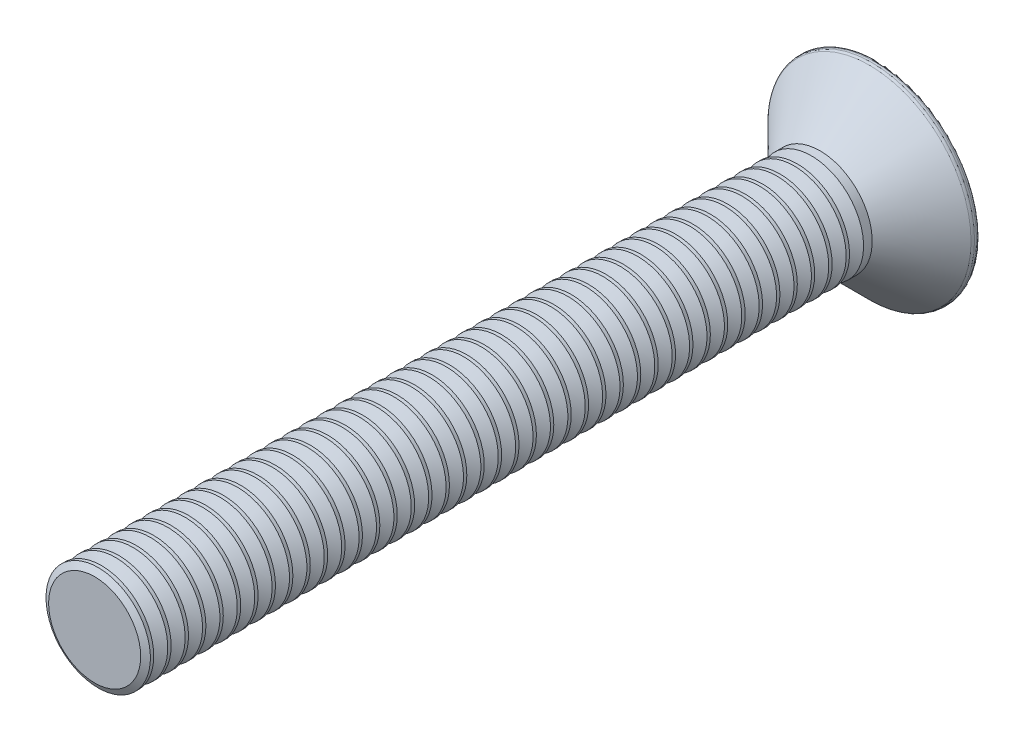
ISO-10303-21;
HEADER;
FILE_DESCRIPTION(('STEP AP214'),'2;1');
FILE_NAME('part.step','',(''),(''),'','','');
FILE_SCHEMA(('AUTOMOTIVE_DESIGN { 1 0 10303 214 1 1 1 1 }'));
ENDSEC;
DATA;
#1=APPLICATION_CONTEXT('core data for automotive mechanical design processes');
#2=APPLICATION_PROTOCOL_DEFINITION('international standard','automotive_design',2000,#1);
#3=PRODUCT_CONTEXT('',#1,'mechanical');
#4=PRODUCT('Part','Part','',(#3));
#5=PRODUCT_RELATED_PRODUCT_CATEGORY('part','',(#4));
#6=PRODUCT_DEFINITION_FORMATION('','',#4);
#7=PRODUCT_DEFINITION_CONTEXT('part definition',#1,'design');
#8=PRODUCT_DEFINITION('design','',#6,#7);
#9=PRODUCT_DEFINITION_SHAPE('','',#8);
#10=(LENGTH_UNIT() NAMED_UNIT(*) SI_UNIT(.MILLI.,.METRE.));
#11=(NAMED_UNIT(*) PLANE_ANGLE_UNIT() SI_UNIT($,.RADIAN.));
#12=(NAMED_UNIT(*) SI_UNIT($,.STERADIAN.) SOLID_ANGLE_UNIT());
#13=UNCERTAINTY_MEASURE_WITH_UNIT(LENGTH_MEASURE(1.E-05),#10,'distance_accuracy_value','');
#14=(GEOMETRIC_REPRESENTATION_CONTEXT(3) GLOBAL_UNCERTAINTY_ASSIGNED_CONTEXT((#13)) GLOBAL_UNIT_ASSIGNED_CONTEXT((#10,
#11,#12)) REPRESENTATION_CONTEXT('',''));
#15=CARTESIAN_POINT('',(0.,0.,0.));
#16=DIRECTION('',(0.,0.,1.));
#17=DIRECTION('',(1.,0.,0.));
#18=AXIS2_PLACEMENT_3D('',#15,#16,#17);
#19=CARTESIAN_POINT('',(0.,0.,45.));
#20=DIRECTION('',(0.,0.,-1.));
#21=DIRECTION('',(-1.,0.,0.));
#22=AXIS2_PLACEMENT_3D('',#19,#20,#21);
#23=CYLINDRICAL_SURFACE('',#22,3.);
#24=CARTESIAN_POINT('',(0.,0.,4.79585481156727));
#25=DIRECTION('',(0.,0.,-1.));
#26=DIRECTION('',(-1.,0.,0.));
#27=AXIS2_PLACEMENT_3D('',#24,#25,#26);
#28=CIRCLE('',#27,3.);
#29=CARTESIAN_POINT('',(-3.,0.,4.79585481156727));
#30=VERTEX_POINT('',#29);
#31=EDGE_CURVE('E333',#30,#30,#28,.F.);
#32=ORIENTED_EDGE('',*,*,#31,.F.);
#33=EDGE_LOOP('',(#32));
#34=FACE_BOUND('',#33,.T.);
#35=CARTESIAN_POINT('',(0.,0.,4.60414518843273));
#36=DIRECTION('',(0.,0.,1.));
#37=DIRECTION('',(1.,0.,0.));
#38=AXIS2_PLACEMENT_3D('',#35,#36,#37);
#39=CIRCLE('',#38,3.);
#40=CARTESIAN_POINT('',(3.,0.,4.60414518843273));
#41=VERTEX_POINT('',#40);
#42=EDGE_CURVE('E323',#41,#41,#39,.F.);
#43=ORIENTED_EDGE('',*,*,#42,.F.);
#44=EDGE_LOOP('',(#43));
#45=FACE_BOUND('',#44,.T.);
#46=ADVANCED_FACE('F17',(#34,#45),#23,.T.);
#47=CARTESIAN_POINT('',(0.,0.,5.79585481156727));
#48=DIRECTION('',(0.,0.,-1.));
#49=DIRECTION('',(-1.,0.,0.));
#50=AXIS2_PLACEMENT_3D('',#47,#48,#49);
#51=CIRCLE('',#50,3.);
#52=CARTESIAN_POINT('',(-3.,0.,5.79585481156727));
#53=VERTEX_POINT('',#52);
#54=EDGE_CURVE('E338',#53,#53,#51,.F.);
#55=ORIENTED_EDGE('',*,*,#54,.F.);
#56=EDGE_LOOP('',(#55));
#57=FACE_BOUND('',#56,.T.);
#58=CARTESIAN_POINT('',(0.,0.,5.60414518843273));
#59=DIRECTION('',(0.,0.,1.));
#60=DIRECTION('',(1.,0.,0.));
#61=AXIS2_PLACEMENT_3D('',#58,#59,#60);
#62=CIRCLE('',#61,3.);
#63=CARTESIAN_POINT('',(3.,0.,5.60414518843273));
#64=VERTEX_POINT('',#63);
#65=EDGE_CURVE('E327',#64,#64,#62,.F.);
#66=ORIENTED_EDGE('',*,*,#65,.F.);
#67=EDGE_LOOP('',(#66));
#68=FACE_BOUND('',#67,.T.);
#69=ADVANCED_FACE('F1359',(#57,#68),#23,.T.);
#70=CARTESIAN_POINT('',(0.,0.,6.79585481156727));
#71=DIRECTION('',(0.,0.,-1.));
#72=DIRECTION('',(-1.,0.,0.));
#73=AXIS2_PLACEMENT_3D('',#70,#71,#72);
#74=CIRCLE('',#73,3.);
#75=CARTESIAN_POINT('',(-3.,0.,6.79585481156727));
#76=VERTEX_POINT('',#75);
#77=EDGE_CURVE('E343',#76,#76,#74,.F.);
#78=ORIENTED_EDGE('',*,*,#77,.F.);
#79=EDGE_LOOP('',(#78));
#80=FACE_BOUND('',#79,.T.);
#81=CARTESIAN_POINT('',(0.,0.,6.60414518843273));
#82=DIRECTION('',(0.,0.,1.));
#83=DIRECTION('',(1.,0.,0.));
#84=AXIS2_PLACEMENT_3D('',#81,#82,#83);
#85=CIRCLE('',#84,3.);
#86=CARTESIAN_POINT('',(3.,0.,6.60414518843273));
#87=VERTEX_POINT('',#86);
#88=EDGE_CURVE('E332',#87,#87,#85,.F.);
#89=ORIENTED_EDGE('',*,*,#88,.F.);
#90=EDGE_LOOP('',(#89));
#91=FACE_BOUND('',#90,.T.);
#92=ADVANCED_FACE('F1365',(#80,#91),#23,.T.);
#93=CARTESIAN_POINT('',(0.,0.,7.79585481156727));
#94=DIRECTION('',(0.,0.,-1.));
#95=DIRECTION('',(-1.,0.,0.));
#96=AXIS2_PLACEMENT_3D('',#93,#94,#95);
#97=CIRCLE('',#96,3.);
#98=CARTESIAN_POINT('',(-3.,0.,7.79585481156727));
#99=VERTEX_POINT('',#98);
#100=EDGE_CURVE('E348',#99,#99,#97,.F.);
#101=ORIENTED_EDGE('',*,*,#100,.F.);
#102=EDGE_LOOP('',(#101));
#103=FACE_BOUND('',#102,.T.);
#104=CARTESIAN_POINT('',(0.,0.,7.60414518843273));
#105=DIRECTION('',(0.,0.,1.));
#106=DIRECTION('',(1.,0.,0.));
#107=AXIS2_PLACEMENT_3D('',#104,#105,#106);
#108=CIRCLE('',#107,3.);
#109=CARTESIAN_POINT('',(3.,0.,7.60414518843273));
#110=VERTEX_POINT('',#109);
#111=EDGE_CURVE('E337',#110,#110,#108,.F.);
#112=ORIENTED_EDGE('',*,*,#111,.F.);
#113=EDGE_LOOP('',(#112));
#114=FACE_BOUND('',#113,.T.);
#115=ADVANCED_FACE('F1764',(#103,#114),#23,.T.);
#116=CARTESIAN_POINT('',(0.,0.,8.79585481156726));
#117=DIRECTION('',(0.,0.,-1.));
#118=DIRECTION('',(-1.,0.,0.));
#119=AXIS2_PLACEMENT_3D('',#116,#117,#118);
#120=CIRCLE('',#119,3.);
#121=CARTESIAN_POINT('',(-3.,0.,8.79585481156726));
#122=VERTEX_POINT('',#121);
#123=EDGE_CURVE('E353',#122,#122,#120,.F.);
#124=ORIENTED_EDGE('',*,*,#123,.F.);
#125=EDGE_LOOP('',(#124));
#126=FACE_BOUND('',#125,.T.);
#127=CARTESIAN_POINT('',(0.,0.,8.60414518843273));
#128=DIRECTION('',(0.,0.,1.));
#129=DIRECTION('',(1.,0.,0.));
#130=AXIS2_PLACEMENT_3D('',#127,#128,#129);
#131=CIRCLE('',#130,3.);
#132=CARTESIAN_POINT('',(3.,0.,8.60414518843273));
#133=VERTEX_POINT('',#132);
#134=EDGE_CURVE('E342',#133,#133,#131,.F.);
#135=ORIENTED_EDGE('',*,*,#134,.F.);
#136=EDGE_LOOP('',(#135));
#137=FACE_BOUND('',#136,.T.);
#138=ADVANCED_FACE('F1753',(#126,#137),#23,.T.);
#139=CARTESIAN_POINT('',(0.,0.,9.79585481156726));
#140=DIRECTION('',(0.,0.,-1.));
#141=DIRECTION('',(-1.,0.,0.));
#142=AXIS2_PLACEMENT_3D('',#139,#140,#141);
#143=CIRCLE('',#142,3.);
#144=CARTESIAN_POINT('',(-3.,0.,9.79585481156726));
#145=VERTEX_POINT('',#144);
#146=EDGE_CURVE('E358',#145,#145,#143,.F.);
#147=ORIENTED_EDGE('',*,*,#146,.F.);
#148=EDGE_LOOP('',(#147));
#149=FACE_BOUND('',#148,.T.);
#150=CARTESIAN_POINT('',(0.,0.,9.60414518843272));
#151=DIRECTION('',(0.,0.,1.));
#152=DIRECTION('',(1.,0.,0.));
#153=AXIS2_PLACEMENT_3D('',#150,#151,#152);
#154=CIRCLE('',#153,3.);
#155=CARTESIAN_POINT('',(3.,0.,9.60414518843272));
#156=VERTEX_POINT('',#155);
#157=EDGE_CURVE('E347',#156,#156,#154,.F.);
#158=ORIENTED_EDGE('',*,*,#157,.F.);
#159=EDGE_LOOP('',(#158));
#160=FACE_BOUND('',#159,.T.);
#161=ADVANCED_FACE('F1742',(#149,#160),#23,.T.);
#162=CARTESIAN_POINT('',(0.,0.,10.7958548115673));
#163=DIRECTION('',(0.,0.,-1.));
#164=DIRECTION('',(-1.,0.,0.));
#165=AXIS2_PLACEMENT_3D('',#162,#163,#164);
#166=CIRCLE('',#165,3.);
#167=CARTESIAN_POINT('',(-3.,0.,10.7958548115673));
#168=VERTEX_POINT('',#167);
#169=EDGE_CURVE('E363',#168,#168,#166,.F.);
#170=ORIENTED_EDGE('',*,*,#169,.F.);
#171=EDGE_LOOP('',(#170));
#172=FACE_BOUND('',#171,.T.);
#173=CARTESIAN_POINT('',(0.,0.,10.6041451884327));
#174=DIRECTION('',(0.,0.,1.));
#175=DIRECTION('',(1.,0.,0.));
#176=AXIS2_PLACEMENT_3D('',#173,#174,#175);
#177=CIRCLE('',#176,3.);
#178=CARTESIAN_POINT('',(3.,0.,10.6041451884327));
#179=VERTEX_POINT('',#178);
#180=EDGE_CURVE('E352',#179,#179,#177,.F.);
#181=ORIENTED_EDGE('',*,*,#180,.F.);
#182=EDGE_LOOP('',(#181));
#183=FACE_BOUND('',#182,.T.);
#184=ADVANCED_FACE('F1731',(#172,#183),#23,.T.);
#185=CARTESIAN_POINT('',(0.,0.,11.7958548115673));
#186=DIRECTION('',(0.,0.,-1.));
#187=DIRECTION('',(-1.,0.,0.));
#188=AXIS2_PLACEMENT_3D('',#185,#186,#187);
#189=CIRCLE('',#188,3.);
#190=CARTESIAN_POINT('',(-3.,0.,11.7958548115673));
#191=VERTEX_POINT('',#190);
#192=EDGE_CURVE('E368',#191,#191,#189,.F.);
#193=ORIENTED_EDGE('',*,*,#192,.F.);
#194=EDGE_LOOP('',(#193));
#195=FACE_BOUND('',#194,.T.);
#196=CARTESIAN_POINT('',(0.,0.,11.6041451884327));
#197=DIRECTION('',(0.,0.,1.));
#198=DIRECTION('',(1.,0.,0.));
#199=AXIS2_PLACEMENT_3D('',#196,#197,#198);
#200=CIRCLE('',#199,3.);
#201=CARTESIAN_POINT('',(3.,0.,11.6041451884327));
#202=VERTEX_POINT('',#201);
#203=EDGE_CURVE('E357',#202,#202,#200,.F.);
#204=ORIENTED_EDGE('',*,*,#203,.F.);
#205=EDGE_LOOP('',(#204));
#206=FACE_BOUND('',#205,.T.);
#207=ADVANCED_FACE('F1720',(#195,#206),#23,.T.);
#208=CARTESIAN_POINT('',(0.,0.,12.7958548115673));
#209=DIRECTION('',(0.,0.,-1.));
#210=DIRECTION('',(-1.,0.,0.));
#211=AXIS2_PLACEMENT_3D('',#208,#209,#210);
#212=CIRCLE('',#211,3.);
#213=CARTESIAN_POINT('',(-3.,0.,12.7958548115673));
#214=VERTEX_POINT('',#213);
#215=EDGE_CURVE('E373',#214,#214,#212,.F.);
#216=ORIENTED_EDGE('',*,*,#215,.F.);
#217=EDGE_LOOP('',(#216));
#218=FACE_BOUND('',#217,.T.);
#219=CARTESIAN_POINT('',(0.,0.,12.6041451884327));
#220=DIRECTION('',(0.,0.,1.));
#221=DIRECTION('',(1.,0.,0.));
#222=AXIS2_PLACEMENT_3D('',#219,#220,#221);
#223=CIRCLE('',#222,3.);
#224=CARTESIAN_POINT('',(3.,0.,12.6041451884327));
#225=VERTEX_POINT('',#224);
#226=EDGE_CURVE('E362',#225,#225,#223,.F.);
#227=ORIENTED_EDGE('',*,*,#226,.F.);
#228=EDGE_LOOP('',(#227));
#229=FACE_BOUND('',#228,.T.);
#230=ADVANCED_FACE('F1709',(#218,#229),#23,.T.);
#231=CARTESIAN_POINT('',(0.,0.,13.7958548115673));
#232=DIRECTION('',(0.,0.,-1.));
#233=DIRECTION('',(-1.,0.,0.));
#234=AXIS2_PLACEMENT_3D('',#231,#232,#233);
#235=CIRCLE('',#234,3.);
#236=CARTESIAN_POINT('',(-3.,0.,13.7958548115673));
#237=VERTEX_POINT('',#236);
#238=EDGE_CURVE('E378',#237,#237,#235,.F.);
#239=ORIENTED_EDGE('',*,*,#238,.F.);
#240=EDGE_LOOP('',(#239));
#241=FACE_BOUND('',#240,.T.);
#242=CARTESIAN_POINT('',(0.,0.,13.6041451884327));
#243=DIRECTION('',(0.,0.,1.));
#244=DIRECTION('',(1.,0.,0.));
#245=AXIS2_PLACEMENT_3D('',#242,#243,#244);
#246=CIRCLE('',#245,3.);
#247=CARTESIAN_POINT('',(3.,0.,13.6041451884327));
#248=VERTEX_POINT('',#247);
#249=EDGE_CURVE('E367',#248,#248,#246,.F.);
#250=ORIENTED_EDGE('',*,*,#249,.F.);
#251=EDGE_LOOP('',(#250));
#252=FACE_BOUND('',#251,.T.);
#253=ADVANCED_FACE('F1698',(#241,#252),#23,.T.);
#254=CARTESIAN_POINT('',(0.,0.,14.7958548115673));
#255=DIRECTION('',(0.,0.,-1.));
#256=DIRECTION('',(-1.,0.,0.));
#257=AXIS2_PLACEMENT_3D('',#254,#255,#256);
#258=CIRCLE('',#257,3.);
#259=CARTESIAN_POINT('',(-3.,0.,14.7958548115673));
#260=VERTEX_POINT('',#259);
#261=EDGE_CURVE('E383',#260,#260,#258,.F.);
#262=ORIENTED_EDGE('',*,*,#261,.F.);
#263=EDGE_LOOP('',(#262));
#264=FACE_BOUND('',#263,.T.);
#265=CARTESIAN_POINT('',(0.,0.,14.6041451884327));
#266=DIRECTION('',(0.,0.,1.));
#267=DIRECTION('',(1.,0.,0.));
#268=AXIS2_PLACEMENT_3D('',#265,#266,#267);
#269=CIRCLE('',#268,3.);
#270=CARTESIAN_POINT('',(3.,0.,14.6041451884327));
#271=VERTEX_POINT('',#270);
#272=EDGE_CURVE('E372',#271,#271,#269,.F.);
#273=ORIENTED_EDGE('',*,*,#272,.F.);
#274=EDGE_LOOP('',(#273));
#275=FACE_BOUND('',#274,.T.);
#276=ADVANCED_FACE('F1687',(#264,#275),#23,.T.);
#277=CARTESIAN_POINT('',(0.,0.,15.7958548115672));
#278=DIRECTION('',(0.,0.,-1.));
#279=DIRECTION('',(-1.,0.,0.));
#280=AXIS2_PLACEMENT_3D('',#277,#278,#279);
#281=CIRCLE('',#280,3.);
#282=CARTESIAN_POINT('',(-3.,0.,15.7958548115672));
#283=VERTEX_POINT('',#282);
#284=EDGE_CURVE('E388',#283,#283,#281,.F.);
#285=ORIENTED_EDGE('',*,*,#284,.F.);
#286=EDGE_LOOP('',(#285));
#287=FACE_BOUND('',#286,.T.);
#288=CARTESIAN_POINT('',(0.,0.,15.6041451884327));
#289=DIRECTION('',(0.,0.,1.));
#290=DIRECTION('',(1.,0.,0.));
#291=AXIS2_PLACEMENT_3D('',#288,#289,#290);
#292=CIRCLE('',#291,3.);
#293=CARTESIAN_POINT('',(3.,0.,15.6041451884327));
#294=VERTEX_POINT('',#293);
#295=EDGE_CURVE('E377',#294,#294,#292,.F.);
#296=ORIENTED_EDGE('',*,*,#295,.F.);
#297=EDGE_LOOP('',(#296));
#298=FACE_BOUND('',#297,.T.);
#299=ADVANCED_FACE('F1676',(#287,#298),#23,.T.);
#300=CARTESIAN_POINT('',(0.,0.,16.7958548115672));
#301=DIRECTION('',(0.,0.,-1.));
#302=DIRECTION('',(-1.,0.,0.));
#303=AXIS2_PLACEMENT_3D('',#300,#301,#302);
#304=CIRCLE('',#303,3.);
#305=CARTESIAN_POINT('',(-3.,0.,16.7958548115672));
#306=VERTEX_POINT('',#305);
#307=EDGE_CURVE('E393',#306,#306,#304,.F.);
#308=ORIENTED_EDGE('',*,*,#307,.F.);
#309=EDGE_LOOP('',(#308));
#310=FACE_BOUND('',#309,.T.);
#311=CARTESIAN_POINT('',(0.,0.,16.6041451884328));
#312=DIRECTION('',(0.,0.,1.));
#313=DIRECTION('',(1.,0.,0.));
#314=AXIS2_PLACEMENT_3D('',#311,#312,#313);
#315=CIRCLE('',#314,3.);
#316=CARTESIAN_POINT('',(3.,0.,16.6041451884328));
#317=VERTEX_POINT('',#316);
#318=EDGE_CURVE('E382',#317,#317,#315,.F.);
#319=ORIENTED_EDGE('',*,*,#318,.F.);
#320=EDGE_LOOP('',(#319));
#321=FACE_BOUND('',#320,.T.);
#322=ADVANCED_FACE('F1665',(#310,#321),#23,.T.);
#323=CARTESIAN_POINT('',(0.,0.,17.7958548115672));
#324=DIRECTION('',(0.,0.,-1.));
#325=DIRECTION('',(-1.,0.,0.));
#326=AXIS2_PLACEMENT_3D('',#323,#324,#325);
#327=CIRCLE('',#326,3.);
#328=CARTESIAN_POINT('',(-3.,0.,17.7958548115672));
#329=VERTEX_POINT('',#328);
#330=EDGE_CURVE('E398',#329,#329,#327,.F.);
#331=ORIENTED_EDGE('',*,*,#330,.F.);
#332=EDGE_LOOP('',(#331));
#333=FACE_BOUND('',#332,.T.);
#334=CARTESIAN_POINT('',(0.,0.,17.6041451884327));
#335=DIRECTION('',(0.,0.,1.));
#336=DIRECTION('',(1.,0.,0.));
#337=AXIS2_PLACEMENT_3D('',#334,#335,#336);
#338=CIRCLE('',#337,3.);
#339=CARTESIAN_POINT('',(3.,0.,17.6041451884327));
#340=VERTEX_POINT('',#339);
#341=EDGE_CURVE('E387',#340,#340,#338,.F.);
#342=ORIENTED_EDGE('',*,*,#341,.F.);
#343=EDGE_LOOP('',(#342));
#344=FACE_BOUND('',#343,.T.);
#345=ADVANCED_FACE('F1654',(#333,#344),#23,.T.);
#346=CARTESIAN_POINT('',(0.,0.,18.7958548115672));
#347=DIRECTION('',(0.,0.,-1.));
#348=DIRECTION('',(-1.,0.,0.));
#349=AXIS2_PLACEMENT_3D('',#346,#347,#348);
#350=CIRCLE('',#349,3.);
#351=CARTESIAN_POINT('',(-3.,0.,18.7958548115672));
#352=VERTEX_POINT('',#351);
#353=EDGE_CURVE('E403',#352,#352,#350,.F.);
#354=ORIENTED_EDGE('',*,*,#353,.F.);
#355=EDGE_LOOP('',(#354));
#356=FACE_BOUND('',#355,.T.);
#357=CARTESIAN_POINT('',(0.,0.,18.6041451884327));
#358=DIRECTION('',(0.,0.,1.));
#359=DIRECTION('',(1.,0.,0.));
#360=AXIS2_PLACEMENT_3D('',#357,#358,#359);
#361=CIRCLE('',#360,3.);
#362=CARTESIAN_POINT('',(3.,0.,18.6041451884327));
#363=VERTEX_POINT('',#362);
#364=EDGE_CURVE('E392',#363,#363,#361,.F.);
#365=ORIENTED_EDGE('',*,*,#364,.F.);
#366=EDGE_LOOP('',(#365));
#367=FACE_BOUND('',#366,.T.);
#368=ADVANCED_FACE('F1643',(#356,#367),#23,.T.);
#369=CARTESIAN_POINT('',(0.,0.,19.7958548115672));
#370=DIRECTION('',(0.,0.,-1.));
#371=DIRECTION('',(-1.,0.,0.));
#372=AXIS2_PLACEMENT_3D('',#369,#370,#371);
#373=CIRCLE('',#372,3.);
#374=CARTESIAN_POINT('',(-3.,0.,19.7958548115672));
#375=VERTEX_POINT('',#374);
#376=EDGE_CURVE('E408',#375,#375,#373,.F.);
#377=ORIENTED_EDGE('',*,*,#376,.F.);
#378=EDGE_LOOP('',(#377));
#379=FACE_BOUND('',#378,.T.);
#380=CARTESIAN_POINT('',(0.,0.,19.6041451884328));
#381=DIRECTION('',(0.,0.,1.));
#382=DIRECTION('',(1.,0.,0.));
#383=AXIS2_PLACEMENT_3D('',#380,#381,#382);
#384=CIRCLE('',#383,3.);
#385=CARTESIAN_POINT('',(3.,0.,19.6041451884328));
#386=VERTEX_POINT('',#385);
#387=EDGE_CURVE('E397',#386,#386,#384,.F.);
#388=ORIENTED_EDGE('',*,*,#387,.F.);
#389=EDGE_LOOP('',(#388));
#390=FACE_BOUND('',#389,.T.);
#391=ADVANCED_FACE('F1632',(#379,#390),#23,.T.);
#392=CARTESIAN_POINT('',(0.,0.,20.7958548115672));
#393=DIRECTION('',(0.,0.,-1.));
#394=DIRECTION('',(-1.,0.,0.));
#395=AXIS2_PLACEMENT_3D('',#392,#393,#394);
#396=CIRCLE('',#395,3.);
#397=CARTESIAN_POINT('',(-3.,0.,20.7958548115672));
#398=VERTEX_POINT('',#397);
#399=EDGE_CURVE('E413',#398,#398,#396,.F.);
#400=ORIENTED_EDGE('',*,*,#399,.F.);
#401=EDGE_LOOP('',(#400));
#402=FACE_BOUND('',#401,.T.);
#403=CARTESIAN_POINT('',(0.,0.,20.6041451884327));
#404=DIRECTION('',(0.,0.,1.));
#405=DIRECTION('',(1.,0.,0.));
#406=AXIS2_PLACEMENT_3D('',#403,#404,#405);
#407=CIRCLE('',#406,3.);
#408=CARTESIAN_POINT('',(3.,0.,20.6041451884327));
#409=VERTEX_POINT('',#408);
#410=EDGE_CURVE('E402',#409,#409,#407,.F.);
#411=ORIENTED_EDGE('',*,*,#410,.F.);
#412=EDGE_LOOP('',(#411));
#413=FACE_BOUND('',#412,.T.);
#414=ADVANCED_FACE('F1621',(#402,#413),#23,.T.);
#415=CARTESIAN_POINT('',(0.,0.,21.7958548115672));
#416=DIRECTION('',(0.,0.,-1.));
#417=DIRECTION('',(-1.,0.,0.));
#418=AXIS2_PLACEMENT_3D('',#415,#416,#417);
#419=CIRCLE('',#418,3.);
#420=CARTESIAN_POINT('',(-3.,0.,21.7958548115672));
#421=VERTEX_POINT('',#420);
#422=EDGE_CURVE('E418',#421,#421,#419,.F.);
#423=ORIENTED_EDGE('',*,*,#422,.F.);
#424=EDGE_LOOP('',(#423));
#425=FACE_BOUND('',#424,.T.);
#426=CARTESIAN_POINT('',(0.,0.,21.6041451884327));
#427=DIRECTION('',(0.,0.,1.));
#428=DIRECTION('',(1.,0.,0.));
#429=AXIS2_PLACEMENT_3D('',#426,#427,#428);
#430=CIRCLE('',#429,3.);
#431=CARTESIAN_POINT('',(3.,0.,21.6041451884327));
#432=VERTEX_POINT('',#431);
#433=EDGE_CURVE('E407',#432,#432,#430,.F.);
#434=ORIENTED_EDGE('',*,*,#433,.F.);
#435=EDGE_LOOP('',(#434));
#436=FACE_BOUND('',#435,.T.);
#437=ADVANCED_FACE('F1610',(#425,#436),#23,.T.);
#438=CARTESIAN_POINT('',(0.,0.,22.7958548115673));
#439=DIRECTION('',(0.,0.,-1.));
#440=DIRECTION('',(-1.,0.,0.));
#441=AXIS2_PLACEMENT_3D('',#438,#439,#440);
#442=CIRCLE('',#441,3.);
#443=CARTESIAN_POINT('',(-3.,0.,22.7958548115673));
#444=VERTEX_POINT('',#443);
#445=EDGE_CURVE('E423',#444,#444,#442,.F.);
#446=ORIENTED_EDGE('',*,*,#445,.F.);
#447=EDGE_LOOP('',(#446));
#448=FACE_BOUND('',#447,.T.);
#449=CARTESIAN_POINT('',(0.,0.,22.6041451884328));
#450=DIRECTION('',(0.,0.,1.));
#451=DIRECTION('',(1.,0.,0.));
#452=AXIS2_PLACEMENT_3D('',#449,#450,#451);
#453=CIRCLE('',#452,3.);
#454=CARTESIAN_POINT('',(3.,0.,22.6041451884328));
#455=VERTEX_POINT('',#454);
#456=EDGE_CURVE('E412',#455,#455,#453,.F.);
#457=ORIENTED_EDGE('',*,*,#456,.F.);
#458=EDGE_LOOP('',(#457));
#459=FACE_BOUND('',#458,.T.);
#460=ADVANCED_FACE('F1599',(#448,#459),#23,.T.);
#461=CARTESIAN_POINT('',(0.,0.,23.7958548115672));
#462=DIRECTION('',(0.,0.,-1.));
#463=DIRECTION('',(-1.,0.,0.));
#464=AXIS2_PLACEMENT_3D('',#461,#462,#463);
#465=CIRCLE('',#464,3.);
#466=CARTESIAN_POINT('',(-3.,0.,23.7958548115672));
#467=VERTEX_POINT('',#466);
#468=EDGE_CURVE('E428',#467,#467,#465,.F.);
#469=ORIENTED_EDGE('',*,*,#468,.F.);
#470=EDGE_LOOP('',(#469));
#471=FACE_BOUND('',#470,.T.);
#472=CARTESIAN_POINT('',(0.,0.,23.6041451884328));
#473=DIRECTION('',(0.,0.,1.));
#474=DIRECTION('',(1.,0.,0.));
#475=AXIS2_PLACEMENT_3D('',#472,#473,#474);
#476=CIRCLE('',#475,3.);
#477=CARTESIAN_POINT('',(3.,0.,23.6041451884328));
#478=VERTEX_POINT('',#477);
#479=EDGE_CURVE('E417',#478,#478,#476,.F.);
#480=ORIENTED_EDGE('',*,*,#479,.F.);
#481=EDGE_LOOP('',(#480));
#482=FACE_BOUND('',#481,.T.);
#483=ADVANCED_FACE('F1588',(#471,#482),#23,.T.);
#484=CARTESIAN_POINT('',(0.,0.,24.7958548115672));
#485=DIRECTION('',(0.,0.,-1.));
#486=DIRECTION('',(-1.,0.,0.));
#487=AXIS2_PLACEMENT_3D('',#484,#485,#486);
#488=CIRCLE('',#487,3.);
#489=CARTESIAN_POINT('',(-3.,0.,24.7958548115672));
#490=VERTEX_POINT('',#489);
#491=EDGE_CURVE('E433',#490,#490,#488,.F.);
#492=ORIENTED_EDGE('',*,*,#491,.F.);
#493=EDGE_LOOP('',(#492));
#494=FACE_BOUND('',#493,.T.);
#495=CARTESIAN_POINT('',(0.,0.,24.6041451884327));
#496=DIRECTION('',(0.,0.,1.));
#497=DIRECTION('',(1.,0.,0.));
#498=AXIS2_PLACEMENT_3D('',#495,#496,#497);
#499=CIRCLE('',#498,3.);
#500=CARTESIAN_POINT('',(3.,0.,24.6041451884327));
#501=VERTEX_POINT('',#500);
#502=EDGE_CURVE('E422',#501,#501,#499,.F.);
#503=ORIENTED_EDGE('',*,*,#502,.F.);
#504=EDGE_LOOP('',(#503));
#505=FACE_BOUND('',#504,.T.);
#506=ADVANCED_FACE('F1577',(#494,#505),#23,.T.);
#507=CARTESIAN_POINT('',(0.,0.,25.7958548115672));
#508=DIRECTION('',(0.,0.,-1.));
#509=DIRECTION('',(-1.,0.,0.));
#510=AXIS2_PLACEMENT_3D('',#507,#508,#509);
#511=CIRCLE('',#510,3.);
#512=CARTESIAN_POINT('',(-3.,0.,25.7958548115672));
#513=VERTEX_POINT('',#512);
#514=EDGE_CURVE('E438',#513,#513,#511,.F.);
#515=ORIENTED_EDGE('',*,*,#514,.F.);
#516=EDGE_LOOP('',(#515));
#517=FACE_BOUND('',#516,.T.);
#518=CARTESIAN_POINT('',(0.,0.,25.6041451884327));
#519=DIRECTION('',(0.,0.,1.));
#520=DIRECTION('',(1.,0.,0.));
#521=AXIS2_PLACEMENT_3D('',#518,#519,#520);
#522=CIRCLE('',#521,3.);
#523=CARTESIAN_POINT('',(3.,0.,25.6041451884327));
#524=VERTEX_POINT('',#523);
#525=EDGE_CURVE('E427',#524,#524,#522,.F.);
#526=ORIENTED_EDGE('',*,*,#525,.F.);
#527=EDGE_LOOP('',(#526));
#528=FACE_BOUND('',#527,.T.);
#529=ADVANCED_FACE('F1566',(#517,#528),#23,.T.);
#530=CARTESIAN_POINT('',(0.,0.,26.7958548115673));
#531=DIRECTION('',(0.,0.,-1.));
#532=DIRECTION('',(-1.,0.,0.));
#533=AXIS2_PLACEMENT_3D('',#530,#531,#532);
#534=CIRCLE('',#533,3.);
#535=CARTESIAN_POINT('',(-3.,0.,26.7958548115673));
#536=VERTEX_POINT('',#535);
#537=EDGE_CURVE('E443',#536,#536,#534,.F.);
#538=ORIENTED_EDGE('',*,*,#537,.F.);
#539=EDGE_LOOP('',(#538));
#540=FACE_BOUND('',#539,.T.);
#541=CARTESIAN_POINT('',(0.,0.,26.6041451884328));
#542=DIRECTION('',(0.,0.,1.));
#543=DIRECTION('',(1.,0.,0.));
#544=AXIS2_PLACEMENT_3D('',#541,#542,#543);
#545=CIRCLE('',#544,3.);
#546=CARTESIAN_POINT('',(3.,0.,26.6041451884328));
#547=VERTEX_POINT('',#546);
#548=EDGE_CURVE('E432',#547,#547,#545,.F.);
#549=ORIENTED_EDGE('',*,*,#548,.F.);
#550=EDGE_LOOP('',(#549));
#551=FACE_BOUND('',#550,.T.);
#552=ADVANCED_FACE('F1555',(#540,#551),#23,.T.);
#553=CARTESIAN_POINT('',(0.,0.,27.7958548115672));
#554=DIRECTION('',(0.,0.,-1.));
#555=DIRECTION('',(-1.,0.,0.));
#556=AXIS2_PLACEMENT_3D('',#553,#554,#555);
#557=CIRCLE('',#556,3.);
#558=CARTESIAN_POINT('',(-3.,0.,27.7958548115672));
#559=VERTEX_POINT('',#558);
#560=EDGE_CURVE('E448',#559,#559,#557,.F.);
#561=ORIENTED_EDGE('',*,*,#560,.F.);
#562=EDGE_LOOP('',(#561));
#563=FACE_BOUND('',#562,.T.);
#564=CARTESIAN_POINT('',(0.,0.,27.6041451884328));
#565=DIRECTION('',(0.,0.,1.));
#566=DIRECTION('',(1.,0.,0.));
#567=AXIS2_PLACEMENT_3D('',#564,#565,#566);
#568=CIRCLE('',#567,3.);
#569=CARTESIAN_POINT('',(3.,0.,27.6041451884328));
#570=VERTEX_POINT('',#569);
#571=EDGE_CURVE('E437',#570,#570,#568,.F.);
#572=ORIENTED_EDGE('',*,*,#571,.F.);
#573=EDGE_LOOP('',(#572));
#574=FACE_BOUND('',#573,.T.);
#575=ADVANCED_FACE('F1544',(#563,#574),#23,.T.);
#576=CARTESIAN_POINT('',(0.,0.,28.7958548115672));
#577=DIRECTION('',(0.,0.,-1.));
#578=DIRECTION('',(-1.,0.,0.));
#579=AXIS2_PLACEMENT_3D('',#576,#577,#578);
#580=CIRCLE('',#579,3.);
#581=CARTESIAN_POINT('',(-3.,0.,28.7958548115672));
#582=VERTEX_POINT('',#581);
#583=EDGE_CURVE('E453',#582,#582,#580,.F.);
#584=ORIENTED_EDGE('',*,*,#583,.F.);
#585=EDGE_LOOP('',(#584));
#586=FACE_BOUND('',#585,.T.);
#587=CARTESIAN_POINT('',(0.,0.,28.6041451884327));
#588=DIRECTION('',(0.,0.,1.));
#589=DIRECTION('',(1.,0.,0.));
#590=AXIS2_PLACEMENT_3D('',#587,#588,#589);
#591=CIRCLE('',#590,3.);
#592=CARTESIAN_POINT('',(3.,0.,28.6041451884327));
#593=VERTEX_POINT('',#592);
#594=EDGE_CURVE('E442',#593,#593,#591,.F.);
#595=ORIENTED_EDGE('',*,*,#594,.F.);
#596=EDGE_LOOP('',(#595));
#597=FACE_BOUND('',#596,.T.);
#598=ADVANCED_FACE('F1533',(#586,#597),#23,.T.);
#599=CARTESIAN_POINT('',(0.,0.,29.7958548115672));
#600=DIRECTION('',(0.,0.,-1.));
#601=DIRECTION('',(-1.,0.,0.));
#602=AXIS2_PLACEMENT_3D('',#599,#600,#601);
#603=CIRCLE('',#602,3.);
#604=CARTESIAN_POINT('',(-3.,0.,29.7958548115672));
#605=VERTEX_POINT('',#604);
#606=EDGE_CURVE('E458',#605,#605,#603,.F.);
#607=ORIENTED_EDGE('',*,*,#606,.F.);
#608=EDGE_LOOP('',(#607));
#609=FACE_BOUND('',#608,.T.);
#610=CARTESIAN_POINT('',(0.,0.,29.6041451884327));
#611=DIRECTION('',(0.,0.,1.));
#612=DIRECTION('',(1.,0.,0.));
#613=AXIS2_PLACEMENT_3D('',#610,#611,#612);
#614=CIRCLE('',#613,3.);
#615=CARTESIAN_POINT('',(3.,0.,29.6041451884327));
#616=VERTEX_POINT('',#615);
#617=EDGE_CURVE('E447',#616,#616,#614,.F.);
#618=ORIENTED_EDGE('',*,*,#617,.F.);
#619=EDGE_LOOP('',(#618));
#620=FACE_BOUND('',#619,.T.);
#621=ADVANCED_FACE('F1522',(#609,#620),#23,.T.);
#622=CARTESIAN_POINT('',(0.,0.,30.7958548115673));
#623=DIRECTION('',(0.,0.,-1.));
#624=DIRECTION('',(-1.,0.,0.));
#625=AXIS2_PLACEMENT_3D('',#622,#623,#624);
#626=CIRCLE('',#625,3.);
#627=CARTESIAN_POINT('',(-3.,0.,30.7958548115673));
#628=VERTEX_POINT('',#627);
#629=EDGE_CURVE('E463',#628,#628,#626,.F.);
#630=ORIENTED_EDGE('',*,*,#629,.F.);
#631=EDGE_LOOP('',(#630));
#632=FACE_BOUND('',#631,.T.);
#633=CARTESIAN_POINT('',(0.,0.,30.6041451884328));
#634=DIRECTION('',(0.,0.,1.));
#635=DIRECTION('',(1.,0.,0.));
#636=AXIS2_PLACEMENT_3D('',#633,#634,#635);
#637=CIRCLE('',#636,3.);
#638=CARTESIAN_POINT('',(3.,0.,30.6041451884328));
#639=VERTEX_POINT('',#638);
#640=EDGE_CURVE('E452',#639,#639,#637,.F.);
#641=ORIENTED_EDGE('',*,*,#640,.F.);
#642=EDGE_LOOP('',(#641));
#643=FACE_BOUND('',#642,.T.);
#644=ADVANCED_FACE('F1511',(#632,#643),#23,.T.);
#645=CARTESIAN_POINT('',(0.,0.,31.7958548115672));
#646=DIRECTION('',(0.,0.,-1.));
#647=DIRECTION('',(-1.,0.,0.));
#648=AXIS2_PLACEMENT_3D('',#645,#646,#647);
#649=CIRCLE('',#648,3.);
#650=CARTESIAN_POINT('',(-3.,0.,31.7958548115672));
#651=VERTEX_POINT('',#650);
#652=EDGE_CURVE('E468',#651,#651,#649,.F.);
#653=ORIENTED_EDGE('',*,*,#652,.F.);
#654=EDGE_LOOP('',(#653));
#655=FACE_BOUND('',#654,.T.);
#656=CARTESIAN_POINT('',(0.,0.,31.6041451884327));
#657=DIRECTION('',(0.,0.,1.));
#658=DIRECTION('',(1.,0.,0.));
#659=AXIS2_PLACEMENT_3D('',#656,#657,#658);
#660=CIRCLE('',#659,3.);
#661=CARTESIAN_POINT('',(3.,0.,31.6041451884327));
#662=VERTEX_POINT('',#661);
#663=EDGE_CURVE('E457',#662,#662,#660,.F.);
#664=ORIENTED_EDGE('',*,*,#663,.F.);
#665=EDGE_LOOP('',(#664));
#666=FACE_BOUND('',#665,.T.);
#667=ADVANCED_FACE('F1500',(#655,#666),#23,.T.);
#668=CARTESIAN_POINT('',(0.,0.,32.7958548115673));
#669=DIRECTION('',(0.,0.,-1.));
#670=DIRECTION('',(-1.,0.,0.));
#671=AXIS2_PLACEMENT_3D('',#668,#669,#670);
#672=CIRCLE('',#671,3.);
#673=CARTESIAN_POINT('',(-3.,0.,32.7958548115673));
#674=VERTEX_POINT('',#673);
#675=EDGE_CURVE('E473',#674,#674,#672,.F.);
#676=ORIENTED_EDGE('',*,*,#675,.F.);
#677=EDGE_LOOP('',(#676));
#678=FACE_BOUND('',#677,.T.);
#679=CARTESIAN_POINT('',(0.,0.,32.6041451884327));
#680=DIRECTION('',(0.,0.,1.));
#681=DIRECTION('',(1.,0.,0.));
#682=AXIS2_PLACEMENT_3D('',#679,#680,#681);
#683=CIRCLE('',#682,3.);
#684=CARTESIAN_POINT('',(3.,0.,32.6041451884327));
#685=VERTEX_POINT('',#684);
#686=EDGE_CURVE('E462',#685,#685,#683,.F.);
#687=ORIENTED_EDGE('',*,*,#686,.F.);
#688=EDGE_LOOP('',(#687));
#689=FACE_BOUND('',#688,.T.);
#690=ADVANCED_FACE('F1489',(#678,#689),#23,.T.);
#691=CARTESIAN_POINT('',(0.,0.,33.7958548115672));
#692=DIRECTION('',(0.,0.,-1.));
#693=DIRECTION('',(-1.,0.,0.));
#694=AXIS2_PLACEMENT_3D('',#691,#692,#693);
#695=CIRCLE('',#694,3.);
#696=CARTESIAN_POINT('',(-3.,0.,33.7958548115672));
#697=VERTEX_POINT('',#696);
#698=EDGE_CURVE('E478',#697,#697,#695,.F.);
#699=ORIENTED_EDGE('',*,*,#698,.F.);
#700=EDGE_LOOP('',(#699));
#701=FACE_BOUND('',#700,.T.);
#702=CARTESIAN_POINT('',(0.,0.,33.6041451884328));
#703=DIRECTION('',(0.,0.,1.));
#704=DIRECTION('',(1.,0.,0.));
#705=AXIS2_PLACEMENT_3D('',#702,#703,#704);
#706=CIRCLE('',#705,3.);
#707=CARTESIAN_POINT('',(3.,0.,33.6041451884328));
#708=VERTEX_POINT('',#707);
#709=EDGE_CURVE('E467',#708,#708,#706,.F.);
#710=ORIENTED_EDGE('',*,*,#709,.F.);
#711=EDGE_LOOP('',(#710));
#712=FACE_BOUND('',#711,.T.);
#713=ADVANCED_FACE('F1478',(#701,#712),#23,.T.);
#714=CARTESIAN_POINT('',(0.,0.,34.7958548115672));
#715=DIRECTION('',(0.,0.,-1.));
#716=DIRECTION('',(-1.,0.,0.));
#717=AXIS2_PLACEMENT_3D('',#714,#715,#716);
#718=CIRCLE('',#717,3.);
#719=CARTESIAN_POINT('',(-3.,0.,34.7958548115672));
#720=VERTEX_POINT('',#719);
#721=EDGE_CURVE('E483',#720,#720,#718,.F.);
#722=ORIENTED_EDGE('',*,*,#721,.F.);
#723=EDGE_LOOP('',(#722));
#724=FACE_BOUND('',#723,.T.);
#725=CARTESIAN_POINT('',(0.,0.,34.6041451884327));
#726=DIRECTION('',(0.,0.,1.));
#727=DIRECTION('',(1.,0.,0.));
#728=AXIS2_PLACEMENT_3D('',#725,#726,#727);
#729=CIRCLE('',#728,3.);
#730=CARTESIAN_POINT('',(3.,0.,34.6041451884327));
#731=VERTEX_POINT('',#730);
#732=EDGE_CURVE('E472',#731,#731,#729,.F.);
#733=ORIENTED_EDGE('',*,*,#732,.F.);
#734=EDGE_LOOP('',(#733));
#735=FACE_BOUND('',#734,.T.);
#736=ADVANCED_FACE('F1467',(#724,#735),#23,.T.);
#737=CARTESIAN_POINT('',(0.,0.,35.7958548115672));
#738=DIRECTION('',(0.,0.,-1.));
#739=DIRECTION('',(-1.,0.,0.));
#740=AXIS2_PLACEMENT_3D('',#737,#738,#739);
#741=CIRCLE('',#740,3.);
#742=CARTESIAN_POINT('',(-3.,0.,35.7958548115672));
#743=VERTEX_POINT('',#742);
#744=EDGE_CURVE('E488',#743,#743,#741,.F.);
#745=ORIENTED_EDGE('',*,*,#744,.F.);
#746=EDGE_LOOP('',(#745));
#747=FACE_BOUND('',#746,.T.);
#748=CARTESIAN_POINT('',(0.,0.,35.6041451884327));
#749=DIRECTION('',(0.,0.,1.));
#750=DIRECTION('',(1.,0.,0.));
#751=AXIS2_PLACEMENT_3D('',#748,#749,#750);
#752=CIRCLE('',#751,3.);
#753=CARTESIAN_POINT('',(3.,0.,35.6041451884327));
#754=VERTEX_POINT('',#753);
#755=EDGE_CURVE('E477',#754,#754,#752,.F.);
#756=ORIENTED_EDGE('',*,*,#755,.F.);
#757=EDGE_LOOP('',(#756));
#758=FACE_BOUND('',#757,.T.);
#759=ADVANCED_FACE('F1456',(#747,#758),#23,.T.);
#760=CARTESIAN_POINT('',(0.,0.,36.7958548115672));
#761=DIRECTION('',(0.,0.,-1.));
#762=DIRECTION('',(-1.,0.,0.));
#763=AXIS2_PLACEMENT_3D('',#760,#761,#762);
#764=CIRCLE('',#763,3.);
#765=CARTESIAN_POINT('',(-3.,0.,36.7958548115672));
#766=VERTEX_POINT('',#765);
#767=EDGE_CURVE('E493',#766,#766,#764,.F.);
#768=ORIENTED_EDGE('',*,*,#767,.F.);
#769=EDGE_LOOP('',(#768));
#770=FACE_BOUND('',#769,.T.);
#771=CARTESIAN_POINT('',(0.,0.,36.6041451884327));
#772=DIRECTION('',(0.,0.,1.));
#773=DIRECTION('',(1.,0.,0.));
#774=AXIS2_PLACEMENT_3D('',#771,#772,#773);
#775=CIRCLE('',#774,3.);
#776=CARTESIAN_POINT('',(3.,0.,36.6041451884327));
#777=VERTEX_POINT('',#776);
#778=EDGE_CURVE('E482',#777,#777,#775,.F.);
#779=ORIENTED_EDGE('',*,*,#778,.F.);
#780=EDGE_LOOP('',(#779));
#781=FACE_BOUND('',#780,.T.);
#782=ADVANCED_FACE('F1445',(#770,#781),#23,.T.);
#783=CARTESIAN_POINT('',(0.,0.,37.7958548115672));
#784=DIRECTION('',(0.,0.,-1.));
#785=DIRECTION('',(-1.,0.,0.));
#786=AXIS2_PLACEMENT_3D('',#783,#784,#785);
#787=CIRCLE('',#786,3.);
#788=CARTESIAN_POINT('',(-3.,0.,37.7958548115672));
#789=VERTEX_POINT('',#788);
#790=EDGE_CURVE('E498',#789,#789,#787,.F.);
#791=ORIENTED_EDGE('',*,*,#790,.F.);
#792=EDGE_LOOP('',(#791));
#793=FACE_BOUND('',#792,.T.);
#794=CARTESIAN_POINT('',(0.,0.,37.6041451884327));
#795=DIRECTION('',(0.,0.,1.));
#796=DIRECTION('',(1.,0.,0.));
#797=AXIS2_PLACEMENT_3D('',#794,#795,#796);
#798=CIRCLE('',#797,3.);
#799=CARTESIAN_POINT('',(3.,0.,37.6041451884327));
#800=VERTEX_POINT('',#799);
#801=EDGE_CURVE('E487',#800,#800,#798,.F.);
#802=ORIENTED_EDGE('',*,*,#801,.F.);
#803=EDGE_LOOP('',(#802));
#804=FACE_BOUND('',#803,.T.);
#805=ADVANCED_FACE('F1434',(#793,#804),#23,.T.);
#806=CARTESIAN_POINT('',(0.,0.,38.7958548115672));
#807=DIRECTION('',(0.,0.,-1.));
#808=DIRECTION('',(-1.,0.,0.));
#809=AXIS2_PLACEMENT_3D('',#806,#807,#808);
#810=CIRCLE('',#809,3.);
#811=CARTESIAN_POINT('',(-3.,0.,38.7958548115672));
#812=VERTEX_POINT('',#811);
#813=EDGE_CURVE('E503',#812,#812,#810,.F.);
#814=ORIENTED_EDGE('',*,*,#813,.F.);
#815=EDGE_LOOP('',(#814));
#816=FACE_BOUND('',#815,.T.);
#817=CARTESIAN_POINT('',(0.,0.,38.6041451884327));
#818=DIRECTION('',(0.,0.,1.));
#819=DIRECTION('',(1.,0.,0.));
#820=AXIS2_PLACEMENT_3D('',#817,#818,#819);
#821=CIRCLE('',#820,3.);
#822=CARTESIAN_POINT('',(3.,0.,38.6041451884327));
#823=VERTEX_POINT('',#822);
#824=EDGE_CURVE('E492',#823,#823,#821,.F.);
#825=ORIENTED_EDGE('',*,*,#824,.F.);
#826=EDGE_LOOP('',(#825));
#827=FACE_BOUND('',#826,.T.);
#828=ADVANCED_FACE('F1423',(#816,#827),#23,.T.);
#829=CARTESIAN_POINT('',(0.,0.,39.7958548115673));
#830=DIRECTION('',(0.,0.,-1.));
#831=DIRECTION('',(-1.,0.,0.));
#832=AXIS2_PLACEMENT_3D('',#829,#830,#831);
#833=CIRCLE('',#832,3.);
#834=CARTESIAN_POINT('',(-3.,0.,39.7958548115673));
#835=VERTEX_POINT('',#834);
#836=EDGE_CURVE('E508',#835,#835,#833,.F.);
#837=ORIENTED_EDGE('',*,*,#836,.F.);
#838=EDGE_LOOP('',(#837));
#839=FACE_BOUND('',#838,.T.);
#840=CARTESIAN_POINT('',(0.,0.,39.6041451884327));
#841=DIRECTION('',(0.,0.,1.));
#842=DIRECTION('',(1.,0.,0.));
#843=AXIS2_PLACEMENT_3D('',#840,#841,#842);
#844=CIRCLE('',#843,3.);
#845=CARTESIAN_POINT('',(3.,0.,39.6041451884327));
#846=VERTEX_POINT('',#845);
#847=EDGE_CURVE('E497',#846,#846,#844,.F.);
#848=ORIENTED_EDGE('',*,*,#847,.F.);
#849=EDGE_LOOP('',(#848));
#850=FACE_BOUND('',#849,.T.);
#851=ADVANCED_FACE('F1412',(#839,#850),#23,.T.);
#852=CARTESIAN_POINT('',(0.,0.,40.7958548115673));
#853=DIRECTION('',(0.,0.,-1.));
#854=DIRECTION('',(-1.,0.,0.));
#855=AXIS2_PLACEMENT_3D('',#852,#853,#854);
#856=CIRCLE('',#855,3.);
#857=CARTESIAN_POINT('',(-3.,0.,40.7958548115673));
#858=VERTEX_POINT('',#857);
#859=EDGE_CURVE('E513',#858,#858,#856,.F.);
#860=ORIENTED_EDGE('',*,*,#859,.F.);
#861=EDGE_LOOP('',(#860));
#862=FACE_BOUND('',#861,.T.);
#863=CARTESIAN_POINT('',(0.,0.,40.6041451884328));
#864=DIRECTION('',(0.,0.,1.));
#865=DIRECTION('',(1.,0.,0.));
#866=AXIS2_PLACEMENT_3D('',#863,#864,#865);
#867=CIRCLE('',#866,3.);
#868=CARTESIAN_POINT('',(3.,0.,40.6041451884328));
#869=VERTEX_POINT('',#868);
#870=EDGE_CURVE('E502',#869,#869,#867,.F.);
#871=ORIENTED_EDGE('',*,*,#870,.F.);
#872=EDGE_LOOP('',(#871));
#873=FACE_BOUND('',#872,.T.);
#874=ADVANCED_FACE('F1401',(#862,#873),#23,.T.);
#875=CARTESIAN_POINT('',(0.,0.,41.7958548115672));
#876=DIRECTION('',(0.,0.,-1.));
#877=DIRECTION('',(-1.,0.,0.));
#878=AXIS2_PLACEMENT_3D('',#875,#876,#877);
#879=CIRCLE('',#878,3.);
#880=CARTESIAN_POINT('',(-3.,0.,41.7958548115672));
#881=VERTEX_POINT('',#880);
#882=EDGE_CURVE('E518',#881,#881,#879,.F.);
#883=ORIENTED_EDGE('',*,*,#882,.F.);
#884=EDGE_LOOP('',(#883));
#885=FACE_BOUND('',#884,.T.);
#886=CARTESIAN_POINT('',(0.,0.,41.6041451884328));
#887=DIRECTION('',(0.,0.,1.));
#888=DIRECTION('',(1.,0.,0.));
#889=AXIS2_PLACEMENT_3D('',#886,#887,#888);
#890=CIRCLE('',#889,3.);
#891=CARTESIAN_POINT('',(3.,0.,41.6041451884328));
#892=VERTEX_POINT('',#891);
#893=EDGE_CURVE('E507',#892,#892,#890,.F.);
#894=ORIENTED_EDGE('',*,*,#893,.F.);
#895=EDGE_LOOP('',(#894));
#896=FACE_BOUND('',#895,.T.);
#897=ADVANCED_FACE('F1390',(#885,#896),#23,.T.);
#898=CARTESIAN_POINT('',(0.,0.,42.7958548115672));
#899=DIRECTION('',(0.,0.,-1.));
#900=DIRECTION('',(-1.,0.,0.));
#901=AXIS2_PLACEMENT_3D('',#898,#899,#900);
#902=CIRCLE('',#901,3.);
#903=CARTESIAN_POINT('',(-3.,0.,42.7958548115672));
#904=VERTEX_POINT('',#903);
#905=EDGE_CURVE('E523',#904,#904,#902,.F.);
#906=ORIENTED_EDGE('',*,*,#905,.F.);
#907=EDGE_LOOP('',(#906));
#908=FACE_BOUND('',#907,.T.);
#909=CARTESIAN_POINT('',(0.,0.,42.6041451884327));
#910=DIRECTION('',(0.,0.,1.));
#911=DIRECTION('',(1.,0.,0.));
#912=AXIS2_PLACEMENT_3D('',#909,#910,#911);
#913=CIRCLE('',#912,3.);
#914=CARTESIAN_POINT('',(3.,0.,42.6041451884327));
#915=VERTEX_POINT('',#914);
#916=EDGE_CURVE('E512',#915,#915,#913,.F.);
#917=ORIENTED_EDGE('',*,*,#916,.F.);
#918=EDGE_LOOP('',(#917));
#919=FACE_BOUND('',#918,.T.);
#920=ADVANCED_FACE('F1384',(#908,#919),#23,.T.);
#921=CARTESIAN_POINT('',(0.,0.,43.7958548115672));
#922=DIRECTION('',(0.,0.,-1.));
#923=DIRECTION('',(-1.,0.,0.));
#924=AXIS2_PLACEMENT_3D('',#921,#922,#923);
#925=CIRCLE('',#924,3.);
#926=CARTESIAN_POINT('',(-3.,0.,43.7958548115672));
#927=VERTEX_POINT('',#926);
#928=EDGE_CURVE('E534',#927,#927,#925,.F.);
#929=ORIENTED_EDGE('',*,*,#928,.F.);
#930=EDGE_LOOP('',(#929));
#931=FACE_BOUND('',#930,.T.);
#932=CARTESIAN_POINT('',(0.,0.,43.6041451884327));
#933=DIRECTION('',(0.,0.,1.));
#934=DIRECTION('',(1.,0.,0.));
#935=AXIS2_PLACEMENT_3D('',#932,#933,#934);
#936=CIRCLE('',#935,3.);
#937=CARTESIAN_POINT('',(3.,0.,43.6041451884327));
#938=VERTEX_POINT('',#937);
#939=EDGE_CURVE('E517',#938,#938,#936,.F.);
#940=ORIENTED_EDGE('',*,*,#939,.F.);
#941=EDGE_LOOP('',(#940));
#942=FACE_BOUND('',#941,.T.);
#943=ADVANCED_FACE('F1336',(#931,#942),#23,.T.);
#944=CARTESIAN_POINT('',(0.,0.,43.6226497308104));
#945=DIRECTION('',(0.,0.,-1.));
#946=DIRECTION('',(-1.,0.,0.));
#947=AXIS2_PLACEMENT_3D('',#944,#945,#946);
#948=CONICAL_SURFACE('',#947,3.3,1.0471975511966);
#949=CARTESIAN_POINT('',(0.,0.,44.2));
#950=DIRECTION('',(0.,0.,-1.));
#951=DIRECTION('',(-1.,0.,0.));
#952=AXIS2_PLACEMENT_3D('',#949,#950,#951);
#953=CIRCLE('',#952,2.3);
#954=CARTESIAN_POINT('',(-2.3,0.,44.2));
#955=VERTEX_POINT('',#954);
#956=EDGE_CURVE('E519',#955,#955,#953,.T.);
#957=ORIENTED_EDGE('',*,*,#956,.T.);
#958=EDGE_LOOP('',(#957));
#959=FACE_BOUND('',#958,.T.);
#960=ORIENTED_EDGE('',*,*,#928,.T.);
#961=EDGE_LOOP('',(#960));
#962=FACE_BOUND('',#961,.T.);
#963=ADVANCED_FACE('F1332',(#959,#962),#948,.T.);
#964=CARTESIAN_POINT('',(0.,0.,44.2));
#965=DIRECTION('',(0.,0.,1.));
#966=DIRECTION('',(1.,0.,0.));
#967=AXIS2_PLACEMENT_3D('',#964,#965,#966);
#968=CONICAL_SURFACE('',#967,2.3,1.0471975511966);
#969=ORIENTED_EDGE('',*,*,#956,.F.);
#970=EDGE_LOOP('',(#969));
#971=FACE_BOUND('',#970,.T.);
#972=CARTESIAN_POINT('',(0.,0.,44.6041451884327));
#973=DIRECTION('',(0.,0.,1.));
#974=DIRECTION('',(1.,0.,0.));
#975=AXIS2_PLACEMENT_3D('',#972,#973,#974);
#976=CIRCLE('',#975,3.);
#977=CARTESIAN_POINT('',(3.,0.,44.6041451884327));
#978=VERTEX_POINT('',#977);
#979=EDGE_CURVE('E522',#978,#978,#976,.F.);
#980=ORIENTED_EDGE('',*,*,#979,.T.);
#981=EDGE_LOOP('',(#980));
#982=FACE_BOUND('',#981,.T.);
#983=ADVANCED_FACE('F1328',(#971,#982),#968,.T.);
#984=CARTESIAN_POINT('',(0.,0.,45.));
#985=DIRECTION('',(0.,0.,1.));
#986=DIRECTION('',(1.,0.,0.));
#987=AXIS2_PLACEMENT_3D('',#984,#985,#986);
#988=PLANE('',#987);
#989=CARTESIAN_POINT('',(0.,0.,45.));
#990=DIRECTION('',(0.,0.,1.));
#991=DIRECTION('',(1.,0.,0.));
#992=AXIS2_PLACEMENT_3D('',#989,#990,#991);
#993=CIRCLE('',#992,2.64641016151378);
#994=CARTESIAN_POINT('',(2.64641016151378,0.,45.));
#995=VERTEX_POINT('',#994);
#996=EDGE_CURVE('E528',#995,#995,#993,.T.);
#997=ORIENTED_EDGE('',*,*,#996,.T.);
#998=EDGE_LOOP('',(#997));
#999=FACE_BOUND('',#998,.T.);
#1000=ADVANCED_FACE('F1331',(#999),#988,.T.);
#1001=CARTESIAN_POINT('',(0.,0.,44.6226497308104));
#1002=DIRECTION('',(0.,0.,-1.));
#1003=DIRECTION('',(-1.,0.,0.));
#1004=AXIS2_PLACEMENT_3D('',#1001,#1002,#1003);
#1005=CONICAL_SURFACE('',#1004,3.3,1.0471975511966);
#1006=ORIENTED_EDGE('',*,*,#996,.F.);
#1007=EDGE_LOOP('',(#1006));
#1008=FACE_BOUND('',#1007,.T.);
#1009=CARTESIAN_POINT('',(0.,0.,44.7958548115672));
#1010=DIRECTION('',(0.,0.,-1.));
#1011=DIRECTION('',(-1.,0.,0.));
#1012=AXIS2_PLACEMENT_3D('',#1009,#1010,#1011);
#1013=CIRCLE('',#1012,3.);
#1014=CARTESIAN_POINT('',(-3.,0.,44.7958548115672));
#1015=VERTEX_POINT('',#1014);
#1016=EDGE_CURVE('E524',#1015,#1015,#1013,.F.);
#1017=ORIENTED_EDGE('',*,*,#1016,.T.);
#1018=EDGE_LOOP('',(#1017));
#1019=FACE_BOUND('',#1018,.T.);
#1020=ADVANCED_FACE('F1338',(#1008,#1019),#1005,.T.);
#1021=ORIENTED_EDGE('',*,*,#1016,.F.);
#1022=EDGE_LOOP('',(#1021));
#1023=FACE_BOUND('',#1022,.T.);
#1024=ORIENTED_EDGE('',*,*,#979,.F.);
#1025=EDGE_LOOP('',(#1024));
#1026=FACE_BOUND('',#1025,.T.);
#1027=ADVANCED_FACE('F1326',(#1023,#1026),#23,.T.);
#1028=CARTESIAN_POINT('',(0.,0.,42.6226497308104));
#1029=DIRECTION('',(0.,0.,-1.));
#1030=DIRECTION('',(-1.,0.,0.));
#1031=AXIS2_PLACEMENT_3D('',#1028,#1029,#1030);
#1032=CONICAL_SURFACE('',#1031,3.3,1.0471975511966);
#1033=CARTESIAN_POINT('',(0.,0.,43.2));
#1034=DIRECTION('',(0.,0.,-1.));
#1035=DIRECTION('',(-1.,0.,0.));
#1036=AXIS2_PLACEMENT_3D('',#1033,#1034,#1035);
#1037=CIRCLE('',#1036,2.3);
#1038=CARTESIAN_POINT('',(-2.3,0.,43.2));
#1039=VERTEX_POINT('',#1038);
#1040=EDGE_CURVE('E514',#1039,#1039,#1037,.T.);
#1041=ORIENTED_EDGE('',*,*,#1040,.T.);
#1042=EDGE_LOOP('',(#1041));
#1043=FACE_BOUND('',#1042,.T.);
#1044=ORIENTED_EDGE('',*,*,#905,.T.);
#1045=EDGE_LOOP('',(#1044));
#1046=FACE_BOUND('',#1045,.T.);
#1047=ADVANCED_FACE('F1322',(#1043,#1046),#1032,.T.);
#1048=CARTESIAN_POINT('',(0.,0.,43.2));
#1049=DIRECTION('',(0.,0.,1.));
#1050=DIRECTION('',(1.,0.,0.));
#1051=AXIS2_PLACEMENT_3D('',#1048,#1049,#1050);
#1052=CONICAL_SURFACE('',#1051,2.3,1.0471975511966);
#1053=ORIENTED_EDGE('',*,*,#1040,.F.);
#1054=EDGE_LOOP('',(#1053));
#1055=FACE_BOUND('',#1054,.T.);
#1056=ORIENTED_EDGE('',*,*,#939,.T.);
#1057=EDGE_LOOP('',(#1056));
#1058=FACE_BOUND('',#1057,.T.);
#1059=ADVANCED_FACE('F1318',(#1055,#1058),#1052,.T.);
#1060=CARTESIAN_POINT('',(0.,0.,41.6226497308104));
#1061=DIRECTION('',(0.,0.,-1.));
#1062=DIRECTION('',(-1.,0.,0.));
#1063=AXIS2_PLACEMENT_3D('',#1060,#1061,#1062);
#1064=CONICAL_SURFACE('',#1063,3.3,1.0471975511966);
#1065=CARTESIAN_POINT('',(0.,0.,42.2));
#1066=DIRECTION('',(0.,0.,-1.));
#1067=DIRECTION('',(-1.,0.,0.));
#1068=AXIS2_PLACEMENT_3D('',#1065,#1066,#1067);
#1069=CIRCLE('',#1068,2.3);
#1070=CARTESIAN_POINT('',(-2.3,0.,42.2));
#1071=VERTEX_POINT('',#1070);
#1072=EDGE_CURVE('E509',#1071,#1071,#1069,.T.);
#1073=ORIENTED_EDGE('',*,*,#1072,.T.);
#1074=EDGE_LOOP('',(#1073));
#1075=FACE_BOUND('',#1074,.T.);
#1076=ORIENTED_EDGE('',*,*,#882,.T.);
#1077=EDGE_LOOP('',(#1076));
#1078=FACE_BOUND('',#1077,.T.);
#1079=ADVANCED_FACE('F1314',(#1075,#1078),#1064,.T.);
#1080=CARTESIAN_POINT('',(0.,0.,42.2));
#1081=DIRECTION('',(0.,0.,1.));
#1082=DIRECTION('',(1.,0.,0.));
#1083=AXIS2_PLACEMENT_3D('',#1080,#1081,#1082);
#1084=CONICAL_SURFACE('',#1083,2.3,1.0471975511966);
#1085=ORIENTED_EDGE('',*,*,#1072,.F.);
#1086=EDGE_LOOP('',(#1085));
#1087=FACE_BOUND('',#1086,.T.);
#1088=ORIENTED_EDGE('',*,*,#916,.T.);
#1089=EDGE_LOOP('',(#1088));
#1090=FACE_BOUND('',#1089,.T.);
#1091=ADVANCED_FACE('F1310',(#1087,#1090),#1084,.T.);
#1092=CARTESIAN_POINT('',(0.,0.,40.6226497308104));
#1093=DIRECTION('',(0.,0.,-1.));
#1094=DIRECTION('',(-1.,0.,0.));
#1095=AXIS2_PLACEMENT_3D('',#1092,#1093,#1094);
#1096=CONICAL_SURFACE('',#1095,3.3,1.0471975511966);
#1097=CARTESIAN_POINT('',(0.,0.,41.2));
#1098=DIRECTION('',(0.,0.,-1.));
#1099=DIRECTION('',(-1.,0.,0.));
#1100=AXIS2_PLACEMENT_3D('',#1097,#1098,#1099);
#1101=CIRCLE('',#1100,2.3);
#1102=CARTESIAN_POINT('',(-2.3,0.,41.2));
#1103=VERTEX_POINT('',#1102);
#1104=EDGE_CURVE('E504',#1103,#1103,#1101,.T.);
#1105=ORIENTED_EDGE('',*,*,#1104,.T.);
#1106=EDGE_LOOP('',(#1105));
#1107=FACE_BOUND('',#1106,.T.);
#1108=ORIENTED_EDGE('',*,*,#859,.T.);
#1109=EDGE_LOOP('',(#1108));
#1110=FACE_BOUND('',#1109,.T.);
#1111=ADVANCED_FACE('F1306',(#1107,#1110),#1096,.T.);
#1112=CARTESIAN_POINT('',(0.,0.,41.2));
#1113=DIRECTION('',(0.,0.,1.));
#1114=DIRECTION('',(1.,0.,0.));
#1115=AXIS2_PLACEMENT_3D('',#1112,#1113,#1114);
#1116=CONICAL_SURFACE('',#1115,2.3,1.0471975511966);
#1117=ORIENTED_EDGE('',*,*,#1104,.F.);
#1118=EDGE_LOOP('',(#1117));
#1119=FACE_BOUND('',#1118,.T.);
#1120=ORIENTED_EDGE('',*,*,#893,.T.);
#1121=EDGE_LOOP('',(#1120));
#1122=FACE_BOUND('',#1121,.T.);
#1123=ADVANCED_FACE('F1302',(#1119,#1122),#1116,.T.);
#1124=CARTESIAN_POINT('',(0.,0.,39.6226497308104));
#1125=DIRECTION('',(0.,0.,-1.));
#1126=DIRECTION('',(-1.,0.,0.));
#1127=AXIS2_PLACEMENT_3D('',#1124,#1125,#1126);
#1128=CONICAL_SURFACE('',#1127,3.3,1.0471975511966);
#1129=CARTESIAN_POINT('',(0.,0.,40.2));
#1130=DIRECTION('',(0.,0.,-1.));
#1131=DIRECTION('',(-1.,0.,0.));
#1132=AXIS2_PLACEMENT_3D('',#1129,#1130,#1131);
#1133=CIRCLE('',#1132,2.3);
#1134=CARTESIAN_POINT('',(-2.3,0.,40.2));
#1135=VERTEX_POINT('',#1134);
#1136=EDGE_CURVE('E499',#1135,#1135,#1133,.T.);
#1137=ORIENTED_EDGE('',*,*,#1136,.T.);
#1138=EDGE_LOOP('',(#1137));
#1139=FACE_BOUND('',#1138,.T.);
#1140=ORIENTED_EDGE('',*,*,#836,.T.);
#1141=EDGE_LOOP('',(#1140));
#1142=FACE_BOUND('',#1141,.T.);
#1143=ADVANCED_FACE('F1298',(#1139,#1142),#1128,.T.);
#1144=CARTESIAN_POINT('',(0.,0.,40.2));
#1145=DIRECTION('',(0.,0.,1.));
#1146=DIRECTION('',(1.,0.,0.));
#1147=AXIS2_PLACEMENT_3D('',#1144,#1145,#1146);
#1148=CONICAL_SURFACE('',#1147,2.3,1.0471975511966);
#1149=ORIENTED_EDGE('',*,*,#1136,.F.);
#1150=EDGE_LOOP('',(#1149));
#1151=FACE_BOUND('',#1150,.T.);
#1152=ORIENTED_EDGE('',*,*,#870,.T.);
#1153=EDGE_LOOP('',(#1152));
#1154=FACE_BOUND('',#1153,.T.);
#1155=ADVANCED_FACE('F1294',(#1151,#1154),#1148,.T.);
#1156=CARTESIAN_POINT('',(0.,0.,38.6226497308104));
#1157=DIRECTION('',(0.,0.,-1.));
#1158=DIRECTION('',(-1.,0.,0.));
#1159=AXIS2_PLACEMENT_3D('',#1156,#1157,#1158);
#1160=CONICAL_SURFACE('',#1159,3.3,1.0471975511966);
#1161=CARTESIAN_POINT('',(0.,0.,39.2));
#1162=DIRECTION('',(0.,0.,-1.));
#1163=DIRECTION('',(-1.,0.,0.));
#1164=AXIS2_PLACEMENT_3D('',#1161,#1162,#1163);
#1165=CIRCLE('',#1164,2.3);
#1166=CARTESIAN_POINT('',(-2.3,0.,39.2));
#1167=VERTEX_POINT('',#1166);
#1168=EDGE_CURVE('E494',#1167,#1167,#1165,.T.);
#1169=ORIENTED_EDGE('',*,*,#1168,.T.);
#1170=EDGE_LOOP('',(#1169));
#1171=FACE_BOUND('',#1170,.T.);
#1172=ORIENTED_EDGE('',*,*,#813,.T.);
#1173=EDGE_LOOP('',(#1172));
#1174=FACE_BOUND('',#1173,.T.);
#1175=ADVANCED_FACE('F1290',(#1171,#1174),#1160,.T.);
#1176=CARTESIAN_POINT('',(0.,0.,39.2));
#1177=DIRECTION('',(0.,0.,1.));
#1178=DIRECTION('',(1.,0.,0.));
#1179=AXIS2_PLACEMENT_3D('',#1176,#1177,#1178);
#1180=CONICAL_SURFACE('',#1179,2.3,1.0471975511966);
#1181=ORIENTED_EDGE('',*,*,#1168,.F.);
#1182=EDGE_LOOP('',(#1181));
#1183=FACE_BOUND('',#1182,.T.);
#1184=ORIENTED_EDGE('',*,*,#847,.T.);
#1185=EDGE_LOOP('',(#1184));
#1186=FACE_BOUND('',#1185,.T.);
#1187=ADVANCED_FACE('F1286',(#1183,#1186),#1180,.T.);
#1188=CARTESIAN_POINT('',(0.,0.,37.6226497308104));
#1189=DIRECTION('',(0.,0.,-1.));
#1190=DIRECTION('',(-1.,0.,0.));
#1191=AXIS2_PLACEMENT_3D('',#1188,#1189,#1190);
#1192=CONICAL_SURFACE('',#1191,3.3,1.0471975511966);
#1193=CARTESIAN_POINT('',(0.,0.,38.2));
#1194=DIRECTION('',(0.,0.,-1.));
#1195=DIRECTION('',(-1.,0.,0.));
#1196=AXIS2_PLACEMENT_3D('',#1193,#1194,#1195);
#1197=CIRCLE('',#1196,2.3);
#1198=CARTESIAN_POINT('',(-2.3,0.,38.2));
#1199=VERTEX_POINT('',#1198);
#1200=EDGE_CURVE('E489',#1199,#1199,#1197,.T.);
#1201=ORIENTED_EDGE('',*,*,#1200,.T.);
#1202=EDGE_LOOP('',(#1201));
#1203=FACE_BOUND('',#1202,.T.);
#1204=ORIENTED_EDGE('',*,*,#790,.T.);
#1205=EDGE_LOOP('',(#1204));
#1206=FACE_BOUND('',#1205,.T.);
#1207=ADVANCED_FACE('F1282',(#1203,#1206),#1192,.T.);
#1208=CARTESIAN_POINT('',(0.,0.,38.2));
#1209=DIRECTION('',(0.,0.,1.));
#1210=DIRECTION('',(1.,0.,0.));
#1211=AXIS2_PLACEMENT_3D('',#1208,#1209,#1210);
#1212=CONICAL_SURFACE('',#1211,2.3,1.0471975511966);
#1213=ORIENTED_EDGE('',*,*,#1200,.F.);
#1214=EDGE_LOOP('',(#1213));
#1215=FACE_BOUND('',#1214,.T.);
#1216=ORIENTED_EDGE('',*,*,#824,.T.);
#1217=EDGE_LOOP('',(#1216));
#1218=FACE_BOUND('',#1217,.T.);
#1219=ADVANCED_FACE('F1278',(#1215,#1218),#1212,.T.);
#1220=CARTESIAN_POINT('',(0.,0.,36.6226497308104));
#1221=DIRECTION('',(0.,0.,-1.));
#1222=DIRECTION('',(-1.,0.,0.));
#1223=AXIS2_PLACEMENT_3D('',#1220,#1221,#1222);
#1224=CONICAL_SURFACE('',#1223,3.3,1.0471975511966);
#1225=CARTESIAN_POINT('',(0.,0.,37.2));
#1226=DIRECTION('',(0.,0.,-1.));
#1227=DIRECTION('',(-1.,0.,0.));
#1228=AXIS2_PLACEMENT_3D('',#1225,#1226,#1227);
#1229=CIRCLE('',#1228,2.3);
#1230=CARTESIAN_POINT('',(-2.3,0.,37.2));
#1231=VERTEX_POINT('',#1230);
#1232=EDGE_CURVE('E484',#1231,#1231,#1229,.T.);
#1233=ORIENTED_EDGE('',*,*,#1232,.T.);
#1234=EDGE_LOOP('',(#1233));
#1235=FACE_BOUND('',#1234,.T.);
#1236=ORIENTED_EDGE('',*,*,#767,.T.);
#1237=EDGE_LOOP('',(#1236));
#1238=FACE_BOUND('',#1237,.T.);
#1239=ADVANCED_FACE('F1274',(#1235,#1238),#1224,.T.);
#1240=CARTESIAN_POINT('',(0.,0.,37.2));
#1241=DIRECTION('',(0.,0.,1.));
#1242=DIRECTION('',(1.,0.,0.));
#1243=AXIS2_PLACEMENT_3D('',#1240,#1241,#1242);
#1244=CONICAL_SURFACE('',#1243,2.3,1.0471975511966);
#1245=ORIENTED_EDGE('',*,*,#1232,.F.);
#1246=EDGE_LOOP('',(#1245));
#1247=FACE_BOUND('',#1246,.T.);
#1248=ORIENTED_EDGE('',*,*,#801,.T.);
#1249=EDGE_LOOP('',(#1248));
#1250=FACE_BOUND('',#1249,.T.);
#1251=ADVANCED_FACE('F1270',(#1247,#1250),#1244,.T.);
#1252=CARTESIAN_POINT('',(0.,0.,35.6226497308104));
#1253=DIRECTION('',(0.,0.,-1.));
#1254=DIRECTION('',(-1.,0.,0.));
#1255=AXIS2_PLACEMENT_3D('',#1252,#1253,#1254);
#1256=CONICAL_SURFACE('',#1255,3.3,1.0471975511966);
#1257=CARTESIAN_POINT('',(0.,0.,36.2));
#1258=DIRECTION('',(0.,0.,-1.));
#1259=DIRECTION('',(-1.,0.,0.));
#1260=AXIS2_PLACEMENT_3D('',#1257,#1258,#1259);
#1261=CIRCLE('',#1260,2.3);
#1262=CARTESIAN_POINT('',(-2.3,0.,36.2));
#1263=VERTEX_POINT('',#1262);
#1264=EDGE_CURVE('E479',#1263,#1263,#1261,.T.);
#1265=ORIENTED_EDGE('',*,*,#1264,.T.);
#1266=EDGE_LOOP('',(#1265));
#1267=FACE_BOUND('',#1266,.T.);
#1268=ORIENTED_EDGE('',*,*,#744,.T.);
#1269=EDGE_LOOP('',(#1268));
#1270=FACE_BOUND('',#1269,.T.);
#1271=ADVANCED_FACE('F1266',(#1267,#1270),#1256,.T.);
#1272=CARTESIAN_POINT('',(0.,0.,36.2));
#1273=DIRECTION('',(0.,0.,1.));
#1274=DIRECTION('',(1.,0.,0.));
#1275=AXIS2_PLACEMENT_3D('',#1272,#1273,#1274);
#1276=CONICAL_SURFACE('',#1275,2.3,1.0471975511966);
#1277=ORIENTED_EDGE('',*,*,#1264,.F.);
#1278=EDGE_LOOP('',(#1277));
#1279=FACE_BOUND('',#1278,.T.);
#1280=ORIENTED_EDGE('',*,*,#778,.T.);
#1281=EDGE_LOOP('',(#1280));
#1282=FACE_BOUND('',#1281,.T.);
#1283=ADVANCED_FACE('F1262',(#1279,#1282),#1276,.T.);
#1284=CARTESIAN_POINT('',(0.,0.,34.6226497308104));
#1285=DIRECTION('',(0.,0.,-1.));
#1286=DIRECTION('',(-1.,0.,0.));
#1287=AXIS2_PLACEMENT_3D('',#1284,#1285,#1286);
#1288=CONICAL_SURFACE('',#1287,3.3,1.0471975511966);
#1289=CARTESIAN_POINT('',(0.,0.,35.2));
#1290=DIRECTION('',(0.,0.,-1.));
#1291=DIRECTION('',(-1.,0.,0.));
#1292=AXIS2_PLACEMENT_3D('',#1289,#1290,#1291);
#1293=CIRCLE('',#1292,2.3);
#1294=CARTESIAN_POINT('',(-2.3,0.,35.2));
#1295=VERTEX_POINT('',#1294);
#1296=EDGE_CURVE('E474',#1295,#1295,#1293,.T.);
#1297=ORIENTED_EDGE('',*,*,#1296,.T.);
#1298=EDGE_LOOP('',(#1297));
#1299=FACE_BOUND('',#1298,.T.);
#1300=ORIENTED_EDGE('',*,*,#721,.T.);
#1301=EDGE_LOOP('',(#1300));
#1302=FACE_BOUND('',#1301,.T.);
#1303=ADVANCED_FACE('F1258',(#1299,#1302),#1288,.T.);
#1304=CARTESIAN_POINT('',(0.,0.,35.2));
#1305=DIRECTION('',(0.,0.,1.));
#1306=DIRECTION('',(1.,0.,0.));
#1307=AXIS2_PLACEMENT_3D('',#1304,#1305,#1306);
#1308=CONICAL_SURFACE('',#1307,2.3,1.0471975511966);
#1309=ORIENTED_EDGE('',*,*,#1296,.F.);
#1310=EDGE_LOOP('',(#1309));
#1311=FACE_BOUND('',#1310,.T.);
#1312=ORIENTED_EDGE('',*,*,#755,.T.);
#1313=EDGE_LOOP('',(#1312));
#1314=FACE_BOUND('',#1313,.T.);
#1315=ADVANCED_FACE('F1254',(#1311,#1314),#1308,.T.);
#1316=CARTESIAN_POINT('',(0.,0.,33.6226497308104));
#1317=DIRECTION('',(0.,0.,-1.));
#1318=DIRECTION('',(-1.,0.,0.));
#1319=AXIS2_PLACEMENT_3D('',#1316,#1317,#1318);
#1320=CONICAL_SURFACE('',#1319,3.3,1.0471975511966);
#1321=CARTESIAN_POINT('',(0.,0.,34.2));
#1322=DIRECTION('',(0.,0.,-1.));
#1323=DIRECTION('',(-1.,0.,0.));
#1324=AXIS2_PLACEMENT_3D('',#1321,#1322,#1323);
#1325=CIRCLE('',#1324,2.3);
#1326=CARTESIAN_POINT('',(-2.3,0.,34.2));
#1327=VERTEX_POINT('',#1326);
#1328=EDGE_CURVE('E469',#1327,#1327,#1325,.T.);
#1329=ORIENTED_EDGE('',*,*,#1328,.T.);
#1330=EDGE_LOOP('',(#1329));
#1331=FACE_BOUND('',#1330,.T.);
#1332=ORIENTED_EDGE('',*,*,#698,.T.);
#1333=EDGE_LOOP('',(#1332));
#1334=FACE_BOUND('',#1333,.T.);
#1335=ADVANCED_FACE('F1250',(#1331,#1334),#1320,.T.);
#1336=CARTESIAN_POINT('',(0.,0.,34.2));
#1337=DIRECTION('',(0.,0.,1.));
#1338=DIRECTION('',(1.,0.,0.));
#1339=AXIS2_PLACEMENT_3D('',#1336,#1337,#1338);
#1340=CONICAL_SURFACE('',#1339,2.3,1.0471975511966);
#1341=ORIENTED_EDGE('',*,*,#1328,.F.);
#1342=EDGE_LOOP('',(#1341));
#1343=FACE_BOUND('',#1342,.T.);
#1344=ORIENTED_EDGE('',*,*,#732,.T.);
#1345=EDGE_LOOP('',(#1344));
#1346=FACE_BOUND('',#1345,.T.);
#1347=ADVANCED_FACE('F1246',(#1343,#1346),#1340,.T.);
#1348=CARTESIAN_POINT('',(0.,0.,32.6226497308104));
#1349=DIRECTION('',(0.,0.,-1.));
#1350=DIRECTION('',(-1.,0.,0.));
#1351=AXIS2_PLACEMENT_3D('',#1348,#1349,#1350);
#1352=CONICAL_SURFACE('',#1351,3.3,1.0471975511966);
#1353=CARTESIAN_POINT('',(0.,0.,33.2));
#1354=DIRECTION('',(0.,0.,-1.));
#1355=DIRECTION('',(-1.,0.,0.));
#1356=AXIS2_PLACEMENT_3D('',#1353,#1354,#1355);
#1357=CIRCLE('',#1356,2.3);
#1358=CARTESIAN_POINT('',(-2.3,0.,33.2));
#1359=VERTEX_POINT('',#1358);
#1360=EDGE_CURVE('E464',#1359,#1359,#1357,.T.);
#1361=ORIENTED_EDGE('',*,*,#1360,.T.);
#1362=EDGE_LOOP('',(#1361));
#1363=FACE_BOUND('',#1362,.T.);
#1364=ORIENTED_EDGE('',*,*,#675,.T.);
#1365=EDGE_LOOP('',(#1364));
#1366=FACE_BOUND('',#1365,.T.);
#1367=ADVANCED_FACE('F1242',(#1363,#1366),#1352,.T.);
#1368=CARTESIAN_POINT('',(0.,0.,33.2));
#1369=DIRECTION('',(0.,0.,1.));
#1370=DIRECTION('',(1.,0.,0.));
#1371=AXIS2_PLACEMENT_3D('',#1368,#1369,#1370);
#1372=CONICAL_SURFACE('',#1371,2.3,1.0471975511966);
#1373=ORIENTED_EDGE('',*,*,#1360,.F.);
#1374=EDGE_LOOP('',(#1373));
#1375=FACE_BOUND('',#1374,.T.);
#1376=ORIENTED_EDGE('',*,*,#709,.T.);
#1377=EDGE_LOOP('',(#1376));
#1378=FACE_BOUND('',#1377,.T.);
#1379=ADVANCED_FACE('F1238',(#1375,#1378),#1372,.T.);
#1380=CARTESIAN_POINT('',(0.,0.,31.6226497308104));
#1381=DIRECTION('',(0.,0.,-1.));
#1382=DIRECTION('',(-1.,0.,0.));
#1383=AXIS2_PLACEMENT_3D('',#1380,#1381,#1382);
#1384=CONICAL_SURFACE('',#1383,3.3,1.0471975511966);
#1385=CARTESIAN_POINT('',(0.,0.,32.2));
#1386=DIRECTION('',(0.,0.,-1.));
#1387=DIRECTION('',(-1.,0.,0.));
#1388=AXIS2_PLACEMENT_3D('',#1385,#1386,#1387);
#1389=CIRCLE('',#1388,2.3);
#1390=CARTESIAN_POINT('',(-2.3,0.,32.2));
#1391=VERTEX_POINT('',#1390);
#1392=EDGE_CURVE('E459',#1391,#1391,#1389,.T.);
#1393=ORIENTED_EDGE('',*,*,#1392,.T.);
#1394=EDGE_LOOP('',(#1393));
#1395=FACE_BOUND('',#1394,.T.);
#1396=ORIENTED_EDGE('',*,*,#652,.T.);
#1397=EDGE_LOOP('',(#1396));
#1398=FACE_BOUND('',#1397,.T.);
#1399=ADVANCED_FACE('F1234',(#1395,#1398),#1384,.T.);
#1400=CARTESIAN_POINT('',(0.,0.,32.2));
#1401=DIRECTION('',(0.,0.,1.));
#1402=DIRECTION('',(1.,0.,0.));
#1403=AXIS2_PLACEMENT_3D('',#1400,#1401,#1402);
#1404=CONICAL_SURFACE('',#1403,2.3,1.0471975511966);
#1405=ORIENTED_EDGE('',*,*,#1392,.F.);
#1406=EDGE_LOOP('',(#1405));
#1407=FACE_BOUND('',#1406,.T.);
#1408=ORIENTED_EDGE('',*,*,#686,.T.);
#1409=EDGE_LOOP('',(#1408));
#1410=FACE_BOUND('',#1409,.T.);
#1411=ADVANCED_FACE('F1230',(#1407,#1410),#1404,.T.);
#1412=CARTESIAN_POINT('',(0.,0.,30.6226497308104));
#1413=DIRECTION('',(0.,0.,-1.));
#1414=DIRECTION('',(-1.,0.,0.));
#1415=AXIS2_PLACEMENT_3D('',#1412,#1413,#1414);
#1416=CONICAL_SURFACE('',#1415,3.3,1.0471975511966);
#1417=CARTESIAN_POINT('',(0.,0.,31.2));
#1418=DIRECTION('',(0.,0.,-1.));
#1419=DIRECTION('',(-1.,0.,0.));
#1420=AXIS2_PLACEMENT_3D('',#1417,#1418,#1419);
#1421=CIRCLE('',#1420,2.3);
#1422=CARTESIAN_POINT('',(-2.3,0.,31.2));
#1423=VERTEX_POINT('',#1422);
#1424=EDGE_CURVE('E454',#1423,#1423,#1421,.T.);
#1425=ORIENTED_EDGE('',*,*,#1424,.T.);
#1426=EDGE_LOOP('',(#1425));
#1427=FACE_BOUND('',#1426,.T.);
#1428=ORIENTED_EDGE('',*,*,#629,.T.);
#1429=EDGE_LOOP('',(#1428));
#1430=FACE_BOUND('',#1429,.T.);
#1431=ADVANCED_FACE('F1226',(#1427,#1430),#1416,.T.);
#1432=CARTESIAN_POINT('',(0.,0.,31.2));
#1433=DIRECTION('',(0.,0.,1.));
#1434=DIRECTION('',(1.,0.,0.));
#1435=AXIS2_PLACEMENT_3D('',#1432,#1433,#1434);
#1436=CONICAL_SURFACE('',#1435,2.3,1.0471975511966);
#1437=ORIENTED_EDGE('',*,*,#1424,.F.);
#1438=EDGE_LOOP('',(#1437));
#1439=FACE_BOUND('',#1438,.T.);
#1440=ORIENTED_EDGE('',*,*,#663,.T.);
#1441=EDGE_LOOP('',(#1440));
#1442=FACE_BOUND('',#1441,.T.);
#1443=ADVANCED_FACE('F1222',(#1439,#1442),#1436,.T.);
#1444=CARTESIAN_POINT('',(0.,0.,29.6226497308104));
#1445=DIRECTION('',(0.,0.,-1.));
#1446=DIRECTION('',(-1.,0.,0.));
#1447=AXIS2_PLACEMENT_3D('',#1444,#1445,#1446);
#1448=CONICAL_SURFACE('',#1447,3.3,1.0471975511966);
#1449=CARTESIAN_POINT('',(0.,0.,30.2));
#1450=DIRECTION('',(0.,0.,-1.));
#1451=DIRECTION('',(-1.,0.,0.));
#1452=AXIS2_PLACEMENT_3D('',#1449,#1450,#1451);
#1453=CIRCLE('',#1452,2.3);
#1454=CARTESIAN_POINT('',(-2.3,0.,30.2));
#1455=VERTEX_POINT('',#1454);
#1456=EDGE_CURVE('E449',#1455,#1455,#1453,.T.);
#1457=ORIENTED_EDGE('',*,*,#1456,.T.);
#1458=EDGE_LOOP('',(#1457));
#1459=FACE_BOUND('',#1458,.T.);
#1460=ORIENTED_EDGE('',*,*,#606,.T.);
#1461=EDGE_LOOP('',(#1460));
#1462=FACE_BOUND('',#1461,.T.);
#1463=ADVANCED_FACE('F1218',(#1459,#1462),#1448,.T.);
#1464=CARTESIAN_POINT('',(0.,0.,30.2));
#1465=DIRECTION('',(0.,0.,1.));
#1466=DIRECTION('',(1.,0.,0.));
#1467=AXIS2_PLACEMENT_3D('',#1464,#1465,#1466);
#1468=CONICAL_SURFACE('',#1467,2.3,1.0471975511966);
#1469=ORIENTED_EDGE('',*,*,#1456,.F.);
#1470=EDGE_LOOP('',(#1469));
#1471=FACE_BOUND('',#1470,.T.);
#1472=ORIENTED_EDGE('',*,*,#640,.T.);
#1473=EDGE_LOOP('',(#1472));
#1474=FACE_BOUND('',#1473,.T.);
#1475=ADVANCED_FACE('F1214',(#1471,#1474),#1468,.T.);
#1476=CARTESIAN_POINT('',(0.,0.,28.6226497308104));
#1477=DIRECTION('',(0.,0.,-1.));
#1478=DIRECTION('',(-1.,0.,0.));
#1479=AXIS2_PLACEMENT_3D('',#1476,#1477,#1478);
#1480=CONICAL_SURFACE('',#1479,3.3,1.0471975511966);
#1481=CARTESIAN_POINT('',(0.,0.,29.2));
#1482=DIRECTION('',(0.,0.,-1.));
#1483=DIRECTION('',(-1.,0.,0.));
#1484=AXIS2_PLACEMENT_3D('',#1481,#1482,#1483);
#1485=CIRCLE('',#1484,2.3);
#1486=CARTESIAN_POINT('',(-2.3,0.,29.2));
#1487=VERTEX_POINT('',#1486);
#1488=EDGE_CURVE('E444',#1487,#1487,#1485,.T.);
#1489=ORIENTED_EDGE('',*,*,#1488,.T.);
#1490=EDGE_LOOP('',(#1489));
#1491=FACE_BOUND('',#1490,.T.);
#1492=ORIENTED_EDGE('',*,*,#583,.T.);
#1493=EDGE_LOOP('',(#1492));
#1494=FACE_BOUND('',#1493,.T.);
#1495=ADVANCED_FACE('F1210',(#1491,#1494),#1480,.T.);
#1496=CARTESIAN_POINT('',(0.,0.,29.2));
#1497=DIRECTION('',(0.,0.,1.));
#1498=DIRECTION('',(1.,0.,0.));
#1499=AXIS2_PLACEMENT_3D('',#1496,#1497,#1498);
#1500=CONICAL_SURFACE('',#1499,2.3,1.0471975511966);
#1501=ORIENTED_EDGE('',*,*,#1488,.F.);
#1502=EDGE_LOOP('',(#1501));
#1503=FACE_BOUND('',#1502,.T.);
#1504=ORIENTED_EDGE('',*,*,#617,.T.);
#1505=EDGE_LOOP('',(#1504));
#1506=FACE_BOUND('',#1505,.T.);
#1507=ADVANCED_FACE('F1206',(#1503,#1506),#1500,.T.);
#1508=CARTESIAN_POINT('',(0.,0.,27.6226497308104));
#1509=DIRECTION('',(0.,0.,-1.));
#1510=DIRECTION('',(-1.,0.,0.));
#1511=AXIS2_PLACEMENT_3D('',#1508,#1509,#1510);
#1512=CONICAL_SURFACE('',#1511,3.3,1.0471975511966);
#1513=CARTESIAN_POINT('',(0.,0.,28.2));
#1514=DIRECTION('',(0.,0.,-1.));
#1515=DIRECTION('',(-1.,0.,0.));
#1516=AXIS2_PLACEMENT_3D('',#1513,#1514,#1515);
#1517=CIRCLE('',#1516,2.3);
#1518=CARTESIAN_POINT('',(-2.3,0.,28.2));
#1519=VERTEX_POINT('',#1518);
#1520=EDGE_CURVE('E439',#1519,#1519,#1517,.T.);
#1521=ORIENTED_EDGE('',*,*,#1520,.T.);
#1522=EDGE_LOOP('',(#1521));
#1523=FACE_BOUND('',#1522,.T.);
#1524=ORIENTED_EDGE('',*,*,#560,.T.);
#1525=EDGE_LOOP('',(#1524));
#1526=FACE_BOUND('',#1525,.T.);
#1527=ADVANCED_FACE('F1202',(#1523,#1526),#1512,.T.);
#1528=CARTESIAN_POINT('',(0.,0.,28.2));
#1529=DIRECTION('',(0.,0.,1.));
#1530=DIRECTION('',(1.,0.,0.));
#1531=AXIS2_PLACEMENT_3D('',#1528,#1529,#1530);
#1532=CONICAL_SURFACE('',#1531,2.3,1.0471975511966);
#1533=ORIENTED_EDGE('',*,*,#1520,.F.);
#1534=EDGE_LOOP('',(#1533));
#1535=FACE_BOUND('',#1534,.T.);
#1536=ORIENTED_EDGE('',*,*,#594,.T.);
#1537=EDGE_LOOP('',(#1536));
#1538=FACE_BOUND('',#1537,.T.);
#1539=ADVANCED_FACE('F1198',(#1535,#1538),#1532,.T.);
#1540=CARTESIAN_POINT('',(0.,0.,26.6226497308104));
#1541=DIRECTION('',(0.,0.,-1.));
#1542=DIRECTION('',(-1.,0.,0.));
#1543=AXIS2_PLACEMENT_3D('',#1540,#1541,#1542);
#1544=CONICAL_SURFACE('',#1543,3.3,1.0471975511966);
#1545=CARTESIAN_POINT('',(0.,0.,27.2));
#1546=DIRECTION('',(0.,0.,-1.));
#1547=DIRECTION('',(-1.,0.,0.));
#1548=AXIS2_PLACEMENT_3D('',#1545,#1546,#1547);
#1549=CIRCLE('',#1548,2.3);
#1550=CARTESIAN_POINT('',(-2.3,0.,27.2));
#1551=VERTEX_POINT('',#1550);
#1552=EDGE_CURVE('E434',#1551,#1551,#1549,.T.);
#1553=ORIENTED_EDGE('',*,*,#1552,.T.);
#1554=EDGE_LOOP('',(#1553));
#1555=FACE_BOUND('',#1554,.T.);
#1556=ORIENTED_EDGE('',*,*,#537,.T.);
#1557=EDGE_LOOP('',(#1556));
#1558=FACE_BOUND('',#1557,.T.);
#1559=ADVANCED_FACE('F1194',(#1555,#1558),#1544,.T.);
#1560=CARTESIAN_POINT('',(0.,0.,27.2));
#1561=DIRECTION('',(0.,0.,1.));
#1562=DIRECTION('',(1.,0.,0.));
#1563=AXIS2_PLACEMENT_3D('',#1560,#1561,#1562);
#1564=CONICAL_SURFACE('',#1563,2.3,1.0471975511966);
#1565=ORIENTED_EDGE('',*,*,#1552,.F.);
#1566=EDGE_LOOP('',(#1565));
#1567=FACE_BOUND('',#1566,.T.);
#1568=ORIENTED_EDGE('',*,*,#571,.T.);
#1569=EDGE_LOOP('',(#1568));
#1570=FACE_BOUND('',#1569,.T.);
#1571=ADVANCED_FACE('F1190',(#1567,#1570),#1564,.T.);
#1572=CARTESIAN_POINT('',(0.,0.,25.6226497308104));
#1573=DIRECTION('',(0.,0.,-1.));
#1574=DIRECTION('',(-1.,0.,0.));
#1575=AXIS2_PLACEMENT_3D('',#1572,#1573,#1574);
#1576=CONICAL_SURFACE('',#1575,3.3,1.0471975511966);
#1577=CARTESIAN_POINT('',(0.,0.,26.2));
#1578=DIRECTION('',(0.,0.,-1.));
#1579=DIRECTION('',(-1.,0.,0.));
#1580=AXIS2_PLACEMENT_3D('',#1577,#1578,#1579);
#1581=CIRCLE('',#1580,2.3);
#1582=CARTESIAN_POINT('',(-2.3,0.,26.2));
#1583=VERTEX_POINT('',#1582);
#1584=EDGE_CURVE('E429',#1583,#1583,#1581,.T.);
#1585=ORIENTED_EDGE('',*,*,#1584,.T.);
#1586=EDGE_LOOP('',(#1585));
#1587=FACE_BOUND('',#1586,.T.);
#1588=ORIENTED_EDGE('',*,*,#514,.T.);
#1589=EDGE_LOOP('',(#1588));
#1590=FACE_BOUND('',#1589,.T.);
#1591=ADVANCED_FACE('F1186',(#1587,#1590),#1576,.T.);
#1592=CARTESIAN_POINT('',(0.,0.,26.2));
#1593=DIRECTION('',(0.,0.,1.));
#1594=DIRECTION('',(1.,0.,0.));
#1595=AXIS2_PLACEMENT_3D('',#1592,#1593,#1594);
#1596=CONICAL_SURFACE('',#1595,2.3,1.0471975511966);
#1597=ORIENTED_EDGE('',*,*,#1584,.F.);
#1598=EDGE_LOOP('',(#1597));
#1599=FACE_BOUND('',#1598,.T.);
#1600=ORIENTED_EDGE('',*,*,#548,.T.);
#1601=EDGE_LOOP('',(#1600));
#1602=FACE_BOUND('',#1601,.T.);
#1603=ADVANCED_FACE('F1182',(#1599,#1602),#1596,.T.);
#1604=CARTESIAN_POINT('',(0.,0.,24.6226497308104));
#1605=DIRECTION('',(0.,0.,-1.));
#1606=DIRECTION('',(-1.,0.,0.));
#1607=AXIS2_PLACEMENT_3D('',#1604,#1605,#1606);
#1608=CONICAL_SURFACE('',#1607,3.3,1.0471975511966);
#1609=CARTESIAN_POINT('',(0.,0.,25.2));
#1610=DIRECTION('',(0.,0.,-1.));
#1611=DIRECTION('',(-1.,0.,0.));
#1612=AXIS2_PLACEMENT_3D('',#1609,#1610,#1611);
#1613=CIRCLE('',#1612,2.3);
#1614=CARTESIAN_POINT('',(-2.3,0.,25.2));
#1615=VERTEX_POINT('',#1614);
#1616=EDGE_CURVE('E424',#1615,#1615,#1613,.T.);
#1617=ORIENTED_EDGE('',*,*,#1616,.T.);
#1618=EDGE_LOOP('',(#1617));
#1619=FACE_BOUND('',#1618,.T.);
#1620=ORIENTED_EDGE('',*,*,#491,.T.);
#1621=EDGE_LOOP('',(#1620));
#1622=FACE_BOUND('',#1621,.T.);
#1623=ADVANCED_FACE('F1178',(#1619,#1622),#1608,.T.);
#1624=CARTESIAN_POINT('',(0.,0.,25.2));
#1625=DIRECTION('',(0.,0.,1.));
#1626=DIRECTION('',(1.,0.,0.));
#1627=AXIS2_PLACEMENT_3D('',#1624,#1625,#1626);
#1628=CONICAL_SURFACE('',#1627,2.3,1.0471975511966);
#1629=ORIENTED_EDGE('',*,*,#1616,.F.);
#1630=EDGE_LOOP('',(#1629));
#1631=FACE_BOUND('',#1630,.T.);
#1632=ORIENTED_EDGE('',*,*,#525,.T.);
#1633=EDGE_LOOP('',(#1632));
#1634=FACE_BOUND('',#1633,.T.);
#1635=ADVANCED_FACE('F1174',(#1631,#1634),#1628,.T.);
#1636=CARTESIAN_POINT('',(0.,0.,23.6226497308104));
#1637=DIRECTION('',(0.,0.,-1.));
#1638=DIRECTION('',(-1.,0.,0.));
#1639=AXIS2_PLACEMENT_3D('',#1636,#1637,#1638);
#1640=CONICAL_SURFACE('',#1639,3.3,1.0471975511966);
#1641=CARTESIAN_POINT('',(0.,0.,24.2));
#1642=DIRECTION('',(0.,0.,-1.));
#1643=DIRECTION('',(-1.,0.,0.));
#1644=AXIS2_PLACEMENT_3D('',#1641,#1642,#1643);
#1645=CIRCLE('',#1644,2.3);
#1646=CARTESIAN_POINT('',(-2.3,0.,24.2));
#1647=VERTEX_POINT('',#1646);
#1648=EDGE_CURVE('E419',#1647,#1647,#1645,.T.);
#1649=ORIENTED_EDGE('',*,*,#1648,.T.);
#1650=EDGE_LOOP('',(#1649));
#1651=FACE_BOUND('',#1650,.T.);
#1652=ORIENTED_EDGE('',*,*,#468,.T.);
#1653=EDGE_LOOP('',(#1652));
#1654=FACE_BOUND('',#1653,.T.);
#1655=ADVANCED_FACE('F1170',(#1651,#1654),#1640,.T.);
#1656=CARTESIAN_POINT('',(0.,0.,24.2));
#1657=DIRECTION('',(0.,0.,1.));
#1658=DIRECTION('',(1.,0.,0.));
#1659=AXIS2_PLACEMENT_3D('',#1656,#1657,#1658);
#1660=CONICAL_SURFACE('',#1659,2.3,1.0471975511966);
#1661=ORIENTED_EDGE('',*,*,#1648,.F.);
#1662=EDGE_LOOP('',(#1661));
#1663=FACE_BOUND('',#1662,.T.);
#1664=ORIENTED_EDGE('',*,*,#502,.T.);
#1665=EDGE_LOOP('',(#1664));
#1666=FACE_BOUND('',#1665,.T.);
#1667=ADVANCED_FACE('F1166',(#1663,#1666),#1660,.T.);
#1668=CARTESIAN_POINT('',(0.,0.,22.6226497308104));
#1669=DIRECTION('',(0.,0.,-1.));
#1670=DIRECTION('',(-1.,0.,0.));
#1671=AXIS2_PLACEMENT_3D('',#1668,#1669,#1670);
#1672=CONICAL_SURFACE('',#1671,3.3,1.0471975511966);
#1673=CARTESIAN_POINT('',(0.,0.,23.2));
#1674=DIRECTION('',(0.,0.,-1.));
#1675=DIRECTION('',(-1.,0.,0.));
#1676=AXIS2_PLACEMENT_3D('',#1673,#1674,#1675);
#1677=CIRCLE('',#1676,2.3);
#1678=CARTESIAN_POINT('',(-2.3,0.,23.2));
#1679=VERTEX_POINT('',#1678);
#1680=EDGE_CURVE('E414',#1679,#1679,#1677,.T.);
#1681=ORIENTED_EDGE('',*,*,#1680,.T.);
#1682=EDGE_LOOP('',(#1681));
#1683=FACE_BOUND('',#1682,.T.);
#1684=ORIENTED_EDGE('',*,*,#445,.T.);
#1685=EDGE_LOOP('',(#1684));
#1686=FACE_BOUND('',#1685,.T.);
#1687=ADVANCED_FACE('F1162',(#1683,#1686),#1672,.T.);
#1688=CARTESIAN_POINT('',(0.,0.,23.2));
#1689=DIRECTION('',(0.,0.,1.));
#1690=DIRECTION('',(1.,0.,0.));
#1691=AXIS2_PLACEMENT_3D('',#1688,#1689,#1690);
#1692=CONICAL_SURFACE('',#1691,2.3,1.0471975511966);
#1693=ORIENTED_EDGE('',*,*,#1680,.F.);
#1694=EDGE_LOOP('',(#1693));
#1695=FACE_BOUND('',#1694,.T.);
#1696=ORIENTED_EDGE('',*,*,#479,.T.);
#1697=EDGE_LOOP('',(#1696));
#1698=FACE_BOUND('',#1697,.T.);
#1699=ADVANCED_FACE('F1158',(#1695,#1698),#1692,.T.);
#1700=CARTESIAN_POINT('',(0.,0.,21.6226497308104));
#1701=DIRECTION('',(0.,0.,-1.));
#1702=DIRECTION('',(-1.,0.,0.));
#1703=AXIS2_PLACEMENT_3D('',#1700,#1701,#1702);
#1704=CONICAL_SURFACE('',#1703,3.3,1.0471975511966);
#1705=CARTESIAN_POINT('',(0.,0.,22.2));
#1706=DIRECTION('',(0.,0.,-1.));
#1707=DIRECTION('',(-1.,0.,0.));
#1708=AXIS2_PLACEMENT_3D('',#1705,#1706,#1707);
#1709=CIRCLE('',#1708,2.3);
#1710=CARTESIAN_POINT('',(-2.3,0.,22.2));
#1711=VERTEX_POINT('',#1710);
#1712=EDGE_CURVE('E409',#1711,#1711,#1709,.T.);
#1713=ORIENTED_EDGE('',*,*,#1712,.T.);
#1714=EDGE_LOOP('',(#1713));
#1715=FACE_BOUND('',#1714,.T.);
#1716=ORIENTED_EDGE('',*,*,#422,.T.);
#1717=EDGE_LOOP('',(#1716));
#1718=FACE_BOUND('',#1717,.T.);
#1719=ADVANCED_FACE('F1154',(#1715,#1718),#1704,.T.);
#1720=CARTESIAN_POINT('',(0.,0.,22.2));
#1721=DIRECTION('',(0.,0.,1.));
#1722=DIRECTION('',(1.,0.,0.));
#1723=AXIS2_PLACEMENT_3D('',#1720,#1721,#1722);
#1724=CONICAL_SURFACE('',#1723,2.3,1.0471975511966);
#1725=ORIENTED_EDGE('',*,*,#1712,.F.);
#1726=EDGE_LOOP('',(#1725));
#1727=FACE_BOUND('',#1726,.T.);
#1728=ORIENTED_EDGE('',*,*,#456,.T.);
#1729=EDGE_LOOP('',(#1728));
#1730=FACE_BOUND('',#1729,.T.);
#1731=ADVANCED_FACE('F1150',(#1727,#1730),#1724,.T.);
#1732=CARTESIAN_POINT('',(0.,0.,20.6226497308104));
#1733=DIRECTION('',(0.,0.,-1.));
#1734=DIRECTION('',(-1.,0.,0.));
#1735=AXIS2_PLACEMENT_3D('',#1732,#1733,#1734);
#1736=CONICAL_SURFACE('',#1735,3.3,1.0471975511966);
#1737=CARTESIAN_POINT('',(0.,0.,21.2));
#1738=DIRECTION('',(0.,0.,-1.));
#1739=DIRECTION('',(-1.,0.,0.));
#1740=AXIS2_PLACEMENT_3D('',#1737,#1738,#1739);
#1741=CIRCLE('',#1740,2.3);
#1742=CARTESIAN_POINT('',(-2.3,0.,21.2));
#1743=VERTEX_POINT('',#1742);
#1744=EDGE_CURVE('E404',#1743,#1743,#1741,.T.);
#1745=ORIENTED_EDGE('',*,*,#1744,.T.);
#1746=EDGE_LOOP('',(#1745));
#1747=FACE_BOUND('',#1746,.T.);
#1748=ORIENTED_EDGE('',*,*,#399,.T.);
#1749=EDGE_LOOP('',(#1748));
#1750=FACE_BOUND('',#1749,.T.);
#1751=ADVANCED_FACE('F1146',(#1747,#1750),#1736,.T.);
#1752=CARTESIAN_POINT('',(0.,0.,21.2));
#1753=DIRECTION('',(0.,0.,1.));
#1754=DIRECTION('',(1.,0.,0.));
#1755=AXIS2_PLACEMENT_3D('',#1752,#1753,#1754);
#1756=CONICAL_SURFACE('',#1755,2.3,1.0471975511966);
#1757=ORIENTED_EDGE('',*,*,#1744,.F.);
#1758=EDGE_LOOP('',(#1757));
#1759=FACE_BOUND('',#1758,.T.);
#1760=ORIENTED_EDGE('',*,*,#433,.T.);
#1761=EDGE_LOOP('',(#1760));
#1762=FACE_BOUND('',#1761,.T.);
#1763=ADVANCED_FACE('F1142',(#1759,#1762),#1756,.T.);
#1764=CARTESIAN_POINT('',(0.,0.,19.6226497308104));
#1765=DIRECTION('',(0.,0.,-1.));
#1766=DIRECTION('',(-1.,0.,0.));
#1767=AXIS2_PLACEMENT_3D('',#1764,#1765,#1766);
#1768=CONICAL_SURFACE('',#1767,3.3,1.0471975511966);
#1769=CARTESIAN_POINT('',(0.,0.,20.2));
#1770=DIRECTION('',(0.,0.,-1.));
#1771=DIRECTION('',(-1.,0.,0.));
#1772=AXIS2_PLACEMENT_3D('',#1769,#1770,#1771);
#1773=CIRCLE('',#1772,2.3);
#1774=CARTESIAN_POINT('',(-2.3,0.,20.2));
#1775=VERTEX_POINT('',#1774);
#1776=EDGE_CURVE('E399',#1775,#1775,#1773,.T.);
#1777=ORIENTED_EDGE('',*,*,#1776,.T.);
#1778=EDGE_LOOP('',(#1777));
#1779=FACE_BOUND('',#1778,.T.);
#1780=ORIENTED_EDGE('',*,*,#376,.T.);
#1781=EDGE_LOOP('',(#1780));
#1782=FACE_BOUND('',#1781,.T.);
#1783=ADVANCED_FACE('F1138',(#1779,#1782),#1768,.T.);
#1784=CARTESIAN_POINT('',(0.,0.,20.2));
#1785=DIRECTION('',(0.,0.,1.));
#1786=DIRECTION('',(1.,0.,0.));
#1787=AXIS2_PLACEMENT_3D('',#1784,#1785,#1786);
#1788=CONICAL_SURFACE('',#1787,2.3,1.0471975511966);
#1789=ORIENTED_EDGE('',*,*,#1776,.F.);
#1790=EDGE_LOOP('',(#1789));
#1791=FACE_BOUND('',#1790,.T.);
#1792=ORIENTED_EDGE('',*,*,#410,.T.);
#1793=EDGE_LOOP('',(#1792));
#1794=FACE_BOUND('',#1793,.T.);
#1795=ADVANCED_FACE('F1134',(#1791,#1794),#1788,.T.);
#1796=CARTESIAN_POINT('',(0.,0.,18.6226497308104));
#1797=DIRECTION('',(0.,0.,-1.));
#1798=DIRECTION('',(-1.,0.,0.));
#1799=AXIS2_PLACEMENT_3D('',#1796,#1797,#1798);
#1800=CONICAL_SURFACE('',#1799,3.3,1.0471975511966);
#1801=CARTESIAN_POINT('',(0.,0.,19.2));
#1802=DIRECTION('',(0.,0.,-1.));
#1803=DIRECTION('',(-1.,0.,0.));
#1804=AXIS2_PLACEMENT_3D('',#1801,#1802,#1803);
#1805=CIRCLE('',#1804,2.3);
#1806=CARTESIAN_POINT('',(-2.3,0.,19.2));
#1807=VERTEX_POINT('',#1806);
#1808=EDGE_CURVE('E394',#1807,#1807,#1805,.T.);
#1809=ORIENTED_EDGE('',*,*,#1808,.T.);
#1810=EDGE_LOOP('',(#1809));
#1811=FACE_BOUND('',#1810,.T.);
#1812=ORIENTED_EDGE('',*,*,#353,.T.);
#1813=EDGE_LOOP('',(#1812));
#1814=FACE_BOUND('',#1813,.T.);
#1815=ADVANCED_FACE('F1130',(#1811,#1814),#1800,.T.);
#1816=CARTESIAN_POINT('',(0.,0.,19.2));
#1817=DIRECTION('',(0.,0.,1.));
#1818=DIRECTION('',(1.,0.,0.));
#1819=AXIS2_PLACEMENT_3D('',#1816,#1817,#1818);
#1820=CONICAL_SURFACE('',#1819,2.3,1.0471975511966);
#1821=ORIENTED_EDGE('',*,*,#1808,.F.);
#1822=EDGE_LOOP('',(#1821));
#1823=FACE_BOUND('',#1822,.T.);
#1824=ORIENTED_EDGE('',*,*,#387,.T.);
#1825=EDGE_LOOP('',(#1824));
#1826=FACE_BOUND('',#1825,.T.);
#1827=ADVANCED_FACE('F1126',(#1823,#1826),#1820,.T.);
#1828=CARTESIAN_POINT('',(0.,0.,17.6226497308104));
#1829=DIRECTION('',(0.,0.,-1.));
#1830=DIRECTION('',(-1.,0.,0.));
#1831=AXIS2_PLACEMENT_3D('',#1828,#1829,#1830);
#1832=CONICAL_SURFACE('',#1831,3.3,1.0471975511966);
#1833=CARTESIAN_POINT('',(0.,0.,18.2));
#1834=DIRECTION('',(0.,0.,-1.));
#1835=DIRECTION('',(-1.,0.,0.));
#1836=AXIS2_PLACEMENT_3D('',#1833,#1834,#1835);
#1837=CIRCLE('',#1836,2.3);
#1838=CARTESIAN_POINT('',(-2.3,0.,18.2));
#1839=VERTEX_POINT('',#1838);
#1840=EDGE_CURVE('E389',#1839,#1839,#1837,.T.);
#1841=ORIENTED_EDGE('',*,*,#1840,.T.);
#1842=EDGE_LOOP('',(#1841));
#1843=FACE_BOUND('',#1842,.T.);
#1844=ORIENTED_EDGE('',*,*,#330,.T.);
#1845=EDGE_LOOP('',(#1844));
#1846=FACE_BOUND('',#1845,.T.);
#1847=ADVANCED_FACE('F1122',(#1843,#1846),#1832,.T.);
#1848=CARTESIAN_POINT('',(0.,0.,18.2));
#1849=DIRECTION('',(0.,0.,1.));
#1850=DIRECTION('',(1.,0.,0.));
#1851=AXIS2_PLACEMENT_3D('',#1848,#1849,#1850);
#1852=CONICAL_SURFACE('',#1851,2.3,1.0471975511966);
#1853=ORIENTED_EDGE('',*,*,#1840,.F.);
#1854=EDGE_LOOP('',(#1853));
#1855=FACE_BOUND('',#1854,.T.);
#1856=ORIENTED_EDGE('',*,*,#364,.T.);
#1857=EDGE_LOOP('',(#1856));
#1858=FACE_BOUND('',#1857,.T.);
#1859=ADVANCED_FACE('F1118',(#1855,#1858),#1852,.T.);
#1860=CARTESIAN_POINT('',(0.,0.,16.6226497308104));
#1861=DIRECTION('',(0.,0.,-1.));
#1862=DIRECTION('',(-1.,0.,0.));
#1863=AXIS2_PLACEMENT_3D('',#1860,#1861,#1862);
#1864=CONICAL_SURFACE('',#1863,3.3,1.0471975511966);
#1865=CARTESIAN_POINT('',(0.,0.,17.2));
#1866=DIRECTION('',(0.,0.,-1.));
#1867=DIRECTION('',(-1.,0.,0.));
#1868=AXIS2_PLACEMENT_3D('',#1865,#1866,#1867);
#1869=CIRCLE('',#1868,2.3);
#1870=CARTESIAN_POINT('',(-2.3,0.,17.2));
#1871=VERTEX_POINT('',#1870);
#1872=EDGE_CURVE('E384',#1871,#1871,#1869,.T.);
#1873=ORIENTED_EDGE('',*,*,#1872,.T.);
#1874=EDGE_LOOP('',(#1873));
#1875=FACE_BOUND('',#1874,.T.);
#1876=ORIENTED_EDGE('',*,*,#307,.T.);
#1877=EDGE_LOOP('',(#1876));
#1878=FACE_BOUND('',#1877,.T.);
#1879=ADVANCED_FACE('F1114',(#1875,#1878),#1864,.T.);
#1880=CARTESIAN_POINT('',(0.,0.,17.2));
#1881=DIRECTION('',(0.,0.,1.));
#1882=DIRECTION('',(1.,0.,0.));
#1883=AXIS2_PLACEMENT_3D('',#1880,#1881,#1882);
#1884=CONICAL_SURFACE('',#1883,2.3,1.0471975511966);
#1885=ORIENTED_EDGE('',*,*,#1872,.F.);
#1886=EDGE_LOOP('',(#1885));
#1887=FACE_BOUND('',#1886,.T.);
#1888=ORIENTED_EDGE('',*,*,#341,.T.);
#1889=EDGE_LOOP('',(#1888));
#1890=FACE_BOUND('',#1889,.T.);
#1891=ADVANCED_FACE('F1110',(#1887,#1890),#1884,.T.);
#1892=CARTESIAN_POINT('',(0.,0.,15.6226497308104));
#1893=DIRECTION('',(0.,0.,-1.));
#1894=DIRECTION('',(-1.,0.,0.));
#1895=AXIS2_PLACEMENT_3D('',#1892,#1893,#1894);
#1896=CONICAL_SURFACE('',#1895,3.3,1.0471975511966);
#1897=CARTESIAN_POINT('',(0.,0.,16.2));
#1898=DIRECTION('',(0.,0.,-1.));
#1899=DIRECTION('',(-1.,0.,0.));
#1900=AXIS2_PLACEMENT_3D('',#1897,#1898,#1899);
#1901=CIRCLE('',#1900,2.3);
#1902=CARTESIAN_POINT('',(-2.3,0.,16.2));
#1903=VERTEX_POINT('',#1902);
#1904=EDGE_CURVE('E379',#1903,#1903,#1901,.T.);
#1905=ORIENTED_EDGE('',*,*,#1904,.T.);
#1906=EDGE_LOOP('',(#1905));
#1907=FACE_BOUND('',#1906,.T.);
#1908=ORIENTED_EDGE('',*,*,#284,.T.);
#1909=EDGE_LOOP('',(#1908));
#1910=FACE_BOUND('',#1909,.T.);
#1911=ADVANCED_FACE('F1106',(#1907,#1910),#1896,.T.);
#1912=CARTESIAN_POINT('',(0.,0.,16.2));
#1913=DIRECTION('',(0.,0.,1.));
#1914=DIRECTION('',(1.,0.,0.));
#1915=AXIS2_PLACEMENT_3D('',#1912,#1913,#1914);
#1916=CONICAL_SURFACE('',#1915,2.3,1.0471975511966);
#1917=ORIENTED_EDGE('',*,*,#1904,.F.);
#1918=EDGE_LOOP('',(#1917));
#1919=FACE_BOUND('',#1918,.T.);
#1920=ORIENTED_EDGE('',*,*,#318,.T.);
#1921=EDGE_LOOP('',(#1920));
#1922=FACE_BOUND('',#1921,.T.);
#1923=ADVANCED_FACE('F1102',(#1919,#1922),#1916,.T.);
#1924=CARTESIAN_POINT('',(0.,0.,14.6226497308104));
#1925=DIRECTION('',(0.,0.,-1.));
#1926=DIRECTION('',(-1.,0.,0.));
#1927=AXIS2_PLACEMENT_3D('',#1924,#1925,#1926);
#1928=CONICAL_SURFACE('',#1927,3.3,1.0471975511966);
#1929=CARTESIAN_POINT('',(0.,0.,15.2));
#1930=DIRECTION('',(0.,0.,-1.));
#1931=DIRECTION('',(-1.,0.,0.));
#1932=AXIS2_PLACEMENT_3D('',#1929,#1930,#1931);
#1933=CIRCLE('',#1932,2.3);
#1934=CARTESIAN_POINT('',(-2.3,0.,15.2));
#1935=VERTEX_POINT('',#1934);
#1936=EDGE_CURVE('E374',#1935,#1935,#1933,.T.);
#1937=ORIENTED_EDGE('',*,*,#1936,.T.);
#1938=EDGE_LOOP('',(#1937));
#1939=FACE_BOUND('',#1938,.T.);
#1940=ORIENTED_EDGE('',*,*,#261,.T.);
#1941=EDGE_LOOP('',(#1940));
#1942=FACE_BOUND('',#1941,.T.);
#1943=ADVANCED_FACE('F1098',(#1939,#1942),#1928,.T.);
#1944=CARTESIAN_POINT('',(0.,0.,15.2));
#1945=DIRECTION('',(0.,0.,1.));
#1946=DIRECTION('',(1.,0.,0.));
#1947=AXIS2_PLACEMENT_3D('',#1944,#1945,#1946);
#1948=CONICAL_SURFACE('',#1947,2.3,1.0471975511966);
#1949=ORIENTED_EDGE('',*,*,#1936,.F.);
#1950=EDGE_LOOP('',(#1949));
#1951=FACE_BOUND('',#1950,.T.);
#1952=ORIENTED_EDGE('',*,*,#295,.T.);
#1953=EDGE_LOOP('',(#1952));
#1954=FACE_BOUND('',#1953,.T.);
#1955=ADVANCED_FACE('F1094',(#1951,#1954),#1948,.T.);
#1956=CARTESIAN_POINT('',(0.,0.,13.6226497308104));
#1957=DIRECTION('',(0.,0.,-1.));
#1958=DIRECTION('',(-1.,0.,0.));
#1959=AXIS2_PLACEMENT_3D('',#1956,#1957,#1958);
#1960=CONICAL_SURFACE('',#1959,3.3,1.0471975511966);
#1961=CARTESIAN_POINT('',(0.,0.,14.2));
#1962=DIRECTION('',(0.,0.,-1.));
#1963=DIRECTION('',(-1.,0.,0.));
#1964=AXIS2_PLACEMENT_3D('',#1961,#1962,#1963);
#1965=CIRCLE('',#1964,2.3);
#1966=CARTESIAN_POINT('',(-2.3,0.,14.2));
#1967=VERTEX_POINT('',#1966);
#1968=EDGE_CURVE('E369',#1967,#1967,#1965,.T.);
#1969=ORIENTED_EDGE('',*,*,#1968,.T.);
#1970=EDGE_LOOP('',(#1969));
#1971=FACE_BOUND('',#1970,.T.);
#1972=ORIENTED_EDGE('',*,*,#238,.T.);
#1973=EDGE_LOOP('',(#1972));
#1974=FACE_BOUND('',#1973,.T.);
#1975=ADVANCED_FACE('F1090',(#1971,#1974),#1960,.T.);
#1976=CARTESIAN_POINT('',(0.,0.,14.2));
#1977=DIRECTION('',(0.,0.,1.));
#1978=DIRECTION('',(1.,0.,0.));
#1979=AXIS2_PLACEMENT_3D('',#1976,#1977,#1978);
#1980=CONICAL_SURFACE('',#1979,2.3,1.0471975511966);
#1981=ORIENTED_EDGE('',*,*,#1968,.F.);
#1982=EDGE_LOOP('',(#1981));
#1983=FACE_BOUND('',#1982,.T.);
#1984=ORIENTED_EDGE('',*,*,#272,.T.);
#1985=EDGE_LOOP('',(#1984));
#1986=FACE_BOUND('',#1985,.T.);
#1987=ADVANCED_FACE('F1086',(#1983,#1986),#1980,.T.);
#1988=CARTESIAN_POINT('',(0.,0.,12.6226497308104));
#1989=DIRECTION('',(0.,0.,-1.));
#1990=DIRECTION('',(-1.,0.,0.));
#1991=AXIS2_PLACEMENT_3D('',#1988,#1989,#1990);
#1992=CONICAL_SURFACE('',#1991,3.3,1.0471975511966);
#1993=CARTESIAN_POINT('',(0.,0.,13.2));
#1994=DIRECTION('',(0.,0.,-1.));
#1995=DIRECTION('',(-1.,0.,0.));
#1996=AXIS2_PLACEMENT_3D('',#1993,#1994,#1995);
#1997=CIRCLE('',#1996,2.3);
#1998=CARTESIAN_POINT('',(-2.3,0.,13.2));
#1999=VERTEX_POINT('',#1998);
#2000=EDGE_CURVE('E364',#1999,#1999,#1997,.T.);
#2001=ORIENTED_EDGE('',*,*,#2000,.T.);
#2002=EDGE_LOOP('',(#2001));
#2003=FACE_BOUND('',#2002,.T.);
#2004=ORIENTED_EDGE('',*,*,#215,.T.);
#2005=EDGE_LOOP('',(#2004));
#2006=FACE_BOUND('',#2005,.T.);
#2007=ADVANCED_FACE('F1082',(#2003,#2006),#1992,.T.);
#2008=CARTESIAN_POINT('',(0.,0.,13.2));
#2009=DIRECTION('',(0.,0.,1.));
#2010=DIRECTION('',(1.,0.,0.));
#2011=AXIS2_PLACEMENT_3D('',#2008,#2009,#2010);
#2012=CONICAL_SURFACE('',#2011,2.3,1.0471975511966);
#2013=ORIENTED_EDGE('',*,*,#2000,.F.);
#2014=EDGE_LOOP('',(#2013));
#2015=FACE_BOUND('',#2014,.T.);
#2016=ORIENTED_EDGE('',*,*,#249,.T.);
#2017=EDGE_LOOP('',(#2016));
#2018=FACE_BOUND('',#2017,.T.);
#2019=ADVANCED_FACE('F1078',(#2015,#2018),#2012,.T.);
#2020=CARTESIAN_POINT('',(0.,0.,11.6226497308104));
#2021=DIRECTION('',(0.,0.,-1.));
#2022=DIRECTION('',(-1.,0.,0.));
#2023=AXIS2_PLACEMENT_3D('',#2020,#2021,#2022);
#2024=CONICAL_SURFACE('',#2023,3.3,1.0471975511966);
#2025=CARTESIAN_POINT('',(0.,0.,12.2));
#2026=DIRECTION('',(0.,0.,-1.));
#2027=DIRECTION('',(-1.,0.,0.));
#2028=AXIS2_PLACEMENT_3D('',#2025,#2026,#2027);
#2029=CIRCLE('',#2028,2.3);
#2030=CARTESIAN_POINT('',(-2.3,0.,12.2));
#2031=VERTEX_POINT('',#2030);
#2032=EDGE_CURVE('E359',#2031,#2031,#2029,.T.);
#2033=ORIENTED_EDGE('',*,*,#2032,.T.);
#2034=EDGE_LOOP('',(#2033));
#2035=FACE_BOUND('',#2034,.T.);
#2036=ORIENTED_EDGE('',*,*,#192,.T.);
#2037=EDGE_LOOP('',(#2036));
#2038=FACE_BOUND('',#2037,.T.);
#2039=ADVANCED_FACE('F1074',(#2035,#2038),#2024,.T.);
#2040=CARTESIAN_POINT('',(0.,0.,12.2));
#2041=DIRECTION('',(0.,0.,1.));
#2042=DIRECTION('',(1.,0.,0.));
#2043=AXIS2_PLACEMENT_3D('',#2040,#2041,#2042);
#2044=CONICAL_SURFACE('',#2043,2.3,1.0471975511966);
#2045=ORIENTED_EDGE('',*,*,#2032,.F.);
#2046=EDGE_LOOP('',(#2045));
#2047=FACE_BOUND('',#2046,.T.);
#2048=ORIENTED_EDGE('',*,*,#226,.T.);
#2049=EDGE_LOOP('',(#2048));
#2050=FACE_BOUND('',#2049,.T.);
#2051=ADVANCED_FACE('F1070',(#2047,#2050),#2044,.T.);
#2052=CARTESIAN_POINT('',(0.,0.,10.6226497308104));
#2053=DIRECTION('',(0.,0.,-1.));
#2054=DIRECTION('',(-1.,0.,0.));
#2055=AXIS2_PLACEMENT_3D('',#2052,#2053,#2054);
#2056=CONICAL_SURFACE('',#2055,3.3,1.0471975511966);
#2057=CARTESIAN_POINT('',(0.,0.,11.2));
#2058=DIRECTION('',(0.,0.,-1.));
#2059=DIRECTION('',(-1.,0.,0.));
#2060=AXIS2_PLACEMENT_3D('',#2057,#2058,#2059);
#2061=CIRCLE('',#2060,2.3);
#2062=CARTESIAN_POINT('',(-2.3,0.,11.2));
#2063=VERTEX_POINT('',#2062);
#2064=EDGE_CURVE('E354',#2063,#2063,#2061,.T.);
#2065=ORIENTED_EDGE('',*,*,#2064,.T.);
#2066=EDGE_LOOP('',(#2065));
#2067=FACE_BOUND('',#2066,.T.);
#2068=ORIENTED_EDGE('',*,*,#169,.T.);
#2069=EDGE_LOOP('',(#2068));
#2070=FACE_BOUND('',#2069,.T.);
#2071=ADVANCED_FACE('F1066',(#2067,#2070),#2056,.T.);
#2072=CARTESIAN_POINT('',(0.,0.,11.2));
#2073=DIRECTION('',(0.,0.,1.));
#2074=DIRECTION('',(1.,0.,0.));
#2075=AXIS2_PLACEMENT_3D('',#2072,#2073,#2074);
#2076=CONICAL_SURFACE('',#2075,2.3,1.0471975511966);
#2077=ORIENTED_EDGE('',*,*,#2064,.F.);
#2078=EDGE_LOOP('',(#2077));
#2079=FACE_BOUND('',#2078,.T.);
#2080=ORIENTED_EDGE('',*,*,#203,.T.);
#2081=EDGE_LOOP('',(#2080));
#2082=FACE_BOUND('',#2081,.T.);
#2083=ADVANCED_FACE('F1062',(#2079,#2082),#2076,.T.);
#2084=CARTESIAN_POINT('',(0.,0.,9.62264973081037));
#2085=DIRECTION('',(0.,0.,-1.));
#2086=DIRECTION('',(-1.,0.,0.));
#2087=AXIS2_PLACEMENT_3D('',#2084,#2085,#2086);
#2088=CONICAL_SURFACE('',#2087,3.3,1.0471975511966);
#2089=CARTESIAN_POINT('',(0.,0.,10.2));
#2090=DIRECTION('',(0.,0.,-1.));
#2091=DIRECTION('',(-1.,0.,0.));
#2092=AXIS2_PLACEMENT_3D('',#2089,#2090,#2091);
#2093=CIRCLE('',#2092,2.3);
#2094=CARTESIAN_POINT('',(-2.3,0.,10.2));
#2095=VERTEX_POINT('',#2094);
#2096=EDGE_CURVE('E349',#2095,#2095,#2093,.T.);
#2097=ORIENTED_EDGE('',*,*,#2096,.T.);
#2098=EDGE_LOOP('',(#2097));
#2099=FACE_BOUND('',#2098,.T.);
#2100=ORIENTED_EDGE('',*,*,#146,.T.);
#2101=EDGE_LOOP('',(#2100));
#2102=FACE_BOUND('',#2101,.T.);
#2103=ADVANCED_FACE('F1058',(#2099,#2102),#2088,.T.);
#2104=CARTESIAN_POINT('',(0.,0.,10.2));
#2105=DIRECTION('',(0.,0.,1.));
#2106=DIRECTION('',(1.,0.,0.));
#2107=AXIS2_PLACEMENT_3D('',#2104,#2105,#2106);
#2108=CONICAL_SURFACE('',#2107,2.3,1.0471975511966);
#2109=ORIENTED_EDGE('',*,*,#2096,.F.);
#2110=EDGE_LOOP('',(#2109));
#2111=FACE_BOUND('',#2110,.T.);
#2112=ORIENTED_EDGE('',*,*,#180,.T.);
#2113=EDGE_LOOP('',(#2112));
#2114=FACE_BOUND('',#2113,.T.);
#2115=ADVANCED_FACE('F1054',(#2111,#2114),#2108,.T.);
#2116=CARTESIAN_POINT('',(0.,0.,8.62264973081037));
#2117=DIRECTION('',(0.,0.,-1.));
#2118=DIRECTION('',(-1.,0.,0.));
#2119=AXIS2_PLACEMENT_3D('',#2116,#2117,#2118);
#2120=CONICAL_SURFACE('',#2119,3.3,1.0471975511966);
#2121=CARTESIAN_POINT('',(0.,0.,9.2));
#2122=DIRECTION('',(0.,0.,-1.));
#2123=DIRECTION('',(-1.,0.,0.));
#2124=AXIS2_PLACEMENT_3D('',#2121,#2122,#2123);
#2125=CIRCLE('',#2124,2.3);
#2126=CARTESIAN_POINT('',(-2.3,0.,9.2));
#2127=VERTEX_POINT('',#2126);
#2128=EDGE_CURVE('E344',#2127,#2127,#2125,.T.);
#2129=ORIENTED_EDGE('',*,*,#2128,.T.);
#2130=EDGE_LOOP('',(#2129));
#2131=FACE_BOUND('',#2130,.T.);
#2132=ORIENTED_EDGE('',*,*,#123,.T.);
#2133=EDGE_LOOP('',(#2132));
#2134=FACE_BOUND('',#2133,.T.);
#2135=ADVANCED_FACE('F1050',(#2131,#2134),#2120,.T.);
#2136=CARTESIAN_POINT('',(0.,0.,9.2));
#2137=DIRECTION('',(0.,0.,1.));
#2138=DIRECTION('',(1.,0.,0.));
#2139=AXIS2_PLACEMENT_3D('',#2136,#2137,#2138);
#2140=CONICAL_SURFACE('',#2139,2.3,1.0471975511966);
#2141=ORIENTED_EDGE('',*,*,#2128,.F.);
#2142=EDGE_LOOP('',(#2141));
#2143=FACE_BOUND('',#2142,.T.);
#2144=ORIENTED_EDGE('',*,*,#157,.T.);
#2145=EDGE_LOOP('',(#2144));
#2146=FACE_BOUND('',#2145,.T.);
#2147=ADVANCED_FACE('F1046',(#2143,#2146),#2140,.T.);
#2148=CARTESIAN_POINT('',(0.,0.,7.62264973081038));
#2149=DIRECTION('',(0.,0.,-1.));
#2150=DIRECTION('',(-1.,0.,0.));
#2151=AXIS2_PLACEMENT_3D('',#2148,#2149,#2150);
#2152=CONICAL_SURFACE('',#2151,3.3,1.0471975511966);
#2153=CARTESIAN_POINT('',(0.,0.,8.2));
#2154=DIRECTION('',(0.,0.,-1.));
#2155=DIRECTION('',(-1.,0.,0.));
#2156=AXIS2_PLACEMENT_3D('',#2153,#2154,#2155);
#2157=CIRCLE('',#2156,2.3);
#2158=CARTESIAN_POINT('',(-2.3,0.,8.2));
#2159=VERTEX_POINT('',#2158);
#2160=EDGE_CURVE('E339',#2159,#2159,#2157,.T.);
#2161=ORIENTED_EDGE('',*,*,#2160,.T.);
#2162=EDGE_LOOP('',(#2161));
#2163=FACE_BOUND('',#2162,.T.);
#2164=ORIENTED_EDGE('',*,*,#100,.T.);
#2165=EDGE_LOOP('',(#2164));
#2166=FACE_BOUND('',#2165,.T.);
#2167=ADVANCED_FACE('F1042',(#2163,#2166),#2152,.T.);
#2168=CARTESIAN_POINT('',(0.,0.,8.2));
#2169=DIRECTION('',(0.,0.,1.));
#2170=DIRECTION('',(1.,0.,0.));
#2171=AXIS2_PLACEMENT_3D('',#2168,#2169,#2170);
#2172=CONICAL_SURFACE('',#2171,2.3,1.0471975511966);
#2173=ORIENTED_EDGE('',*,*,#2160,.F.);
#2174=EDGE_LOOP('',(#2173));
#2175=FACE_BOUND('',#2174,.T.);
#2176=ORIENTED_EDGE('',*,*,#134,.T.);
#2177=EDGE_LOOP('',(#2176));
#2178=FACE_BOUND('',#2177,.T.);
#2179=ADVANCED_FACE('F1038',(#2175,#2178),#2172,.T.);
#2180=CARTESIAN_POINT('',(0.,0.,6.62264973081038));
#2181=DIRECTION('',(0.,0.,-1.));
#2182=DIRECTION('',(-1.,0.,0.));
#2183=AXIS2_PLACEMENT_3D('',#2180,#2181,#2182);
#2184=CONICAL_SURFACE('',#2183,3.3,1.0471975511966);
#2185=CARTESIAN_POINT('',(0.,0.,7.2));
#2186=DIRECTION('',(0.,0.,-1.));
#2187=DIRECTION('',(-1.,0.,0.));
#2188=AXIS2_PLACEMENT_3D('',#2185,#2186,#2187);
#2189=CIRCLE('',#2188,2.3);
#2190=CARTESIAN_POINT('',(-2.3,0.,7.2));
#2191=VERTEX_POINT('',#2190);
#2192=EDGE_CURVE('E334',#2191,#2191,#2189,.T.);
#2193=ORIENTED_EDGE('',*,*,#2192,.T.);
#2194=EDGE_LOOP('',(#2193));
#2195=FACE_BOUND('',#2194,.T.);
#2196=ORIENTED_EDGE('',*,*,#77,.T.);
#2197=EDGE_LOOP('',(#2196));
#2198=FACE_BOUND('',#2197,.T.);
#2199=ADVANCED_FACE('F1034',(#2195,#2198),#2184,.T.);
#2200=CARTESIAN_POINT('',(0.,0.,7.2));
#2201=DIRECTION('',(0.,0.,1.));
#2202=DIRECTION('',(1.,0.,0.));
#2203=AXIS2_PLACEMENT_3D('',#2200,#2201,#2202);
#2204=CONICAL_SURFACE('',#2203,2.3,1.0471975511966);
#2205=ORIENTED_EDGE('',*,*,#2192,.F.);
#2206=EDGE_LOOP('',(#2205));
#2207=FACE_BOUND('',#2206,.T.);
#2208=ORIENTED_EDGE('',*,*,#111,.T.);
#2209=EDGE_LOOP('',(#2208));
#2210=FACE_BOUND('',#2209,.T.);
#2211=ADVANCED_FACE('F1030',(#2207,#2210),#2204,.T.);
#2212=CARTESIAN_POINT('',(0.,0.,5.62264973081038));
#2213=DIRECTION('',(0.,0.,-1.));
#2214=DIRECTION('',(-1.,0.,0.));
#2215=AXIS2_PLACEMENT_3D('',#2212,#2213,#2214);
#2216=CONICAL_SURFACE('',#2215,3.3,1.0471975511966);
#2217=CARTESIAN_POINT('',(0.,0.,6.2));
#2218=DIRECTION('',(0.,0.,-1.));
#2219=DIRECTION('',(-1.,0.,0.));
#2220=AXIS2_PLACEMENT_3D('',#2217,#2218,#2219);
#2221=CIRCLE('',#2220,2.3);
#2222=CARTESIAN_POINT('',(-2.3,0.,6.2));
#2223=VERTEX_POINT('',#2222);
#2224=EDGE_CURVE('E329',#2223,#2223,#2221,.T.);
#2225=ORIENTED_EDGE('',*,*,#2224,.T.);
#2226=EDGE_LOOP('',(#2225));
#2227=FACE_BOUND('',#2226,.T.);
#2228=ORIENTED_EDGE('',*,*,#54,.T.);
#2229=EDGE_LOOP('',(#2228));
#2230=FACE_BOUND('',#2229,.T.);
#2231=ADVANCED_FACE('F1026',(#2227,#2230),#2216,.T.);
#2232=CARTESIAN_POINT('',(0.,0.,6.2));
#2233=DIRECTION('',(0.,0.,1.));
#2234=DIRECTION('',(1.,0.,0.));
#2235=AXIS2_PLACEMENT_3D('',#2232,#2233,#2234);
#2236=CONICAL_SURFACE('',#2235,2.3,1.0471975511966);
#2237=ORIENTED_EDGE('',*,*,#2224,.F.);
#2238=EDGE_LOOP('',(#2237));
#2239=FACE_BOUND('',#2238,.T.);
#2240=ORIENTED_EDGE('',*,*,#88,.T.);
#2241=EDGE_LOOP('',(#2240));
#2242=FACE_BOUND('',#2241,.T.);
#2243=ADVANCED_FACE('F1022',(#2239,#2242),#2236,.T.);
#2244=CARTESIAN_POINT('',(0.,0.,4.62264973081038));
#2245=DIRECTION('',(0.,0.,-1.));
#2246=DIRECTION('',(-1.,0.,0.));
#2247=AXIS2_PLACEMENT_3D('',#2244,#2245,#2246);
#2248=CONICAL_SURFACE('',#2247,3.3,1.0471975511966);
#2249=CARTESIAN_POINT('',(0.,0.,5.2));
#2250=DIRECTION('',(0.,0.,-1.));
#2251=DIRECTION('',(-1.,0.,0.));
#2252=AXIS2_PLACEMENT_3D('',#2249,#2250,#2251);
#2253=CIRCLE('',#2252,2.3);
#2254=CARTESIAN_POINT('',(-2.3,0.,5.2));
#2255=VERTEX_POINT('',#2254);
#2256=EDGE_CURVE('E324',#2255,#2255,#2253,.T.);
#2257=ORIENTED_EDGE('',*,*,#2256,.T.);
#2258=EDGE_LOOP('',(#2257));
#2259=FACE_BOUND('',#2258,.T.);
#2260=ORIENTED_EDGE('',*,*,#31,.T.);
#2261=EDGE_LOOP('',(#2260));
#2262=FACE_BOUND('',#2261,.T.);
#2263=ADVANCED_FACE('F1018',(#2259,#2262),#2248,.T.);
#2264=CARTESIAN_POINT('',(0.,0.,5.2));
#2265=DIRECTION('',(0.,0.,1.));
#2266=DIRECTION('',(1.,0.,0.));
#2267=AXIS2_PLACEMENT_3D('',#2264,#2265,#2266);
#2268=CONICAL_SURFACE('',#2267,2.3,1.0471975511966);
#2269=ORIENTED_EDGE('',*,*,#2256,.F.);
#2270=EDGE_LOOP('',(#2269));
#2271=FACE_BOUND('',#2270,.T.);
#2272=ORIENTED_EDGE('',*,*,#65,.T.);
#2273=EDGE_LOOP('',(#2272));
#2274=FACE_BOUND('',#2273,.T.);
#2275=ADVANCED_FACE('F1014',(#2271,#2274),#2268,.T.);
#2276=CARTESIAN_POINT('',(0.,0.,3.62264973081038));
#2277=DIRECTION('',(0.,0.,-1.));
#2278=DIRECTION('',(-1.,0.,0.));
#2279=AXIS2_PLACEMENT_3D('',#2276,#2277,#2278);
#2280=CONICAL_SURFACE('',#2279,3.3,1.0471975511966);
#2281=CARTESIAN_POINT('',(0.,0.,4.2));
#2282=DIRECTION('',(0.,0.,-1.));
#2283=DIRECTION('',(-1.,0.,0.));
#2284=AXIS2_PLACEMENT_3D('',#2281,#2282,#2283);
#2285=CIRCLE('',#2284,2.3);
#2286=CARTESIAN_POINT('',(-2.3,0.,4.2));
#2287=VERTEX_POINT('',#2286);
#2288=EDGE_CURVE('E275',#2287,#2287,#2285,.T.);
#2289=ORIENTED_EDGE('',*,*,#2288,.T.);
#2290=EDGE_LOOP('',(#2289));
#2291=FACE_BOUND('',#2290,.T.);
#2292=CARTESIAN_POINT('',(0.,0.,3.79585481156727));
#2293=DIRECTION('',(0.,0.,-1.));
#2294=DIRECTION('',(-1.,0.,0.));
#2295=AXIS2_PLACEMENT_3D('',#2292,#2293,#2294);
#2296=CIRCLE('',#2295,3.);
#2297=CARTESIAN_POINT('',(-3.,0.,3.79585481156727));
#2298=VERTEX_POINT('',#2297);
#2299=EDGE_CURVE('E328',#2298,#2298,#2296,.F.);
#2300=ORIENTED_EDGE('',*,*,#2299,.T.);
#2301=EDGE_LOOP('',(#2300));
#2302=FACE_BOUND('',#2301,.T.);
#2303=ADVANCED_FACE('F1010',(#2291,#2302),#2280,.T.);
#2304=CARTESIAN_POINT('',(0.,0.,4.2));
#2305=DIRECTION('',(0.,0.,1.));
#2306=DIRECTION('',(1.,0.,0.));
#2307=AXIS2_PLACEMENT_3D('',#2304,#2305,#2306);
#2308=CONICAL_SURFACE('',#2307,2.3,1.0471975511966);
#2309=ORIENTED_EDGE('',*,*,#2288,.F.);
#2310=EDGE_LOOP('',(#2309));
#2311=FACE_BOUND('',#2310,.T.);
#2312=ORIENTED_EDGE('',*,*,#42,.T.);
#2313=EDGE_LOOP('',(#2312));
#2314=FACE_BOUND('',#2313,.T.);
#2315=ADVANCED_FACE('F1006',(#2311,#2314),#2308,.T.);
#2316=CARTESIAN_POINT('',(0.,0.,0.));
#2317=DIRECTION('',(0.,0.,1.));
#2318=DIRECTION('',(1.,0.,0.));
#2319=AXIS2_PLACEMENT_3D('',#2316,#2317,#2318);
#2320=PLANE('',#2319);
#2321=CARTESIAN_POINT('',(0.,0.,0.));
#2322=DIRECTION('',(0.,0.,1.));
#2323=DIRECTION('',(1.,0.,0.));
#2324=AXIS2_PLACEMENT_3D('',#2321,#2322,#2323);
#2325=CIRCLE('',#2324,5.7);
#2326=CARTESIAN_POINT('',(5.7,0.,0.));
#2327=VERTEX_POINT('',#2326);
#2328=EDGE_CURVE('E735',#2327,#2327,#2325,.F.);
#2329=ORIENTED_EDGE('',*,*,#2328,.T.);
#2330=EDGE_LOOP('',(#2329));
#2331=FACE_BOUND('',#2330,.T.);
#2332=DIRECTION('',(-0.5,0.866025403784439,0.));
#2333=VECTOR('',#2332,1.);
#2334=CARTESIAN_POINT('',(-2.12176223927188,-1.225,0.));
#2335=LINE('',#2334,#2333);
#2336=CARTESIAN_POINT('',(-2.82901631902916,0.,0.));
#2337=VERTEX_POINT('',#2336);
#2338=CARTESIAN_POINT('',(-2.62478239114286,-0.353743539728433,0.));
#2339=VERTEX_POINT('',#2338);
#2340=EDGE_CURVE('E730',#2337,#2339,#2335,.F.);
#2341=ORIENTED_EDGE('',*,*,#2340,.T.);
#2342=CARTESIAN_POINT('',(-2.78177500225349,-1.60605854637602,0.));
#2343=DIRECTION('',(0.,0.,1.));
#2344=DIRECTION('',(1.,0.,0.));
#2345=AXIS2_PLACEMENT_3D('',#2342,#2343,#2344);
#2346=CIRCLE('',#2345,1.26211709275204);
#2347=CARTESIAN_POINT('',(-1.61874208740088,-2.09625646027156,0.));
#2348=VERTEX_POINT('',#2347);
#2349=EDGE_CURVE('E732',#2339,#2348,#2346,.F.);
#2350=ORIENTED_EDGE('',*,*,#2349,.T.);
#2351=DIRECTION('',(-0.5,0.866025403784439,0.));
#2352=VECTOR('',#2351,1.);
#2353=CARTESIAN_POINT('',(-2.12176223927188,-1.225,0.));
#2354=LINE('',#2353,#2352);
#2355=CARTESIAN_POINT('',(-1.41450815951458,-2.45,0.));
#2356=VERTEX_POINT('',#2355);
#2357=EDGE_CURVE('E531',#2348,#2356,#2354,.F.);
#2358=ORIENTED_EDGE('',*,*,#2357,.T.);
#2359=DIRECTION('',(-1.,0.,0.));
#2360=VECTOR('',#2359,1.);
#2361=CARTESIAN_POINT('',(0.,-2.45,0.));
#2362=LINE('',#2361,#2360);
#2363=CARTESIAN_POINT('',(-1.00604030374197,-2.45,0.));
#2364=VERTEX_POINT('',#2363);
#2365=EDGE_CURVE('E700',#2356,#2364,#2362,.F.);
#2366=ORIENTED_EDGE('',*,*,#2365,.T.);
#2367=CARTESIAN_POINT('',(0.,-3.21211709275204,0.));
#2368=DIRECTION('',(0.,0.,1.));
#2369=DIRECTION('',(1.,0.,0.));
#2370=AXIS2_PLACEMENT_3D('',#2367,#2368,#2369);
#2371=CIRCLE('',#2370,1.26211709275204);
#2372=CARTESIAN_POINT('',(1.00604030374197,-2.45000000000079,0.));
#2373=VERTEX_POINT('',#2372);
#2374=EDGE_CURVE('E702',#2364,#2373,#2371,.F.);
#2375=ORIENTED_EDGE('',*,*,#2374,.T.);
#2376=DIRECTION('',(-1.,0.,0.));
#2377=VECTOR('',#2376,1.);
#2378=CARTESIAN_POINT('',(0.,-2.45,0.));
#2379=LINE('',#2378,#2377);
#2380=CARTESIAN_POINT('',(1.41450815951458,-2.45,0.));
#2381=VERTEX_POINT('',#2380);
#2382=EDGE_CURVE('E704',#2373,#2381,#2379,.F.);
#2383=ORIENTED_EDGE('',*,*,#2382,.T.);
#2384=DIRECTION('',(-0.5,-0.86602540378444,0.));
#2385=VECTOR('',#2384,1.);
#2386=CARTESIAN_POINT('',(2.12176223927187,-1.225,0.));
#2387=LINE('',#2386,#2385);
#2388=CARTESIAN_POINT('',(1.61874208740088,-2.09625646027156,0.));
#2389=VERTEX_POINT('',#2388);
#2390=EDGE_CURVE('E706',#2381,#2389,#2387,.F.);
#2391=ORIENTED_EDGE('',*,*,#2390,.T.);
#2392=CARTESIAN_POINT('',(2.78177500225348,-1.60605854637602,0.));
#2393=DIRECTION('',(0.,0.,1.));
#2394=DIRECTION('',(1.,0.,0.));
#2395=AXIS2_PLACEMENT_3D('',#2392,#2393,#2394);
#2396=CIRCLE('',#2395,1.26211709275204);
#2397=CARTESIAN_POINT('',(2.62478239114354,-0.353743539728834,0.));
#2398=VERTEX_POINT('',#2397);
#2399=EDGE_CURVE('E708',#2389,#2398,#2396,.F.);
#2400=ORIENTED_EDGE('',*,*,#2399,.T.);
#2401=DIRECTION('',(-0.5,-0.866025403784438,0.));
#2402=VECTOR('',#2401,1.);
#2403=CARTESIAN_POINT('',(2.12176223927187,-1.225,0.));
#2404=LINE('',#2403,#2402);
#2405=CARTESIAN_POINT('',(2.82901631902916,0.,0.));
#2406=VERTEX_POINT('',#2405);
#2407=EDGE_CURVE('E710',#2398,#2406,#2404,.F.);
#2408=ORIENTED_EDGE('',*,*,#2407,.T.);
#2409=DIRECTION('',(0.5,-0.866025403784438,0.));
#2410=VECTOR('',#2409,1.);
#2411=CARTESIAN_POINT('',(2.12176223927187,1.225,0.));
#2412=LINE('',#2411,#2410);
#2413=CARTESIAN_POINT('',(2.62478239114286,0.353743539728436,0.));
#2414=VERTEX_POINT('',#2413);
#2415=EDGE_CURVE('E712',#2406,#2414,#2412,.F.);
#2416=ORIENTED_EDGE('',*,*,#2415,.T.);
#2417=CARTESIAN_POINT('',(2.78177500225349,1.60605854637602,0.));
#2418=DIRECTION('',(0.,0.,1.));
#2419=DIRECTION('',(1.,0.,0.));
#2420=AXIS2_PLACEMENT_3D('',#2417,#2418,#2419);
#2421=CIRCLE('',#2420,1.26211709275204);
#2422=CARTESIAN_POINT('',(1.61874208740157,2.09625646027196,0.));
#2423=VERTEX_POINT('',#2422);
#2424=EDGE_CURVE('E714',#2414,#2423,#2421,.F.);
#2425=ORIENTED_EDGE('',*,*,#2424,.T.);
#2426=DIRECTION('',(0.5,-0.866025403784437,0.));
#2427=VECTOR('',#2426,1.);
#2428=CARTESIAN_POINT('',(2.12176223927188,1.225,0.));
#2429=LINE('',#2428,#2427);
#2430=CARTESIAN_POINT('',(1.41450815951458,2.45,0.));
#2431=VERTEX_POINT('',#2430);
#2432=EDGE_CURVE('E716',#2423,#2431,#2429,.F.);
#2433=ORIENTED_EDGE('',*,*,#2432,.T.);
#2434=DIRECTION('',(1.,0.,0.));
#2435=VECTOR('',#2434,1.);
#2436=CARTESIAN_POINT('',(0.,2.44999999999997,0.));
#2437=LINE('',#2436,#2435);
#2438=CARTESIAN_POINT('',(1.00604030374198,2.45,0.));
#2439=VERTEX_POINT('',#2438);
#2440=EDGE_CURVE('E718',#2431,#2439,#2437,.F.);
#2441=ORIENTED_EDGE('',*,*,#2440,.T.);
#2442=CARTESIAN_POINT('',(0.,3.21211709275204,0.));
#2443=DIRECTION('',(0.,0.,1.));
#2444=DIRECTION('',(1.,0.,0.));
#2445=AXIS2_PLACEMENT_3D('',#2442,#2443,#2444);
#2446=CIRCLE('',#2445,1.26211709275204);
#2447=CARTESIAN_POINT('',(-1.00604030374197,2.45000000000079,0.));
#2448=VERTEX_POINT('',#2447);
#2449=EDGE_CURVE('E720',#2439,#2448,#2446,.F.);
#2450=ORIENTED_EDGE('',*,*,#2449,.T.);
#2451=DIRECTION('',(1.,0.,0.));
#2452=VECTOR('',#2451,1.);
#2453=CARTESIAN_POINT('',(0.,2.45,0.));
#2454=LINE('',#2453,#2452);
#2455=CARTESIAN_POINT('',(-1.41450815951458,2.45,0.));
#2456=VERTEX_POINT('',#2455);
#2457=EDGE_CURVE('E722',#2448,#2456,#2454,.F.);
#2458=ORIENTED_EDGE('',*,*,#2457,.T.);
#2459=DIRECTION('',(0.5,0.866025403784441,0.));
#2460=VECTOR('',#2459,1.);
#2461=CARTESIAN_POINT('',(-2.12176223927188,1.225,0.));
#2462=LINE('',#2461,#2460);
#2463=CARTESIAN_POINT('',(-1.61874208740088,2.09625646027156,0.));
#2464=VERTEX_POINT('',#2463);
#2465=EDGE_CURVE('E724',#2456,#2464,#2462,.F.);
#2466=ORIENTED_EDGE('',*,*,#2465,.T.);
#2467=CARTESIAN_POINT('',(-2.78177500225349,1.60605854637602,0.));
#2468=DIRECTION('',(0.,0.,1.));
#2469=DIRECTION('',(1.,0.,0.));
#2470=AXIS2_PLACEMENT_3D('',#2467,#2468,#2469);
#2471=CIRCLE('',#2470,1.26211709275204);
#2472=CARTESIAN_POINT('',(-2.62478239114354,0.353743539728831,0.));
#2473=VERTEX_POINT('',#2472);
#2474=EDGE_CURVE('E726',#2464,#2473,#2471,.F.);
#2475=ORIENTED_EDGE('',*,*,#2474,.T.);
#2476=DIRECTION('',(0.5,0.866025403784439,0.));
#2477=VECTOR('',#2476,1.);
#2478=CARTESIAN_POINT('',(-2.12176223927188,1.225,0.));
#2479=LINE('',#2478,#2477);
#2480=EDGE_CURVE('E728',#2473,#2337,#2479,.F.);
#2481=ORIENTED_EDGE('',*,*,#2480,.T.);
#2482=EDGE_LOOP('',(#2341,#2350,#2358,#2366,#2375,#2383,#2391,#2400,#2408,#2416,#2425,#2433,
#2441,#2450,#2458,#2466,#2475,#2481));
#2483=FACE_BOUND('',#2482,.T.);
#2484=ADVANCED_FACE('F1009',(#2331,#2483),#2320,.F.);
#2485=CARTESIAN_POINT('',(0.,0.,3.3));
#2486=DIRECTION('',(0.,0.,-1.));
#2487=DIRECTION('',(-1.,0.,0.));
#2488=AXIS2_PLACEMENT_3D('',#2485,#2486,#2487);
#2489=CYLINDRICAL_SURFACE('',#2488,5.9);
#2490=CARTESIAN_POINT('',(0.,0.,0.2));
#2491=DIRECTION('',(0.,0.,1.));
#2492=DIRECTION('',(1.,0.,0.));
#2493=AXIS2_PLACEMENT_3D('',#2490,#2491,#2492);
#2494=CIRCLE('',#2493,5.9);
#2495=CARTESIAN_POINT('',(5.9,0.,0.2));
#2496=VERTEX_POINT('',#2495);
#2497=EDGE_CURVE('E741',#2496,#2496,#2494,.T.);
#2498=ORIENTED_EDGE('',*,*,#2497,.T.);
#2499=EDGE_LOOP('',(#2498));
#2500=FACE_BOUND('',#2499,.T.);
#2501=CARTESIAN_POINT('',(0.,0.,0.317157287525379));
#2502=DIRECTION('',(0.,0.,1.));
#2503=DIRECTION('',(1.,0.,0.));
#2504=AXIS2_PLACEMENT_3D('',#2501,#2502,#2503);
#2505=CIRCLE('',#2504,5.9);
#2506=CARTESIAN_POINT('',(5.9,0.,0.317157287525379));
#2507=VERTEX_POINT('',#2506);
#2508=EDGE_CURVE('E738',#2507,#2507,#2505,.F.);
#2509=ORIENTED_EDGE('',*,*,#2508,.T.);
#2510=EDGE_LOOP('',(#2509));
#2511=FACE_BOUND('',#2510,.T.);
#2512=ADVANCED_FACE('F1345',(#2500,#2511),#2489,.T.);
#2513=CARTESIAN_POINT('',(0.,0.,0.4));
#2514=DIRECTION('',(0.,0.,-1.));
#2515=DIRECTION('',(-1.,0.,0.));
#2516=AXIS2_PLACEMENT_3D('',#2513,#2514,#2515);
#2517=CONICAL_SURFACE('',#2516,5.9,0.78539816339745);
#2518=CARTESIAN_POINT('',(0.,0.,0.45857864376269));
#2519=DIRECTION('',(0.,0.,1.));
#2520=DIRECTION('',(1.,0.,0.));
#2521=AXIS2_PLACEMENT_3D('',#2518,#2519,#2520);
#2522=CIRCLE('',#2521,5.84142135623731);
#2523=CARTESIAN_POINT('',(5.84142135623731,0.,0.45857864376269));
#2524=VERTEX_POINT('',#2523);
#2525=EDGE_CURVE('E11',#2524,#2524,#2522,.T.);
#2526=ORIENTED_EDGE('',*,*,#2525,.T.);
#2527=EDGE_LOOP('',(#2526));
#2528=FACE_BOUND('',#2527,.T.);
#2529=CARTESIAN_POINT('',(0.,0.,3.3));
#2530=DIRECTION('',(0.,0.,-1.));
#2531=DIRECTION('',(-1.,0.,0.));
#2532=AXIS2_PLACEMENT_3D('',#2529,#2530,#2531);
#2533=CIRCLE('',#2532,3.);
#2534=CARTESIAN_POINT('',(-3.,0.,3.3));
#2535=VERTEX_POINT('',#2534);
#2536=EDGE_CURVE('E527',#2535,#2535,#2533,.T.);
#2537=ORIENTED_EDGE('',*,*,#2536,.T.);
#2538=EDGE_LOOP('',(#2537));
#2539=FACE_BOUND('',#2538,.T.);
#2540=ADVANCED_FACE('F1342',(#2528,#2539),#2517,.T.);
#2541=ORIENTED_EDGE('',*,*,#2536,.F.);
#2542=EDGE_LOOP('',(#2541));
#2543=FACE_BOUND('',#2542,.T.);
#2544=ORIENTED_EDGE('',*,*,#2299,.F.);
#2545=EDGE_LOOP('',(#2544));
#2546=FACE_BOUND('',#2545,.T.);
#2547=ADVANCED_FACE('F19',(#2543,#2546),#23,.T.);
#2548=CARTESIAN_POINT('',(-1.10096189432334,-2.25,2.5));
#2549=DIRECTION('',(0.,-1.,0.));
#2550=DIRECTION('',(0.,0.,-1.));
#2551=AXIS2_PLACEMENT_3D('',#2548,#2549,#2550);
#2552=PLANE('',#2551);
#2553=DIRECTION('',(0.,0.,-1.));
#2554=VECTOR('',#2553,1.);
#2555=CARTESIAN_POINT('',(-1.10096189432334,-2.25,2.5));
#2556=LINE('',#2555,#2554);
#2557=CARTESIAN_POINT('',(-1.10096189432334,-2.25,2.5));
#2558=VERTEX_POINT('',#2557);
#2559=CARTESIAN_POINT('',(-1.10096189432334,-2.25,0.2));
#2560=VERTEX_POINT('',#2559);
#2561=EDGE_CURVE('E273',#2558,#2560,#2556,.T.);
#2562=ORIENTED_EDGE('',*,*,#2561,.T.);
#2563=DIRECTION('',(-1.,0.,0.));
#2564=VECTOR('',#2563,1.);
#2565=CARTESIAN_POINT('',(-1.10096189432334,-2.25,0.2));
#2566=LINE('',#2565,#2564);
#2567=CARTESIAN_POINT('',(-1.29903810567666,-2.25,0.2));
#2568=VERTEX_POINT('',#2567);
#2569=EDGE_CURVE('E32',#2560,#2568,#2566,.T.);
#2570=ORIENTED_EDGE('',*,*,#2569,.T.);
#2571=DIRECTION('',(0.,0.,-1.));
#2572=VECTOR('',#2571,1.);
#2573=CARTESIAN_POINT('',(-1.29903810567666,-2.25,2.5));
#2574=LINE('',#2573,#2572);
#2575=CARTESIAN_POINT('',(-1.29903810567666,-2.25,2.5));
#2576=VERTEX_POINT('',#2575);
#2577=EDGE_CURVE('E195',#2576,#2568,#2574,.T.);
#2578=ORIENTED_EDGE('',*,*,#2577,.F.);
#2579=DIRECTION('',(-1.,0.,0.));
#2580=VECTOR('',#2579,1.);
#2581=CARTESIAN_POINT('',(-1.10096189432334,-2.25,2.5));
#2582=LINE('',#2581,#2580);
#2583=EDGE_CURVE('E199',#2558,#2576,#2582,.T.);
#2584=ORIENTED_EDGE('',*,*,#2583,.F.);
#2585=EDGE_LOOP('',(#2562,#2570,#2578,#2584));
#2586=FACE_BOUND('',#2585,.T.);
#2587=ADVANCED_FACE('F197',(#2586),#2552,.F.);
#2588=CARTESIAN_POINT('',(0.,-3.21211709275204,2.5));
#2589=DIRECTION('',(0.,0.,-1.));
#2590=DIRECTION('',(0.,1.,0.));
#2591=AXIS2_PLACEMENT_3D('',#2588,#2589,#2590);
#2592=CYLINDRICAL_SURFACE('',#2591,1.46211709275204);
#2593=DIRECTION('',(0.,0.,-1.));
#2594=VECTOR('',#2593,1.);
#2595=CARTESIAN_POINT('',(1.10096189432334,-2.25,2.5));
#2596=LINE('',#2595,#2594);
#2597=CARTESIAN_POINT('',(1.10096189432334,-2.25,2.5));
#2598=VERTEX_POINT('',#2597);
#2599=CARTESIAN_POINT('',(1.10096189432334,-2.25,0.2));
#2600=VERTEX_POINT('',#2599);
#2601=EDGE_CURVE('E276',#2598,#2600,#2596,.T.);
#2602=ORIENTED_EDGE('',*,*,#2601,.T.);
#2603=CARTESIAN_POINT('',(0.,-3.21211709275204,0.2));
#2604=DIRECTION('',(0.,0.,1.));
#2605=DIRECTION('',(1.,0.,0.));
#2606=AXIS2_PLACEMENT_3D('',#2603,#2604,#2605);
#2607=CIRCLE('',#2606,1.46211709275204);
#2608=EDGE_CURVE('E40',#2600,#2560,#2607,.T.);
#2609=ORIENTED_EDGE('',*,*,#2608,.T.);
#2610=ORIENTED_EDGE('',*,*,#2561,.F.);
#2611=CARTESIAN_POINT('',(0.,-3.21211709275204,2.5));
#2612=DIRECTION('',(0.,0.,1.));
#2613=DIRECTION('',(0.,1.,0.));
#2614=AXIS2_PLACEMENT_3D('',#2611,#2612,#2613);
#2615=CIRCLE('',#2614,1.46211709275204);
#2616=EDGE_CURVE('E204',#2598,#2558,#2615,.T.);
#2617=ORIENTED_EDGE('',*,*,#2616,.F.);
#2618=EDGE_LOOP('',(#2602,#2609,#2610,#2617));
#2619=FACE_BOUND('',#2618,.T.);
#2620=ADVANCED_FACE('F945',(#2619),#2592,.T.);
#2621=CARTESIAN_POINT('',(1.29903810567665,-2.25,2.5));
#2622=DIRECTION('',(0.,-1.,0.));
#2623=DIRECTION('',(0.,0.,-1.));
#2624=AXIS2_PLACEMENT_3D('',#2621,#2622,#2623);
#2625=PLANE('',#2624);
#2626=DIRECTION('',(0.,0.,-1.));
#2627=VECTOR('',#2626,1.);
#2628=CARTESIAN_POINT('',(1.29903810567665,-2.25,2.5));
#2629=LINE('',#2628,#2627);
#2630=CARTESIAN_POINT('',(1.29903810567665,-2.25,2.5));
#2631=VERTEX_POINT('',#2630);
#2632=CARTESIAN_POINT('',(1.29903810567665,-2.25,0.2));
#2633=VERTEX_POINT('',#2632);
#2634=EDGE_CURVE('E278',#2631,#2633,#2629,.T.);
#2635=ORIENTED_EDGE('',*,*,#2634,.T.);
#2636=DIRECTION('',(-1.,0.,0.));
#2637=VECTOR('',#2636,1.);
#2638=CARTESIAN_POINT('',(1.29903810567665,-2.25,0.2));
#2639=LINE('',#2638,#2637);
#2640=EDGE_CURVE('E773',#2633,#2600,#2639,.T.);
#2641=ORIENTED_EDGE('',*,*,#2640,.T.);
#2642=ORIENTED_EDGE('',*,*,#2601,.F.);
#2643=DIRECTION('',(-1.,0.,0.));
#2644=VECTOR('',#2643,1.);
#2645=CARTESIAN_POINT('',(1.29903810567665,-2.25,2.5));
#2646=LINE('',#2645,#2644);
#2647=EDGE_CURVE('E270',#2631,#2598,#2646,.T.);
#2648=ORIENTED_EDGE('',*,*,#2647,.F.);
#2649=EDGE_LOOP('',(#2635,#2641,#2642,#2648));
#2650=FACE_BOUND('',#2649,.T.);
#2651=ADVANCED_FACE('F948',(#2650),#2625,.F.);
#2652=CARTESIAN_POINT('',(1.29903810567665,-2.25,2.5));
#2653=DIRECTION('',(0.86602540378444,-0.5,0.));
#2654=DIRECTION('',(0.5,0.86602540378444,0.));
#2655=AXIS2_PLACEMENT_3D('',#2652,#2653,#2654);
#2656=PLANE('',#2655);
#2657=DIRECTION('',(0.,0.,-1.));
#2658=VECTOR('',#2657,1.);
#2659=CARTESIAN_POINT('',(1.39807621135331,-2.07846096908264,2.5));
#2660=LINE('',#2659,#2658);
#2661=CARTESIAN_POINT('',(1.39807621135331,-2.07846096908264,2.5));
#2662=VERTEX_POINT('',#2661);
#2663=CARTESIAN_POINT('',(1.39807621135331,-2.07846096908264,0.2));
#2664=VERTEX_POINT('',#2663);
#2665=EDGE_CURVE('E281',#2662,#2664,#2660,.T.);
#2666=ORIENTED_EDGE('',*,*,#2665,.T.);
#2667=DIRECTION('',(-0.5,-0.86602540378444,0.));
#2668=VECTOR('',#2667,1.);
#2669=CARTESIAN_POINT('',(1.29903810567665,-2.25,0.2));
#2670=LINE('',#2669,#2668);
#2671=EDGE_CURVE('E771',#2664,#2633,#2670,.T.);
#2672=ORIENTED_EDGE('',*,*,#2671,.T.);
#2673=ORIENTED_EDGE('',*,*,#2634,.F.);
#2674=DIRECTION('',(-0.5,-0.86602540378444,0.));
#2675=VECTOR('',#2674,1.);
#2676=CARTESIAN_POINT('',(1.29903810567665,-2.25,2.5));
#2677=LINE('',#2676,#2675);
#2678=EDGE_CURVE('E267',#2662,#2631,#2677,.T.);
#2679=ORIENTED_EDGE('',*,*,#2678,.F.);
#2680=EDGE_LOOP('',(#2666,#2672,#2673,#2679));
#2681=FACE_BOUND('',#2680,.T.);
#2682=ADVANCED_FACE('F951',(#2681),#2656,.F.);
#2683=CARTESIAN_POINT('',(2.78177500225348,-1.60605854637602,2.5));
#2684=DIRECTION('',(0.,0.,-1.));
#2685=DIRECTION('',(0.,1.,0.));
#2686=AXIS2_PLACEMENT_3D('',#2683,#2684,#2685);
#2687=CYLINDRICAL_SURFACE('',#2686,1.46211709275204);
#2688=DIRECTION('',(0.,0.,-1.));
#2689=VECTOR('',#2688,1.);
#2690=CARTESIAN_POINT('',(2.49903810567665,-0.17153903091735,2.5));
#2691=LINE('',#2690,#2689);
#2692=CARTESIAN_POINT('',(2.49903810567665,-0.17153903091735,2.5));
#2693=VERTEX_POINT('',#2692);
#2694=CARTESIAN_POINT('',(2.49903810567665,-0.17153903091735,0.2));
#2695=VERTEX_POINT('',#2694);
#2696=EDGE_CURVE('E284',#2693,#2695,#2691,.T.);
#2697=ORIENTED_EDGE('',*,*,#2696,.T.);
#2698=CARTESIAN_POINT('',(2.78177500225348,-1.60605854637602,0.2));
#2699=DIRECTION('',(0.,0.,1.));
#2700=DIRECTION('',(1.,0.,0.));
#2701=AXIS2_PLACEMENT_3D('',#2698,#2699,#2700);
#2702=CIRCLE('',#2701,1.46211709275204);
#2703=EDGE_CURVE('E769',#2695,#2664,#2702,.T.);
#2704=ORIENTED_EDGE('',*,*,#2703,.T.);
#2705=ORIENTED_EDGE('',*,*,#2665,.F.);
#2706=CARTESIAN_POINT('',(2.78177500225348,-1.60605854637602,2.5));
#2707=DIRECTION('',(0.,0.,1.));
#2708=DIRECTION('',(0.,-1.,0.));
#2709=AXIS2_PLACEMENT_3D('',#2706,#2707,#2708);
#2710=CIRCLE('',#2709,1.46211709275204);
#2711=EDGE_CURVE('E264',#2693,#2662,#2710,.T.);
#2712=ORIENTED_EDGE('',*,*,#2711,.F.);
#2713=EDGE_LOOP('',(#2697,#2704,#2705,#2712));
#2714=FACE_BOUND('',#2713,.T.);
#2715=ADVANCED_FACE('F955',(#2714),#2687,.T.);
#2716=CARTESIAN_POINT('',(2.49903810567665,-0.17153903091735,2.5));
#2717=DIRECTION('',(0.866025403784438,-0.5,0.));
#2718=DIRECTION('',(0.5,0.866025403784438,0.));
#2719=AXIS2_PLACEMENT_3D('',#2716,#2717,#2718);
#2720=PLANE('',#2719);
#2721=DIRECTION('',(0.,0.,-1.));
#2722=VECTOR('',#2721,1.);
#2723=CARTESIAN_POINT('',(2.59807621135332,0.,2.5));
#2724=LINE('',#2723,#2722);
#2725=CARTESIAN_POINT('',(2.59807621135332,0.,2.5));
#2726=VERTEX_POINT('',#2725);
#2727=CARTESIAN_POINT('',(2.59807621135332,0.,0.2));
#2728=VERTEX_POINT('',#2727);
#2729=EDGE_CURVE('E287',#2726,#2728,#2724,.T.);
#2730=ORIENTED_EDGE('',*,*,#2729,.T.);
#2731=DIRECTION('',(-0.5,-0.866025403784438,0.));
#2732=VECTOR('',#2731,1.);
#2733=CARTESIAN_POINT('',(2.49903810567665,-0.17153903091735,0.2));
#2734=LINE('',#2733,#2732);
#2735=EDGE_CURVE('E767',#2728,#2695,#2734,.T.);
#2736=ORIENTED_EDGE('',*,*,#2735,.T.);
#2737=ORIENTED_EDGE('',*,*,#2696,.F.);
#2738=DIRECTION('',(-0.5,-0.866025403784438,0.));
#2739=VECTOR('',#2738,1.);
#2740=CARTESIAN_POINT('',(2.49903810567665,-0.17153903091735,2.5));
#2741=LINE('',#2740,#2739);
#2742=EDGE_CURVE('E261',#2726,#2693,#2741,.T.);
#2743=ORIENTED_EDGE('',*,*,#2742,.F.);
#2744=EDGE_LOOP('',(#2730,#2736,#2737,#2743));
#2745=FACE_BOUND('',#2744,.T.);
#2746=ADVANCED_FACE('F959',(#2745),#2720,.F.);
#2747=CARTESIAN_POINT('',(2.59807621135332,0.,2.5));
#2748=DIRECTION('',(0.866025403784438,0.5,0.));
#2749=DIRECTION('',(-0.5,0.866025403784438,0.));
#2750=AXIS2_PLACEMENT_3D('',#2747,#2748,#2749);
#2751=PLANE('',#2750);
#2752=DIRECTION('',(0.,0.,-1.));
#2753=VECTOR('',#2752,1.);
#2754=CARTESIAN_POINT('',(2.49903810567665,0.171539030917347,2.5));
#2755=LINE('',#2754,#2753);
#2756=CARTESIAN_POINT('',(2.49903810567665,0.171539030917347,2.5));
#2757=VERTEX_POINT('',#2756);
#2758=CARTESIAN_POINT('',(2.49903810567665,0.171539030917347,0.2));
#2759=VERTEX_POINT('',#2758);
#2760=EDGE_CURVE('E290',#2757,#2759,#2755,.T.);
#2761=ORIENTED_EDGE('',*,*,#2760,.T.);
#2762=DIRECTION('',(0.5,-0.866025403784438,0.));
#2763=VECTOR('',#2762,1.);
#2764=CARTESIAN_POINT('',(2.59807621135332,0.,0.2));
#2765=LINE('',#2764,#2763);
#2766=EDGE_CURVE('E765',#2759,#2728,#2765,.T.);
#2767=ORIENTED_EDGE('',*,*,#2766,.T.);
#2768=ORIENTED_EDGE('',*,*,#2729,.F.);
#2769=DIRECTION('',(0.5,-0.866025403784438,0.));
#2770=VECTOR('',#2769,1.);
#2771=CARTESIAN_POINT('',(2.59807621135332,0.,2.5));
#2772=LINE('',#2771,#2770);
#2773=EDGE_CURVE('E258',#2757,#2726,#2772,.T.);
#2774=ORIENTED_EDGE('',*,*,#2773,.F.);
#2775=EDGE_LOOP('',(#2761,#2767,#2768,#2774));
#2776=FACE_BOUND('',#2775,.T.);
#2777=ADVANCED_FACE('F963',(#2776),#2751,.F.);
#2778=CARTESIAN_POINT('',(2.78177500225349,1.60605854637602,2.5));
#2779=DIRECTION('',(0.,0.,-1.));
#2780=DIRECTION('',(0.,1.,0.));
#2781=AXIS2_PLACEMENT_3D('',#2778,#2779,#2780);
#2782=CYLINDRICAL_SURFACE('',#2781,1.46211709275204);
#2783=DIRECTION('',(0.,0.,-1.));
#2784=VECTOR('',#2783,1.);
#2785=CARTESIAN_POINT('',(1.39807621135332,2.07846096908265,2.5));
#2786=LINE('',#2785,#2784);
#2787=CARTESIAN_POINT('',(1.39807621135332,2.07846096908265,2.5));
#2788=VERTEX_POINT('',#2787);
#2789=CARTESIAN_POINT('',(1.39807621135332,2.07846096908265,0.2));
#2790=VERTEX_POINT('',#2789);
#2791=EDGE_CURVE('E293',#2788,#2790,#2786,.T.);
#2792=ORIENTED_EDGE('',*,*,#2791,.T.);
#2793=CARTESIAN_POINT('',(2.78177500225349,1.60605854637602,0.2));
#2794=DIRECTION('',(0.,0.,1.));
#2795=DIRECTION('',(1.,0.,0.));
#2796=AXIS2_PLACEMENT_3D('',#2793,#2794,#2795);
#2797=CIRCLE('',#2796,1.46211709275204);
#2798=EDGE_CURVE('E763',#2790,#2759,#2797,.T.);
#2799=ORIENTED_EDGE('',*,*,#2798,.T.);
#2800=ORIENTED_EDGE('',*,*,#2760,.F.);
#2801=CARTESIAN_POINT('',(2.78177500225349,1.60605854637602,2.5));
#2802=DIRECTION('',(0.,0.,1.));
#2803=DIRECTION('',(0.,-1.,0.));
#2804=AXIS2_PLACEMENT_3D('',#2801,#2802,#2803);
#2805=CIRCLE('',#2804,1.46211709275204);
#2806=EDGE_CURVE('E255',#2788,#2757,#2805,.T.);
#2807=ORIENTED_EDGE('',*,*,#2806,.F.);
#2808=EDGE_LOOP('',(#2792,#2799,#2800,#2807));
#2809=FACE_BOUND('',#2808,.T.);
#2810=ADVANCED_FACE('F967',(#2809),#2782,.T.);
#2811=CARTESIAN_POINT('',(1.39807621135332,2.07846096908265,2.5));
#2812=DIRECTION('',(0.866025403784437,0.5,0.));
#2813=DIRECTION('',(-0.5,0.866025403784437,0.));
#2814=AXIS2_PLACEMENT_3D('',#2811,#2812,#2813);
#2815=PLANE('',#2814);
#2816=DIRECTION('',(0.,0.,-1.));
#2817=VECTOR('',#2816,1.);
#2818=CARTESIAN_POINT('',(1.29903810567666,2.25,2.5));
#2819=LINE('',#2818,#2817);
#2820=CARTESIAN_POINT('',(1.29903810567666,2.25,2.5));
#2821=VERTEX_POINT('',#2820);
#2822=CARTESIAN_POINT('',(1.29903810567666,2.25,0.2));
#2823=VERTEX_POINT('',#2822);
#2824=EDGE_CURVE('E296',#2821,#2823,#2819,.T.);
#2825=ORIENTED_EDGE('',*,*,#2824,.T.);
#2826=DIRECTION('',(0.5,-0.866025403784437,0.));
#2827=VECTOR('',#2826,1.);
#2828=CARTESIAN_POINT('',(1.39807621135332,2.07846096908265,0.2));
#2829=LINE('',#2828,#2827);
#2830=EDGE_CURVE('E761',#2823,#2790,#2829,.T.);
#2831=ORIENTED_EDGE('',*,*,#2830,.T.);
#2832=ORIENTED_EDGE('',*,*,#2791,.F.);
#2833=DIRECTION('',(0.5,-0.866025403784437,0.));
#2834=VECTOR('',#2833,1.);
#2835=CARTESIAN_POINT('',(1.39807621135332,2.07846096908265,2.5));
#2836=LINE('',#2835,#2834);
#2837=EDGE_CURVE('E252',#2821,#2788,#2836,.T.);
#2838=ORIENTED_EDGE('',*,*,#2837,.F.);
#2839=EDGE_LOOP('',(#2825,#2831,#2832,#2838));
#2840=FACE_BOUND('',#2839,.T.);
#2841=ADVANCED_FACE('F971',(#2840),#2815,.F.);
#2842=CARTESIAN_POINT('',(1.29903810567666,2.25,2.5));
#2843=DIRECTION('',(0.,1.,0.));
#2844=DIRECTION('',(-1.,0.,0.));
#2845=AXIS2_PLACEMENT_3D('',#2842,#2843,#2844);
#2846=PLANE('',#2845);
#2847=DIRECTION('',(0.,0.,-1.));
#2848=VECTOR('',#2847,1.);
#2849=CARTESIAN_POINT('',(1.10096189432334,2.25,2.5));
#2850=LINE('',#2849,#2848);
#2851=CARTESIAN_POINT('',(1.10096189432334,2.25,2.5));
#2852=VERTEX_POINT('',#2851);
#2853=CARTESIAN_POINT('',(1.10096189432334,2.25,0.2));
#2854=VERTEX_POINT('',#2853);
#2855=EDGE_CURVE('E299',#2852,#2854,#2850,.T.);
#2856=ORIENTED_EDGE('',*,*,#2855,.T.);
#2857=DIRECTION('',(1.,0.,0.));
#2858=VECTOR('',#2857,1.);
#2859=CARTESIAN_POINT('',(1.29903810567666,2.25,0.2));
#2860=LINE('',#2859,#2858);
#2861=EDGE_CURVE('E759',#2854,#2823,#2860,.T.);
#2862=ORIENTED_EDGE('',*,*,#2861,.T.);
#2863=ORIENTED_EDGE('',*,*,#2824,.F.);
#2864=DIRECTION('',(1.,0.,0.));
#2865=VECTOR('',#2864,1.);
#2866=CARTESIAN_POINT('',(1.29903810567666,2.25,2.5));
#2867=LINE('',#2866,#2865);
#2868=EDGE_CURVE('E249',#2852,#2821,#2867,.T.);
#2869=ORIENTED_EDGE('',*,*,#2868,.F.);
#2870=EDGE_LOOP('',(#2856,#2862,#2863,#2869));
#2871=FACE_BOUND('',#2870,.T.);
#2872=ADVANCED_FACE('F975',(#2871),#2846,.F.);
#2873=CARTESIAN_POINT('',(0.,3.21211709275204,2.5));
#2874=DIRECTION('',(0.,0.,-1.));
#2875=DIRECTION('',(0.,1.,0.));
#2876=AXIS2_PLACEMENT_3D('',#2873,#2874,#2875);
#2877=CYLINDRICAL_SURFACE('',#2876,1.46211709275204);
#2878=DIRECTION('',(0.,0.,-1.));
#2879=VECTOR('',#2878,1.);
#2880=CARTESIAN_POINT('',(-1.10096189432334,2.25,2.5));
#2881=LINE('',#2880,#2879);
#2882=CARTESIAN_POINT('',(-1.10096189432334,2.25,2.5));
#2883=VERTEX_POINT('',#2882);
#2884=CARTESIAN_POINT('',(-1.10096189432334,2.25,0.2));
#2885=VERTEX_POINT('',#2884);
#2886=EDGE_CURVE('E302',#2883,#2885,#2881,.T.);
#2887=ORIENTED_EDGE('',*,*,#2886,.T.);
#2888=CARTESIAN_POINT('',(0.,3.21211709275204,0.2));
#2889=DIRECTION('',(0.,0.,1.));
#2890=DIRECTION('',(1.,0.,0.));
#2891=AXIS2_PLACEMENT_3D('',#2888,#2889,#2890);
#2892=CIRCLE('',#2891,1.46211709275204);
#2893=EDGE_CURVE('E757',#2885,#2854,#2892,.T.);
#2894=ORIENTED_EDGE('',*,*,#2893,.T.);
#2895=ORIENTED_EDGE('',*,*,#2855,.F.);
#2896=CARTESIAN_POINT('',(0.,3.21211709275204,2.5));
#2897=DIRECTION('',(0.,0.,1.));
#2898=DIRECTION('',(0.,-1.,0.));
#2899=AXIS2_PLACEMENT_3D('',#2896,#2897,#2898);
#2900=CIRCLE('',#2899,1.46211709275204);
#2901=EDGE_CURVE('E246',#2883,#2852,#2900,.T.);
#2902=ORIENTED_EDGE('',*,*,#2901,.F.);
#2903=EDGE_LOOP('',(#2887,#2894,#2895,#2902));
#2904=FACE_BOUND('',#2903,.T.);
#2905=ADVANCED_FACE('F979',(#2904),#2877,.T.);
#2906=CARTESIAN_POINT('',(-1.10096189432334,2.25,2.5));
#2907=DIRECTION('',(0.,1.,0.));
#2908=DIRECTION('',(-1.,0.,0.));
#2909=AXIS2_PLACEMENT_3D('',#2906,#2907,#2908);
#2910=PLANE('',#2909);
#2911=DIRECTION('',(0.,0.,-1.));
#2912=VECTOR('',#2911,1.);
#2913=CARTESIAN_POINT('',(-1.29903810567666,2.25,2.5));
#2914=LINE('',#2913,#2912);
#2915=CARTESIAN_POINT('',(-1.29903810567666,2.25,2.5));
#2916=VERTEX_POINT('',#2915);
#2917=CARTESIAN_POINT('',(-1.29903810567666,2.25,0.2));
#2918=VERTEX_POINT('',#2917);
#2919=EDGE_CURVE('E305',#2916,#2918,#2914,.T.);
#2920=ORIENTED_EDGE('',*,*,#2919,.T.);
#2921=DIRECTION('',(1.,0.,0.));
#2922=VECTOR('',#2921,1.);
#2923=CARTESIAN_POINT('',(-1.10096189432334,2.25,0.2));
#2924=LINE('',#2923,#2922);
#2925=EDGE_CURVE('E755',#2918,#2885,#2924,.T.);
#2926=ORIENTED_EDGE('',*,*,#2925,.T.);
#2927=ORIENTED_EDGE('',*,*,#2886,.F.);
#2928=DIRECTION('',(1.,0.,0.));
#2929=VECTOR('',#2928,1.);
#2930=CARTESIAN_POINT('',(-1.10096189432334,2.25,2.5));
#2931=LINE('',#2930,#2929);
#2932=EDGE_CURVE('E243',#2916,#2883,#2931,.T.);
#2933=ORIENTED_EDGE('',*,*,#2932,.F.);
#2934=EDGE_LOOP('',(#2920,#2926,#2927,#2933));
#2935=FACE_BOUND('',#2934,.T.);
#2936=ADVANCED_FACE('F983',(#2935),#2910,.F.);
#2937=CARTESIAN_POINT('',(-1.39807621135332,2.07846096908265,2.5));
#2938=DIRECTION('',(-0.866025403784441,0.5,0.));
#2939=DIRECTION('',(-0.5,-0.866025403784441,0.));
#2940=AXIS2_PLACEMENT_3D('',#2937,#2938,#2939);
#2941=PLANE('',#2940);
#2942=DIRECTION('',(0.,0.,-1.));
#2943=VECTOR('',#2942,1.);
#2944=CARTESIAN_POINT('',(-1.39807621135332,2.07846096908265,2.5));
#2945=LINE('',#2944,#2943);
#2946=CARTESIAN_POINT('',(-1.39807621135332,2.07846096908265,2.5));
#2947=VERTEX_POINT('',#2946);
#2948=CARTESIAN_POINT('',(-1.39807621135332,2.07846096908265,0.2));
#2949=VERTEX_POINT('',#2948);
#2950=EDGE_CURVE('E308',#2947,#2949,#2945,.T.);
#2951=ORIENTED_EDGE('',*,*,#2950,.T.);
#2952=DIRECTION('',(0.5,0.866025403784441,0.));
#2953=VECTOR('',#2952,1.);
#2954=CARTESIAN_POINT('',(-1.39807621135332,2.07846096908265,0.2));
#2955=LINE('',#2954,#2953);
#2956=EDGE_CURVE('E753',#2949,#2918,#2955,.T.);
#2957=ORIENTED_EDGE('',*,*,#2956,.T.);
#2958=ORIENTED_EDGE('',*,*,#2919,.F.);
#2959=DIRECTION('',(0.5,0.866025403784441,0.));
#2960=VECTOR('',#2959,1.);
#2961=CARTESIAN_POINT('',(-1.39807621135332,2.07846096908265,2.5));
#2962=LINE('',#2961,#2960);
#2963=EDGE_CURVE('E240',#2947,#2916,#2962,.T.);
#2964=ORIENTED_EDGE('',*,*,#2963,.F.);
#2965=EDGE_LOOP('',(#2951,#2957,#2958,#2964));
#2966=FACE_BOUND('',#2965,.T.);
#2967=ADVANCED_FACE('F987',(#2966),#2941,.F.);
#2968=CARTESIAN_POINT('',(-2.78177500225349,1.60605854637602,2.5));
#2969=DIRECTION('',(0.,0.,-1.));
#2970=DIRECTION('',(0.,1.,0.));
#2971=AXIS2_PLACEMENT_3D('',#2968,#2969,#2970);
#2972=CYLINDRICAL_SURFACE('',#2971,1.46211709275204);
#2973=DIRECTION('',(0.,0.,-1.));
#2974=VECTOR('',#2973,1.);
#2975=CARTESIAN_POINT('',(-2.49903810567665,0.171539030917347,2.5));
#2976=LINE('',#2975,#2974);
#2977=CARTESIAN_POINT('',(-2.49903810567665,0.171539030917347,2.5));
#2978=VERTEX_POINT('',#2977);
#2979=CARTESIAN_POINT('',(-2.49903810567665,0.171539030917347,0.2));
#2980=VERTEX_POINT('',#2979);
#2981=EDGE_CURVE('E311',#2978,#2980,#2976,.T.);
#2982=ORIENTED_EDGE('',*,*,#2981,.T.);
#2983=CARTESIAN_POINT('',(-2.78177500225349,1.60605854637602,0.2));
#2984=DIRECTION('',(0.,0.,1.));
#2985=DIRECTION('',(1.,0.,0.));
#2986=AXIS2_PLACEMENT_3D('',#2983,#2984,#2985);
#2987=CIRCLE('',#2986,1.46211709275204);
#2988=EDGE_CURVE('E751',#2980,#2949,#2987,.T.);
#2989=ORIENTED_EDGE('',*,*,#2988,.T.);
#2990=ORIENTED_EDGE('',*,*,#2950,.F.);
#2991=CARTESIAN_POINT('',(-2.78177500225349,1.60605854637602,2.5));
#2992=DIRECTION('',(0.,0.,1.));
#2993=DIRECTION('',(0.,1.,0.));
#2994=AXIS2_PLACEMENT_3D('',#2991,#2992,#2993);
#2995=CIRCLE('',#2994,1.46211709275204);
#2996=EDGE_CURVE('E237',#2978,#2947,#2995,.T.);
#2997=ORIENTED_EDGE('',*,*,#2996,.F.);
#2998=EDGE_LOOP('',(#2982,#2989,#2990,#2997));
#2999=FACE_BOUND('',#2998,.T.);
#3000=ADVANCED_FACE('F991',(#2999),#2972,.T.);
#3001=CARTESIAN_POINT('',(-2.59807621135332,0.,2.5));
#3002=DIRECTION('',(-0.866025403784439,0.5,0.));
#3003=DIRECTION('',(-0.5,-0.866025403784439,0.));
#3004=AXIS2_PLACEMENT_3D('',#3001,#3002,#3003);
#3005=PLANE('',#3004);
#3006=DIRECTION('',(0.,0.,-1.));
#3007=VECTOR('',#3006,1.);
#3008=CARTESIAN_POINT('',(-2.59807621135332,0.,2.5));
#3009=LINE('',#3008,#3007);
#3010=CARTESIAN_POINT('',(-2.59807621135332,0.,2.5));
#3011=VERTEX_POINT('',#3010);
#3012=CARTESIAN_POINT('',(-2.59807621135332,0.,0.2));
#3013=VERTEX_POINT('',#3012);
#3014=EDGE_CURVE('E314',#3011,#3013,#3009,.T.);
#3015=ORIENTED_EDGE('',*,*,#3014,.T.);
#3016=DIRECTION('',(0.5,0.866025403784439,0.));
#3017=VECTOR('',#3016,1.);
#3018=CARTESIAN_POINT('',(-2.59807621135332,0.,0.2));
#3019=LINE('',#3018,#3017);
#3020=EDGE_CURVE('E749',#3013,#2980,#3019,.T.);
#3021=ORIENTED_EDGE('',*,*,#3020,.T.);
#3022=ORIENTED_EDGE('',*,*,#2981,.F.);
#3023=DIRECTION('',(0.5,0.866025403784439,0.));
#3024=VECTOR('',#3023,1.);
#3025=CARTESIAN_POINT('',(-2.59807621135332,0.,2.5));
#3026=LINE('',#3025,#3024);
#3027=EDGE_CURVE('E234',#3011,#2978,#3026,.T.);
#3028=ORIENTED_EDGE('',*,*,#3027,.F.);
#3029=EDGE_LOOP('',(#3015,#3021,#3022,#3028));
#3030=FACE_BOUND('',#3029,.T.);
#3031=ADVANCED_FACE('F806',(#3030),#3005,.F.);
#3032=CARTESIAN_POINT('',(-2.49903810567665,-0.171539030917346,2.5));
#3033=DIRECTION('',(-0.866025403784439,-0.5,0.));
#3034=DIRECTION('',(0.5,-0.866025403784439,0.));
#3035=AXIS2_PLACEMENT_3D('',#3032,#3033,#3034);
#3036=PLANE('',#3035);
#3037=DIRECTION('',(0.,0.,-1.));
#3038=VECTOR('',#3037,1.);
#3039=CARTESIAN_POINT('',(-2.49903810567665,-0.171539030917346,2.5));
#3040=LINE('',#3039,#3038);
#3041=CARTESIAN_POINT('',(-2.49903810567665,-0.171539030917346,2.5));
#3042=VERTEX_POINT('',#3041);
#3043=CARTESIAN_POINT('',(-2.49903810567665,-0.171539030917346,0.2));
#3044=VERTEX_POINT('',#3043);
#3045=EDGE_CURVE('E317',#3042,#3044,#3040,.T.);
#3046=ORIENTED_EDGE('',*,*,#3045,.T.);
#3047=DIRECTION('',(-0.5,0.866025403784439,0.));
#3048=VECTOR('',#3047,1.);
#3049=CARTESIAN_POINT('',(-2.49903810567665,-0.171539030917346,0.2));
#3050=LINE('',#3049,#3048);
#3051=EDGE_CURVE('E747',#3044,#3013,#3050,.T.);
#3052=ORIENTED_EDGE('',*,*,#3051,.T.);
#3053=ORIENTED_EDGE('',*,*,#3014,.F.);
#3054=DIRECTION('',(-0.5,0.866025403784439,0.));
#3055=VECTOR('',#3054,1.);
#3056=CARTESIAN_POINT('',(-2.49903810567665,-0.171539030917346,2.5));
#3057=LINE('',#3056,#3055);
#3058=EDGE_CURVE('E231',#3042,#3011,#3057,.T.);
#3059=ORIENTED_EDGE('',*,*,#3058,.F.);
#3060=EDGE_LOOP('',(#3046,#3052,#3053,#3059));
#3061=FACE_BOUND('',#3060,.T.);
#3062=ADVANCED_FACE('F801',(#3061),#3036,.F.);
#3063=CARTESIAN_POINT('',(-2.78177500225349,-1.60605854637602,2.5));
#3064=DIRECTION('',(0.,0.,-1.));
#3065=DIRECTION('',(0.,1.,0.));
#3066=AXIS2_PLACEMENT_3D('',#3063,#3064,#3065);
#3067=CYLINDRICAL_SURFACE('',#3066,1.46211709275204);
#3068=DIRECTION('',(0.,0.,-1.));
#3069=VECTOR('',#3068,1.);
#3070=CARTESIAN_POINT('',(-1.39807621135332,-2.07846096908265,2.5));
#3071=LINE('',#3070,#3069);
#3072=CARTESIAN_POINT('',(-1.39807621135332,-2.07846096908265,2.5));
#3073=VERTEX_POINT('',#3072);
#3074=CARTESIAN_POINT('',(-1.39807621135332,-2.07846096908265,0.2));
#3075=VERTEX_POINT('',#3074);
#3076=EDGE_CURVE('E203',#3073,#3075,#3071,.T.);
#3077=ORIENTED_EDGE('',*,*,#3076,.T.);
#3078=CARTESIAN_POINT('',(-2.78177500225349,-1.60605854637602,0.2));
#3079=DIRECTION('',(0.,0.,1.));
#3080=DIRECTION('',(1.,0.,0.));
#3081=AXIS2_PLACEMENT_3D('',#3078,#3079,#3080);
#3082=CIRCLE('',#3081,1.46211709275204);
#3083=EDGE_CURVE('E744',#3075,#3044,#3082,.T.);
#3084=ORIENTED_EDGE('',*,*,#3083,.T.);
#3085=ORIENTED_EDGE('',*,*,#3045,.F.);
#3086=CARTESIAN_POINT('',(-2.78177500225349,-1.60605854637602,2.5));
#3087=DIRECTION('',(0.,0.,1.));
#3088=DIRECTION('',(0.,1.,0.));
#3089=AXIS2_PLACEMENT_3D('',#3086,#3087,#3088);
#3090=CIRCLE('',#3089,1.46211709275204);
#3091=EDGE_CURVE('E213',#3073,#3042,#3090,.T.);
#3092=ORIENTED_EDGE('',*,*,#3091,.F.);
#3093=EDGE_LOOP('',(#3077,#3084,#3085,#3092));
#3094=FACE_BOUND('',#3093,.T.);
#3095=ADVANCED_FACE('F781',(#3094),#3067,.T.);
#3096=CARTESIAN_POINT('',(-1.29903810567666,-2.25,2.5));
#3097=DIRECTION('',(-0.866025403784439,-0.5,0.));
#3098=DIRECTION('',(0.5,-0.866025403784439,0.));
#3099=AXIS2_PLACEMENT_3D('',#3096,#3097,#3098);
#3100=PLANE('',#3099);
#3101=ORIENTED_EDGE('',*,*,#2577,.T.);
#3102=DIRECTION('',(-0.5,0.866025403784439,0.));
#3103=VECTOR('',#3102,1.);
#3104=CARTESIAN_POINT('',(-1.29903810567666,-2.25,0.2));
#3105=LINE('',#3104,#3103);
#3106=EDGE_CURVE('E25',#2568,#3075,#3105,.T.);
#3107=ORIENTED_EDGE('',*,*,#3106,.T.);
#3108=ORIENTED_EDGE('',*,*,#3076,.F.);
#3109=DIRECTION('',(-0.5,0.866025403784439,0.));
#3110=VECTOR('',#3109,1.);
#3111=CARTESIAN_POINT('',(-1.29903810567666,-2.25,2.5));
#3112=LINE('',#3111,#3110);
#3113=EDGE_CURVE('E207',#2576,#3073,#3112,.T.);
#3114=ORIENTED_EDGE('',*,*,#3113,.F.);
#3115=EDGE_LOOP('',(#3101,#3107,#3108,#3114));
#3116=FACE_BOUND('',#3115,.T.);
#3117=ADVANCED_FACE('F208',(#3116),#3100,.F.);
#3118=CARTESIAN_POINT('',(-2.78177500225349,-1.60605854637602,2.5));
#3119=DIRECTION('',(0.,0.,-1.));
#3120=DIRECTION('',(0.,1.,0.));
#3121=AXIS2_PLACEMENT_3D('',#3118,#3119,#3120);
#3122=PLANE('',#3121);
#3123=ORIENTED_EDGE('',*,*,#2583,.T.);
#3124=ORIENTED_EDGE('',*,*,#3113,.T.);
#3125=ORIENTED_EDGE('',*,*,#3091,.T.);
#3126=ORIENTED_EDGE('',*,*,#3058,.T.);
#3127=ORIENTED_EDGE('',*,*,#3027,.T.);
#3128=ORIENTED_EDGE('',*,*,#2996,.T.);
#3129=ORIENTED_EDGE('',*,*,#2963,.T.);
#3130=ORIENTED_EDGE('',*,*,#2932,.T.);
#3131=ORIENTED_EDGE('',*,*,#2901,.T.);
#3132=ORIENTED_EDGE('',*,*,#2868,.T.);
#3133=ORIENTED_EDGE('',*,*,#2837,.T.);
#3134=ORIENTED_EDGE('',*,*,#2806,.T.);
#3135=ORIENTED_EDGE('',*,*,#2773,.T.);
#3136=ORIENTED_EDGE('',*,*,#2742,.T.);
#3137=ORIENTED_EDGE('',*,*,#2711,.T.);
#3138=ORIENTED_EDGE('',*,*,#2678,.T.);
#3139=ORIENTED_EDGE('',*,*,#2647,.T.);
#3140=ORIENTED_EDGE('',*,*,#2616,.T.);
#3141=EDGE_LOOP('',(#3123,#3124,#3125,#3126,#3127,#3128,#3129,#3130,#3131,#3132,#3133,#3134,
#3135,#3136,#3137,#3138,#3139,#3140));
#3142=FACE_BOUND('',#3141,.T.);
#3143=ADVANCED_FACE('F215',(#3142),#3122,.T.);
#3144=CARTESIAN_POINT('',(0.,0.,0.2));
#3145=DIRECTION('',(0.,0.,1.));
#3146=DIRECTION('',(1.,0.,0.));
#3147=AXIS2_PLACEMENT_3D('',#3144,#3145,#3146);
#3148=TOROIDAL_SURFACE('',#3147,5.7,0.2);
#3149=ORIENTED_EDGE('',*,*,#2497,.F.);
#3150=EDGE_LOOP('',(#3149));
#3151=FACE_BOUND('',#3150,.T.);
#3152=ORIENTED_EDGE('',*,*,#2328,.F.);
#3153=EDGE_LOOP('',(#3152));
#3154=FACE_BOUND('',#3153,.T.);
#3155=ADVANCED_FACE('F933',(#3151,#3154),#3148,.T.);
#3156=CARTESIAN_POINT('',(2.78177500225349,1.60605854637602,0.2));
#3157=DIRECTION('',(0.,0.,1.));
#3158=DIRECTION('',(1.,0.,0.));
#3159=AXIS2_PLACEMENT_3D('',#3156,#3157,#3158);
#3160=TOROIDAL_SURFACE('',#3159,1.26211709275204,0.2);
#3161=CARTESIAN_POINT('',(1.39807621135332,2.07846096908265,0.2));
#3162=CARTESIAN_POINT('',(1.39806309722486,2.07845900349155,0.189485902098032));
#3163=CARTESIAN_POINT('',(1.39898156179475,2.07854933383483,0.178980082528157));
#3164=CARTESIAN_POINT('',(1.40257836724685,2.07889937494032,0.158308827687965));
#3165=CARTESIAN_POINT('',(1.40525132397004,2.07915856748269,0.148142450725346));
#3166=CARTESIAN_POINT('',(1.41225374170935,2.07983117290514,0.128409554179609));
#3167=CARTESIAN_POINT('',(1.41658262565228,2.08024453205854,0.118842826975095));
#3168=CARTESIAN_POINT('',(1.42672703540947,2.08120005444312,0.100539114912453));
#3169=CARTESIAN_POINT('',(1.43254321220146,2.08174227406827,0.0918024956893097));
#3170=CARTESIAN_POINT('',(1.44568364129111,2.08294628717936,0.0750659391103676));
#3171=CARTESIAN_POINT('',(1.45305288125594,2.08361155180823,0.067101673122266));
#3172=CARTESIAN_POINT('',(1.46892772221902,2.08501364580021,0.0524103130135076));
#3173=CARTESIAN_POINT('',(1.47743367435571,2.08575049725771,0.0456836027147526));
#3174=CARTESIAN_POINT('',(1.49610160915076,2.08732636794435,0.0330505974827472));
#3175=CARTESIAN_POINT('',(1.50634282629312,2.08816875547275,0.0272619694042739));
#3176=CARTESIAN_POINT('',(1.52759311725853,2.08986004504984,0.017322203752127));
#3177=CARTESIAN_POINT('',(1.53860259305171,2.09070895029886,0.0131719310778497));
#3178=CARTESIAN_POINT('',(1.56052163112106,2.092336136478,0.00671516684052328));
#3179=CARTESIAN_POINT('',(1.57140640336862,2.09311579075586,0.00432373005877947));
#3180=CARTESIAN_POINT('',(1.5933881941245,2.09462726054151,0.00104832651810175));
#3181=CARTESIAN_POINT('',(1.60448477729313,2.09535916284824,0.000161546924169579));
#3182=CARTESIAN_POINT('',(1.61663426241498,2.09612456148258,6.69376778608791E-06));
#3183=CARTESIAN_POINT('',(1.61768822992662,2.09619066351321,-1.42141860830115E-08));
#3184=CARTESIAN_POINT('',(1.61874208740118,2.09625646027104,0.));
#3185=B_SPLINE_CURVE_WITH_KNOTS('',3,(#3161,#3162,#3163,#3164,#3165,#3166,#3167,#3168,#3169,
#3170,#3171,#3172,#3173,#3174,#3175,#3176,#3177,#3178,#3179,#3180,#3181,#3182,#3183,#3184),
.UNSPECIFIED.,.F.,.F.,(4,2,2,2,2,2,2,2,2,2,2,4),(0.,0.0314889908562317,0.0628817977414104,
0.0942636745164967,0.125659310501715,0.158134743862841,0.190620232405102,0.225855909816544,
0.261110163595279,0.294523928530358,0.327875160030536,0.331043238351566),.UNSPECIFIED.);
#3186=EDGE_CURVE('E221',#2423,#2790,#3185,.F.);
#3187=ORIENTED_EDGE('',*,*,#3186,.F.);
#3188=ORIENTED_EDGE('',*,*,#2424,.F.);
#3189=CARTESIAN_POINT('',(2.49903810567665,0.171539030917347,0.2));
#3190=CARTESIAN_POINT('',(2.4990298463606,0.17152865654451,0.189485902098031));
#3191=CARTESIAN_POINT('',(2.49956730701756,0.172278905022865,0.178980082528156));
#3192=CARTESIAN_POINT('',(2.50166885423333,0.175218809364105,0.158308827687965));
#3193=CARTESIAN_POINT('',(2.50322979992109,0.177404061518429,0.148142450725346));
#3194=CARTESIAN_POINT('',(2.50731350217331,0.183132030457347,0.128409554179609));
#3195=CARTESIAN_POINT('',(2.50983592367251,0.186674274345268,0.118842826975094));
#3196=CARTESIAN_POINT('',(2.51573563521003,0.194981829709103,0.100539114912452));
#3197=CARTESIAN_POINT('',(2.51911329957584,0.199747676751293,0.0918024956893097));
#3198=CARTESIAN_POINT('',(2.52672622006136,0.210525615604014,0.0750659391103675));
#3199=CARTESIAN_POINT('',(2.53098697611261,0.216574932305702,0.0671016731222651));
#3200=CARTESIAN_POINT('',(2.5401386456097,0.229621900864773,0.0524103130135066));
#3201=CARTESIAN_POINT('',(2.54502975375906,0.236619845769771,0.0456836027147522));
#3202=CARTESIAN_POINT('',(2.55572846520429,0.251998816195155,0.0330505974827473));
#3203=CARTESIAN_POINT('',(2.5615786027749,0.260446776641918,0.0272619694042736));
#3204=CARTESIAN_POINT('',(2.57366844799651,0.27800442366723,0.0173222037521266));
#3205=CARTESIAN_POINT('',(2.57990835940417,0.287114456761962,0.0131719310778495));
#3206=CARTESIAN_POINT('',(2.59227706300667,0.305283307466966,0.00671516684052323));
#3207=CARTESIAN_POINT('',(2.59839464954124,0.314319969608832,0.00432373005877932));
#3208=CARTESIAN_POINT('',(2.6106945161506,0.332601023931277,0.00104832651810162));
#3209=CARTESIAN_POINT('',(2.61687665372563,0.341844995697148,0.000161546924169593));
#3210=CARTESIAN_POINT('',(2.62361425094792,0.3519840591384,6.69376778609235E-06));
#3211=CARTESIAN_POINT('',(2.62419848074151,0.352863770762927,-1.42141860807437E-08));
#3212=CARTESIAN_POINT('',(2.62478239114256,0.353743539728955,0.));
#3213=B_SPLINE_CURVE_WITH_KNOTS('',3,(#3189,#3190,#3191,#3192,#3193,#3194,#3195,#3196,#3197,
#3198,#3199,#3200,#3201,#3202,#3203,#3204,#3205,#3206,#3207,#3208,#3209,#3210,#3211,#3212),
.UNSPECIFIED.,.F.,.F.,(4,2,2,2,2,2,2,2,2,2,2,4),(0.,0.0314889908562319,0.0628817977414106,
0.0942636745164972,0.125659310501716,0.158134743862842,0.190620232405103,0.225855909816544,
0.261110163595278,0.294523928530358,0.327875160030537,0.331043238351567),.UNSPECIFIED.);
#3214=EDGE_CURVE('E218',#2759,#2414,#3213,.T.);
#3215=ORIENTED_EDGE('',*,*,#3214,.F.);
#3216=ORIENTED_EDGE('',*,*,#2798,.F.);
#3217=EDGE_LOOP('',(#3187,#3188,#3215,#3216));
#3218=FACE_BOUND('',#3217,.T.);
#3219=ADVANCED_FACE('F929',(#3218),#3160,.T.);
#3220=CARTESIAN_POINT('',(2.7712812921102,0.100000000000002,0.2));
#3221=DIRECTION('',(0.5,-0.866025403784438,0.));
#3222=DIRECTION('',(0.866025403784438,0.5,0.));
#3223=AXIS2_PLACEMENT_3D('',#3220,#3221,#3222);
#3224=CYLINDRICAL_SURFACE('',#3223,0.2);
#3225=ORIENTED_EDGE('',*,*,#3214,.T.);
#3226=ORIENTED_EDGE('',*,*,#2415,.F.);
#3227=CARTESIAN_POINT('',(2.82901631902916,0.,0.2));
#3228=DIRECTION('',(0.,-1.,0.));
#3229=DIRECTION('',(1.,0.,0.));
#3230=AXIS2_PLACEMENT_3D('',#3227,#3228,#3229);
#3231=ELLIPSE('',#3230,0.23094010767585,0.2);
#3232=EDGE_CURVE('E923',#2728,#2406,#3231,.T.);
#3233=ORIENTED_EDGE('',*,*,#3232,.F.);
#3234=ORIENTED_EDGE('',*,*,#2766,.F.);
#3235=EDGE_LOOP('',(#3225,#3226,#3233,#3234));
#3236=FACE_BOUND('',#3235,.T.);
#3237=ADVANCED_FACE('F932',(#3236),#3224,.T.);
#3238=CARTESIAN_POINT('',(1.57128129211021,2.17846096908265,0.2));
#3239=DIRECTION('',(0.5,-0.866025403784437,0.));
#3240=DIRECTION('',(0.866025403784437,0.5,0.));
#3241=AXIS2_PLACEMENT_3D('',#3238,#3239,#3240);
#3242=CYLINDRICAL_SURFACE('',#3241,0.2);
#3243=ORIENTED_EDGE('',*,*,#3186,.T.);
#3244=ORIENTED_EDGE('',*,*,#2830,.F.);
#3245=CARTESIAN_POINT('',(1.41450815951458,2.45,0.2));
#3246=DIRECTION('',(0.866025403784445,-0.499999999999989,0.));
#3247=DIRECTION('',(0.499999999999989,0.866025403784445,0.));
#3248=AXIS2_PLACEMENT_3D('',#3245,#3246,#3247);
#3249=ELLIPSE('',#3248,0.230940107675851,0.2);
#3250=EDGE_CURVE('E920',#2431,#2823,#3249,.F.);
#3251=ORIENTED_EDGE('',*,*,#3250,.F.);
#3252=ORIENTED_EDGE('',*,*,#2432,.F.);
#3253=EDGE_LOOP('',(#3243,#3244,#3251,#3252));
#3254=FACE_BOUND('',#3253,.T.);
#3255=ADVANCED_FACE('F911',(#3254),#3242,.T.);
#3256=CARTESIAN_POINT('',(2.67224318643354,-0.27153903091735,0.2));
#3257=DIRECTION('',(-0.5,-0.866025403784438,0.));
#3258=DIRECTION('',(0.866025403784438,-0.5,0.));
#3259=AXIS2_PLACEMENT_3D('',#3256,#3257,#3258);
#3260=CYLINDRICAL_SURFACE('',#3259,0.2);
#3261=ORIENTED_EDGE('',*,*,#3232,.T.);
#3262=ORIENTED_EDGE('',*,*,#2407,.F.);
#3263=CARTESIAN_POINT('',(2.49903810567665,-0.17153903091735,0.2));
#3264=CARTESIAN_POINT('',(2.4990298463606,-0.171528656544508,0.189485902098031));
#3265=CARTESIAN_POINT('',(2.49956730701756,-0.172278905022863,0.178980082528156));
#3266=CARTESIAN_POINT('',(2.50166885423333,-0.175218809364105,0.158308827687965));
#3267=CARTESIAN_POINT('',(2.50322979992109,-0.177404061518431,0.148142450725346));
#3268=CARTESIAN_POINT('',(2.50731350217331,-0.183132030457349,0.128409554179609));
#3269=CARTESIAN_POINT('',(2.50983592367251,-0.186674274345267,0.118842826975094));
#3270=CARTESIAN_POINT('',(2.51573563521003,-0.194981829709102,0.100539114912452));
#3271=CARTESIAN_POINT('',(2.51911329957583,-0.199747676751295,0.09180249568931));
#3272=CARTESIAN_POINT('',(2.52672622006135,-0.210525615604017,0.0750659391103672));
#3273=CARTESIAN_POINT('',(2.53098697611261,-0.216574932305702,0.0671016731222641));
#3274=CARTESIAN_POINT('',(2.5401386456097,-0.229621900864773,0.0524103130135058));
#3275=CARTESIAN_POINT('',(2.54502975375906,-0.236619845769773,0.0456836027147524));
#3276=CARTESIAN_POINT('',(2.55572846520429,-0.251998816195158,0.0330505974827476));
#3277=CARTESIAN_POINT('',(2.5615786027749,-0.260446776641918,0.027261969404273));
#3278=CARTESIAN_POINT('',(2.57366844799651,-0.278004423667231,0.0173222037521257));
#3279=CARTESIAN_POINT('',(2.57990835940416,-0.287114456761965,0.0131719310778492));
#3280=CARTESIAN_POINT('',(2.59227706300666,-0.305283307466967,0.00671516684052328));
#3281=CARTESIAN_POINT('',(2.59839464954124,-0.31431996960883,0.00432373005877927));
#3282=CARTESIAN_POINT('',(2.6106945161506,-0.332601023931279,0.00104832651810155));
#3283=CARTESIAN_POINT('',(2.61687665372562,-0.341844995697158,0.000161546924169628));
#3284=CARTESIAN_POINT('',(2.62361425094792,-0.351984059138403,6.69376778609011E-06));
#3285=CARTESIAN_POINT('',(2.62419848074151,-0.35286377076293,-1.42141860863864E-08));
#3286=CARTESIAN_POINT('',(2.62478239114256,-0.353743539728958,0.));
#3287=B_SPLINE_CURVE_WITH_KNOTS('',3,(#3263,#3264,#3265,#3266,#3267,#3268,#3269,#3270,#3271,
#3272,#3273,#3274,#3275,#3276,#3277,#3278,#3279,#3280,#3281,#3282,#3283,#3284,#3285,#3286),
.UNSPECIFIED.,.F.,.F.,(4,2,2,2,2,2,2,2,2,2,2,4),(0.,0.0314889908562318,0.0628817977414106,
0.0942636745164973,0.125659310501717,0.158134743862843,0.190620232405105,0.225855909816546,
0.261110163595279,0.294523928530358,0.327875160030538,0.33104323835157),.UNSPECIFIED.);
#3288=EDGE_CURVE('E914',#2695,#2398,#3287,.T.);
#3289=ORIENTED_EDGE('',*,*,#3288,.F.);
#3290=ORIENTED_EDGE('',*,*,#2735,.F.);
#3291=EDGE_LOOP('',(#3261,#3262,#3289,#3290));
#3292=FACE_BOUND('',#3291,.T.);
#3293=ADVANCED_FACE('F906',(#3292),#3260,.T.);
#3294=CARTESIAN_POINT('',(1.29903810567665,2.45,0.2));
#3295=DIRECTION('',(1.,0.,0.));
#3296=DIRECTION('',(0.,1.,0.));
#3297=AXIS2_PLACEMENT_3D('',#3294,#3295,#3296);
#3298=CYLINDRICAL_SURFACE('',#3297,0.2);
#3299=ORIENTED_EDGE('',*,*,#3250,.T.);
#3300=ORIENTED_EDGE('',*,*,#2861,.F.);
#3301=CARTESIAN_POINT('',(1.10096189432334,2.25,0.2));
#3302=CARTESIAN_POINT('',(1.10096674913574,2.24998766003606,0.189485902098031));
#3303=CARTESIAN_POINT('',(1.10058574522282,2.25082823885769,0.178980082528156));
#3304=CARTESIAN_POINT('',(1.09909048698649,2.25411818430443,0.158308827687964));
#3305=CARTESIAN_POINT('',(1.09797847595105,2.25656262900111,0.148142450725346));
#3306=CARTESIAN_POINT('',(1.09505976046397,2.26296320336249,0.128409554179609));
#3307=CARTESIAN_POINT('',(1.09325329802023,2.26691880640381,0.118842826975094));
#3308=CARTESIAN_POINT('',(1.08900859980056,2.27618188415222,0.100539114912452));
#3309=CARTESIAN_POINT('',(1.08657008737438,2.28148995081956,0.0918024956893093));
#3310=CARTESIAN_POINT('',(1.08104257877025,2.29347190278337,0.0750659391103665));
#3311=CARTESIAN_POINT('',(1.07793409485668,2.30018648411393,0.0671016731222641));
#3312=CARTESIAN_POINT('',(1.07121092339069,2.31463554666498,0.052410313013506));
#3313=CARTESIAN_POINT('',(1.06759607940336,2.32237034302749,0.0456836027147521));
#3314=CARTESIAN_POINT('',(1.05962685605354,2.33932518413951,0.0330505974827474));
#3315=CARTESIAN_POINT('',(1.05523577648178,2.34861553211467,0.0272619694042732));
#3316=CARTESIAN_POINT('',(1.04607533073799,2.36786446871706,0.0173222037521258));
#3317=CARTESIAN_POINT('',(1.04130576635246,2.37782340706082,0.0131719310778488));
#3318=CARTESIAN_POINT('',(1.03175543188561,2.39761944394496,0.00671516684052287));
#3319=CARTESIAN_POINT('',(1.02698824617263,2.40743576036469,0.00432373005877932));
#3320=CARTESIAN_POINT('',(1.0173063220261,2.42722828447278,0.00104832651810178));
#3321=CARTESIAN_POINT('',(1.01239187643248,2.43720415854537,0.000161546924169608));
#3322=CARTESIAN_POINT('',(1.00697998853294,2.44810862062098,6.69376778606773E-06));
#3323=CARTESIAN_POINT('',(1.00651025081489,2.44905443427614,-1.42141861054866E-08));
#3324=CARTESIAN_POINT('',(1.00604030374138,2.45,0.));
#3325=B_SPLINE_CURVE_WITH_KNOTS('',3,(#3301,#3302,#3303,#3304,#3305,#3306,#3307,#3308,#3309,
#3310,#3311,#3312,#3313,#3314,#3315,#3316,#3317,#3318,#3319,#3320,#3321,#3322,#3323,#3324),
.UNSPECIFIED.,.F.,.F.,(4,2,2,2,2,2,2,2,2,2,2,4),(0.,0.0314889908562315,0.0628817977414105,
0.0942636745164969,0.125659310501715,0.158134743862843,0.190620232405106,0.225855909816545,
0.261110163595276,0.294523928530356,0.327875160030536,0.331043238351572),.UNSPECIFIED.);
#3326=EDGE_CURVE('E891',#2439,#2854,#3325,.F.);
#3327=ORIENTED_EDGE('',*,*,#3326,.F.);
#3328=ORIENTED_EDGE('',*,*,#2440,.F.);
#3329=EDGE_LOOP('',(#3299,#3300,#3327,#3328));
#3330=FACE_BOUND('',#3329,.T.);
#3331=ADVANCED_FACE('F902',(#3330),#3298,.T.);
#3332=CARTESIAN_POINT('',(2.78177500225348,-1.60605854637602,0.2));
#3333=DIRECTION('',(0.,0.,1.));
#3334=DIRECTION('',(1.,0.,0.));
#3335=AXIS2_PLACEMENT_3D('',#3332,#3333,#3334);
#3336=TOROIDAL_SURFACE('',#3335,1.26211709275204,0.2);
#3337=ORIENTED_EDGE('',*,*,#3288,.T.);
#3338=ORIENTED_EDGE('',*,*,#2399,.F.);
#3339=CARTESIAN_POINT('',(1.39807621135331,-2.07846096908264,0.2));
#3340=CARTESIAN_POINT('',(1.39806309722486,-2.07845900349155,0.189485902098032));
#3341=CARTESIAN_POINT('',(1.39898156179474,-2.07854933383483,0.178980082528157));
#3342=CARTESIAN_POINT('',(1.40257836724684,-2.07889937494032,0.158308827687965));
#3343=CARTESIAN_POINT('',(1.40525132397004,-2.07915856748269,0.148142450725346));
#3344=CARTESIAN_POINT('',(1.41225374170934,-2.07983117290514,0.128409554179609));
#3345=CARTESIAN_POINT('',(1.41658262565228,-2.08024453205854,0.118842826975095));
#3346=CARTESIAN_POINT('',(1.42672703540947,-2.08120005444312,0.100539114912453));
#3347=CARTESIAN_POINT('',(1.43254321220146,-2.08174227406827,0.0918024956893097));
#3348=CARTESIAN_POINT('',(1.44568364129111,-2.08294628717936,0.0750659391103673));
#3349=CARTESIAN_POINT('',(1.45305288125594,-2.08361155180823,0.0671016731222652));
#3350=CARTESIAN_POINT('',(1.46892772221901,-2.08501364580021,0.052410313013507));
#3351=CARTESIAN_POINT('',(1.47743367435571,-2.08575049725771,0.0456836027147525));
#3352=CARTESIAN_POINT('',(1.49610160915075,-2.08732636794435,0.0330505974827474));
#3353=CARTESIAN_POINT('',(1.50634282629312,-2.08816875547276,0.0272619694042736));
#3354=CARTESIAN_POINT('',(1.52759311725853,-2.08986004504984,0.0173222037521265));
#3355=CARTESIAN_POINT('',(1.53860259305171,-2.09070895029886,0.0131719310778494));
#3356=CARTESIAN_POINT('',(1.56052163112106,-2.092336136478,0.00671516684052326));
#3357=CARTESIAN_POINT('',(1.57140640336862,-2.09311579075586,0.00432373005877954));
#3358=CARTESIAN_POINT('',(1.5933881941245,-2.09462726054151,0.00104832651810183));
#3359=CARTESIAN_POINT('',(1.60448477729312,-2.09535916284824,0.000161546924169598));
#3360=CARTESIAN_POINT('',(1.61663426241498,-2.09612456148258,6.69376778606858E-06));
#3361=CARTESIAN_POINT('',(1.61768822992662,-2.09619066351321,-1.42141861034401E-08));
#3362=CARTESIAN_POINT('',(1.61874208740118,-2.09625646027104,0.));
#3363=B_SPLINE_CURVE_WITH_KNOTS('',3,(#3339,#3340,#3341,#3342,#3343,#3344,#3345,#3346,#3347,
#3348,#3349,#3350,#3351,#3352,#3353,#3354,#3355,#3356,#3357,#3358,#3359,#3360,#3361,#3362),
.UNSPECIFIED.,.F.,.F.,(4,2,2,2,2,2,2,2,2,2,2,4),(0.,0.0314889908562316,0.0628817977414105,
0.0942636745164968,0.125659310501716,0.158134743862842,0.190620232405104,0.225855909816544,
0.261110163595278,0.294523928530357,0.327875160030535,0.33104323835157),.UNSPECIFIED.);
#3364=EDGE_CURVE('E883',#2664,#2389,#3363,.T.);
#3365=ORIENTED_EDGE('',*,*,#3364,.F.);
#3366=ORIENTED_EDGE('',*,*,#2703,.F.);
#3367=EDGE_LOOP('',(#3337,#3338,#3365,#3366));
#3368=FACE_BOUND('',#3367,.T.);
#3369=ADVANCED_FACE('F897',(#3368),#3336,.T.);
#3370=CARTESIAN_POINT('',(0.,3.21211709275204,0.2));
#3371=DIRECTION('',(0.,0.,1.));
#3372=DIRECTION('',(1.,0.,0.));
#3373=AXIS2_PLACEMENT_3D('',#3370,#3371,#3372);
#3374=TOROIDAL_SURFACE('',#3373,1.26211709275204,0.2);
#3375=ORIENTED_EDGE('',*,*,#3326,.T.);
#3376=ORIENTED_EDGE('',*,*,#2893,.F.);
#3377=CARTESIAN_POINT('',(-1.10096189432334,2.25,0.2));
#3378=CARTESIAN_POINT('',(-1.10096674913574,2.24998766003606,0.189485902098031));
#3379=CARTESIAN_POINT('',(-1.10058574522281,2.2508282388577,0.178980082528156));
#3380=CARTESIAN_POINT('',(-1.09909048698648,2.25411818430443,0.158308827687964));
#3381=CARTESIAN_POINT('',(-1.09797847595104,2.25656262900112,0.148142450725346));
#3382=CARTESIAN_POINT('',(-1.09505976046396,2.26296320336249,0.128409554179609));
#3383=CARTESIAN_POINT('',(-1.09325329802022,2.26691880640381,0.118842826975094));
#3384=CARTESIAN_POINT('',(-1.08900859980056,2.27618188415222,0.100539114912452));
#3385=CARTESIAN_POINT('',(-1.08657008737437,2.28148995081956,0.0918024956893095));
#3386=CARTESIAN_POINT('',(-1.08104257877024,2.29347190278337,0.0750659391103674));
#3387=CARTESIAN_POINT('',(-1.07793409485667,2.30018648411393,0.0671016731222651));
#3388=CARTESIAN_POINT('',(-1.07121092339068,2.31463554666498,0.0524103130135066));
#3389=CARTESIAN_POINT('',(-1.06759607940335,2.32237034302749,0.0456836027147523));
#3390=CARTESIAN_POINT('',(-1.05962685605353,2.33932518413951,0.0330505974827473));
#3391=CARTESIAN_POINT('',(-1.05523577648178,2.34861553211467,0.0272619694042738));
#3392=CARTESIAN_POINT('',(-1.04607533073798,2.36786446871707,0.0173222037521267));
#3393=CARTESIAN_POINT('',(-1.04130576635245,2.37782340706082,0.0131719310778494));
#3394=CARTESIAN_POINT('',(-1.0317554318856,2.39761944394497,0.00671516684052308));
#3395=CARTESIAN_POINT('',(-1.02698824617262,2.40743576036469,0.00432373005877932));
#3396=CARTESIAN_POINT('',(-1.01730632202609,2.42722828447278,0.00104832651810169));
#3397=CARTESIAN_POINT('',(-1.01239187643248,2.43720415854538,0.000161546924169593));
#3398=CARTESIAN_POINT('',(-1.00697998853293,2.44810862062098,6.6937677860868E-06));
#3399=CARTESIAN_POINT('',(-1.00651025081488,2.44905443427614,-1.42141860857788E-08));
#3400=CARTESIAN_POINT('',(-1.00604030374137,2.45,0.));
#3401=B_SPLINE_CURVE_WITH_KNOTS('',3,(#3377,#3378,#3379,#3380,#3381,#3382,#3383,#3384,#3385,
#3386,#3387,#3388,#3389,#3390,#3391,#3392,#3393,#3394,#3395,#3396,#3397,#3398,#3399,#3400),
.UNSPECIFIED.,.F.,.F.,(4,2,2,2,2,2,2,2,2,2,2,4),(0.,0.0314889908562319,0.0628817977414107,
0.0942636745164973,0.125659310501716,0.158134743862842,0.190620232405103,0.225855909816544,
0.261110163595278,0.294523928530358,0.327875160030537,0.331043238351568),.UNSPECIFIED.);
#3402=EDGE_CURVE('E876',#2448,#2885,#3401,.F.);
#3403=ORIENTED_EDGE('',*,*,#3402,.F.);
#3404=ORIENTED_EDGE('',*,*,#2449,.F.);
#3405=EDGE_LOOP('',(#3375,#3376,#3403,#3404));
#3406=FACE_BOUND('',#3405,.T.);
#3407=ADVANCED_FACE('F872',(#3406),#3374,.T.);
#3408=CARTESIAN_POINT('',(1.47224318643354,-2.35,0.2));
#3409=DIRECTION('',(-0.5,-0.86602540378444,0.));
#3410=DIRECTION('',(0.86602540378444,-0.5,0.));
#3411=AXIS2_PLACEMENT_3D('',#3408,#3409,#3410);
#3412=CYLINDRICAL_SURFACE('',#3411,0.2);
#3413=ORIENTED_EDGE('',*,*,#3364,.T.);
#3414=ORIENTED_EDGE('',*,*,#2390,.F.);
#3415=CARTESIAN_POINT('',(1.41450815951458,-2.45,0.2));
#3416=DIRECTION('',(-0.866025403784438,-0.5,0.));
#3417=DIRECTION('',(0.5,-0.866025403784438,0.));
#3418=AXIS2_PLACEMENT_3D('',#3415,#3416,#3417);
#3419=ELLIPSE('',#3418,0.23094010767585,0.2);
#3420=EDGE_CURVE('E884',#2633,#2381,#3419,.T.);
#3421=ORIENTED_EDGE('',*,*,#3420,.F.);
#3422=ORIENTED_EDGE('',*,*,#2671,.F.);
#3423=EDGE_LOOP('',(#3413,#3414,#3421,#3422));
#3424=FACE_BOUND('',#3423,.T.);
#3425=ADVANCED_FACE('F870',(#3424),#3412,.T.);
#3426=CARTESIAN_POINT('',(-1.10096189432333,2.45,0.2));
#3427=DIRECTION('',(1.,0.,0.));
#3428=DIRECTION('',(0.,1.,0.));
#3429=AXIS2_PLACEMENT_3D('',#3426,#3427,#3428);
#3430=CYLINDRICAL_SURFACE('',#3429,0.2);
#3431=ORIENTED_EDGE('',*,*,#3402,.T.);
#3432=ORIENTED_EDGE('',*,*,#2925,.F.);
#3433=CARTESIAN_POINT('',(-1.41450815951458,2.45,0.2));
#3434=DIRECTION('',(0.86602540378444,0.5,0.));
#3435=DIRECTION('',(-0.5,0.86602540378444,0.));
#3436=AXIS2_PLACEMENT_3D('',#3433,#3434,#3435);
#3437=ELLIPSE('',#3436,0.230940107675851,0.2);
#3438=EDGE_CURVE('E2426',#2456,#2918,#3437,.F.);
#3439=ORIENTED_EDGE('',*,*,#3438,.F.);
#3440=ORIENTED_EDGE('',*,*,#2457,.F.);
#3441=EDGE_LOOP('',(#3431,#3432,#3439,#3440));
#3442=FACE_BOUND('',#3441,.T.);
#3443=ADVANCED_FACE('F865',(#3442),#3430,.T.);
#3444=CARTESIAN_POINT('',(1.29903810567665,-2.45,0.2));
#3445=DIRECTION('',(-1.,0.,0.));
#3446=DIRECTION('',(0.,0.,1.));
#3447=AXIS2_PLACEMENT_3D('',#3444,#3445,#3446);
#3448=CYLINDRICAL_SURFACE('',#3447,0.2);
#3449=ORIENTED_EDGE('',*,*,#3420,.T.);
#3450=ORIENTED_EDGE('',*,*,#2382,.F.);
#3451=CARTESIAN_POINT('',(1.10096189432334,-2.25,0.2));
#3452=CARTESIAN_POINT('',(1.10096674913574,-2.24998766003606,0.189485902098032));
#3453=CARTESIAN_POINT('',(1.10058574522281,-2.2508282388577,0.178980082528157));
#3454=CARTESIAN_POINT('',(1.09909048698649,-2.25411818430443,0.158308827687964));
#3455=CARTESIAN_POINT('',(1.09797847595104,-2.25656262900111,0.148142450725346));
#3456=CARTESIAN_POINT('',(1.09505976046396,-2.26296320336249,0.128409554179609));
#3457=CARTESIAN_POINT('',(1.09325329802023,-2.26691880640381,0.118842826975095));
#3458=CARTESIAN_POINT('',(1.08900859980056,-2.27618188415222,0.100539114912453));
#3459=CARTESIAN_POINT('',(1.08657008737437,-2.28148995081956,0.0918024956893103));
#3460=CARTESIAN_POINT('',(1.08104257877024,-2.29347190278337,0.0750659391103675));
#3461=CARTESIAN_POINT('',(1.07793409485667,-2.30018648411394,0.0671016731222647));
#3462=CARTESIAN_POINT('',(1.07121092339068,-2.31463554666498,0.0524103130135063));
#3463=CARTESIAN_POINT('',(1.06759607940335,-2.32237034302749,0.0456836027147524));
#3464=CARTESIAN_POINT('',(1.05962685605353,-2.33932518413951,0.0330505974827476));
#3465=CARTESIAN_POINT('',(1.05523577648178,-2.34861553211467,0.0272619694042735));
#3466=CARTESIAN_POINT('',(1.04607533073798,-2.36786446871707,0.0173222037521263));
#3467=CARTESIAN_POINT('',(1.04130576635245,-2.37782340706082,0.0131719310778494));
#3468=CARTESIAN_POINT('',(1.0317554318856,-2.39761944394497,0.00671516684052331));
#3469=CARTESIAN_POINT('',(1.02698824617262,-2.40743576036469,0.00432373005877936));
#3470=CARTESIAN_POINT('',(1.0173063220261,-2.42722828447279,0.00104832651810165));
#3471=CARTESIAN_POINT('',(1.01239187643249,-2.43720415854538,0.000161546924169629));
#3472=CARTESIAN_POINT('',(1.00697998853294,-2.44810862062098,6.69376778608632E-06));
#3473=CARTESIAN_POINT('',(1.00651025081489,-2.44905443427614,-1.42141860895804E-08));
#3474=CARTESIAN_POINT('',(1.00604030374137,-2.45,0.));
#3475=B_SPLINE_CURVE_WITH_KNOTS('',3,(#3451,#3452,#3453,#3454,#3455,#3456,#3457,#3458,#3459,
#3460,#3461,#3462,#3463,#3464,#3465,#3466,#3467,#3468,#3469,#3470,#3471,#3472,#3473,#3474),
.UNSPECIFIED.,.F.,.F.,(4,2,2,2,2,2,2,2,2,2,2,4),(0.,0.0314889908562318,0.0628817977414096,
0.0942636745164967,0.125659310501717,0.158134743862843,0.190620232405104,0.225855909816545,
0.261110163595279,0.294523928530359,0.327875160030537,0.33104323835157),.UNSPECIFIED.);
#3476=EDGE_CURVE('E850',#2600,#2373,#3475,.T.);
#3477=ORIENTED_EDGE('',*,*,#3476,.F.);
#3478=ORIENTED_EDGE('',*,*,#2640,.F.);
#3479=EDGE_LOOP('',(#3449,#3450,#3477,#3478));
#3480=FACE_BOUND('',#3479,.T.);
#3481=ADVANCED_FACE('F859',(#3480),#3448,.T.);
#3482=CARTESIAN_POINT('',(-1.57128129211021,2.17846096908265,0.2));
#3483=DIRECTION('',(0.5,0.866025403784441,0.));
#3484=DIRECTION('',(-0.866025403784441,0.5,0.));
#3485=AXIS2_PLACEMENT_3D('',#3482,#3483,#3484);
#3486=CYLINDRICAL_SURFACE('',#3485,0.2);
#3487=ORIENTED_EDGE('',*,*,#3438,.T.);
#3488=ORIENTED_EDGE('',*,*,#2956,.F.);
#3489=CARTESIAN_POINT('',(-1.39807621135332,2.07846096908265,0.2));
#3490=CARTESIAN_POINT('',(-1.39806309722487,2.07845900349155,0.189485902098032));
#3491=CARTESIAN_POINT('',(-1.39898156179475,2.07854933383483,0.178980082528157));
#3492=CARTESIAN_POINT('',(-1.40257836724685,2.07889937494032,0.158308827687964));
#3493=CARTESIAN_POINT('',(-1.40525132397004,2.07915856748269,0.148142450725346));
#3494=CARTESIAN_POINT('',(-1.41225374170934,2.07983117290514,0.128409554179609));
#3495=CARTESIAN_POINT('',(-1.41658262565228,2.08024453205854,0.118842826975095));
#3496=CARTESIAN_POINT('',(-1.42672703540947,2.08120005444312,0.100539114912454));
#3497=CARTESIAN_POINT('',(-1.43254321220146,2.08174227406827,0.0918024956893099));
#3498=CARTESIAN_POINT('',(-1.44568364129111,2.08294628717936,0.0750659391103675));
#3499=CARTESIAN_POINT('',(-1.45305288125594,2.08361155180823,0.067101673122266));
#3500=CARTESIAN_POINT('',(-1.46892772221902,2.08501364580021,0.0524103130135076));
#3501=CARTESIAN_POINT('',(-1.47743367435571,2.08575049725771,0.0456836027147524));
#3502=CARTESIAN_POINT('',(-1.49610160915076,2.08732636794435,0.033050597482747));
#3503=CARTESIAN_POINT('',(-1.50634282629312,2.08816875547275,0.0272619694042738));
#3504=CARTESIAN_POINT('',(-1.52759311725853,2.08986004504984,0.017322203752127));
#3505=CARTESIAN_POINT('',(-1.53860259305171,2.09070895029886,0.0131719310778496));
#3506=CARTESIAN_POINT('',(-1.56052163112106,2.092336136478,0.00671516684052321));
#3507=CARTESIAN_POINT('',(-1.57140640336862,2.09311579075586,0.00432373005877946));
#3508=CARTESIAN_POINT('',(-1.5933881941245,2.09462726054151,0.00104832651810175));
#3509=CARTESIAN_POINT('',(-1.60448477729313,2.09535916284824,0.000161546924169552));
#3510=CARTESIAN_POINT('',(-1.61663426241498,2.09612456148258,6.69376778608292E-06));
#3511=CARTESIAN_POINT('',(-1.61768822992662,2.09619066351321,-1.42141860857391E-08));
#3512=CARTESIAN_POINT('',(-1.61874208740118,2.09625646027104,0.));
#3513=B_SPLINE_CURVE_WITH_KNOTS('',3,(#3489,#3490,#3491,#3492,#3493,#3494,#3495,#3496,#3497,
#3498,#3499,#3500,#3501,#3502,#3503,#3504,#3505,#3506,#3507,#3508,#3509,#3510,#3511,#3512),
.UNSPECIFIED.,.F.,.F.,(4,2,2,2,2,2,2,2,2,2,2,4),(0.,0.0314889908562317,0.0628817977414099,
0.0942636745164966,0.125659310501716,0.158134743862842,0.190620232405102,0.225855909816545,
0.261110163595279,0.294523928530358,0.327875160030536,0.331043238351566),.UNSPECIFIED.);
#3514=EDGE_CURVE('E820',#2464,#2949,#3513,.F.);
#3515=ORIENTED_EDGE('',*,*,#3514,.F.);
#3516=ORIENTED_EDGE('',*,*,#2465,.F.);
#3517=EDGE_LOOP('',(#3487,#3488,#3515,#3516));
#3518=FACE_BOUND('',#3517,.T.);
#3519=ADVANCED_FACE('F856',(#3518),#3486,.T.);
#3520=CARTESIAN_POINT('',(0.,-3.21211709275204,0.2));
#3521=DIRECTION('',(0.,0.,1.));
#3522=DIRECTION('',(1.,0.,0.));
#3523=AXIS2_PLACEMENT_3D('',#3520,#3521,#3522);
#3524=TOROIDAL_SURFACE('',#3523,1.26211709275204,0.2);
#3525=ORIENTED_EDGE('',*,*,#3476,.T.);
#3526=ORIENTED_EDGE('',*,*,#2374,.F.);
#3527=CARTESIAN_POINT('',(-1.10096189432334,-2.25,0.2));
#3528=CARTESIAN_POINT('',(-1.10096674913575,-2.24998766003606,0.189485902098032));
#3529=CARTESIAN_POINT('',(-1.10058574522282,-2.2508282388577,0.178980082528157));
#3530=CARTESIAN_POINT('',(-1.09909048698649,-2.25411818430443,0.158308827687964));
#3531=CARTESIAN_POINT('',(-1.09797847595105,-2.25656262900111,0.148142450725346));
#3532=CARTESIAN_POINT('',(-1.09505976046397,-2.26296320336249,0.128409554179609));
#3533=CARTESIAN_POINT('',(-1.09325329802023,-2.26691880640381,0.118842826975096));
#3534=CARTESIAN_POINT('',(-1.08900859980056,-2.27618188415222,0.100539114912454));
#3535=CARTESIAN_POINT('',(-1.08657008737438,-2.28148995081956,0.0918024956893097));
#3536=CARTESIAN_POINT('',(-1.08104257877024,-2.29347190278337,0.0750659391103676));
#3537=CARTESIAN_POINT('',(-1.07793409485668,-2.30018648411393,0.0671016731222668));
#3538=CARTESIAN_POINT('',(-1.07121092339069,-2.31463554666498,0.0524103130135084));
#3539=CARTESIAN_POINT('',(-1.06759607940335,-2.32237034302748,0.0456836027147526));
#3540=CARTESIAN_POINT('',(-1.05962685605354,-2.3393251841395,0.0330505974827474));
#3541=CARTESIAN_POINT('',(-1.05523577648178,-2.34861553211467,0.0272619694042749));
#3542=CARTESIAN_POINT('',(-1.04607533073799,-2.36786446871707,0.017322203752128));
#3543=CARTESIAN_POINT('',(-1.04130576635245,-2.37782340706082,0.0131719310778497));
#3544=CARTESIAN_POINT('',(-1.0317554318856,-2.39761944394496,0.00671516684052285));
#3545=CARTESIAN_POINT('',(-1.02698824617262,-2.40743576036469,0.00432373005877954));
#3546=CARTESIAN_POINT('',(-1.0173063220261,-2.42722828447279,0.00104832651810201));
#3547=CARTESIAN_POINT('',(-1.0123918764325,-2.43720415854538,0.000161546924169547));
#3548=CARTESIAN_POINT('',(-1.00697998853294,-2.44810862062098,6.69376778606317E-06));
#3549=CARTESIAN_POINT('',(-1.00651025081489,-2.44905443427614,-1.42141861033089E-08));
#3550=CARTESIAN_POINT('',(-1.00604030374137,-2.45,0.));
#3551=B_SPLINE_CURVE_WITH_KNOTS('',3,(#3527,#3528,#3529,#3530,#3531,#3532,#3533,#3534,#3535,
#3536,#3537,#3538,#3539,#3540,#3541,#3542,#3543,#3544,#3545,#3546,#3547,#3548,#3549,#3550),
.UNSPECIFIED.,.F.,.F.,(4,2,2,2,2,2,2,2,2,2,2,4),(0.,0.0314889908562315,0.0628817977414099,
0.094263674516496,0.125659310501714,0.15813474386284,0.190620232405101,0.225855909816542,
0.261110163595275,0.294523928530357,0.327875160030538,0.331043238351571),.UNSPECIFIED.);
#3552=EDGE_CURVE('E816',#2560,#2364,#3551,.T.);
#3553=ORIENTED_EDGE('',*,*,#3552,.F.);
#3554=ORIENTED_EDGE('',*,*,#2608,.F.);
#3555=EDGE_LOOP('',(#3525,#3526,#3553,#3554));
#3556=FACE_BOUND('',#3555,.T.);
#3557=ADVANCED_FACE('F841',(#3556),#3524,.T.);
#3558=CARTESIAN_POINT('',(-2.78177500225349,1.60605854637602,0.2));
#3559=DIRECTION('',(0.,0.,1.));
#3560=DIRECTION('',(1.,0.,0.));
#3561=AXIS2_PLACEMENT_3D('',#3558,#3559,#3560);
#3562=TOROIDAL_SURFACE('',#3561,1.26211709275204,0.2);
#3563=ORIENTED_EDGE('',*,*,#3514,.T.);
#3564=ORIENTED_EDGE('',*,*,#2988,.F.);
#3565=CARTESIAN_POINT('',(-2.49903810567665,0.171539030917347,0.2));
#3566=CARTESIAN_POINT('',(-2.4990298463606,0.171528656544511,0.189485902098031));
#3567=CARTESIAN_POINT('',(-2.49956730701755,0.172278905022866,0.178980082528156));
#3568=CARTESIAN_POINT('',(-2.50166885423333,0.175218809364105,0.158308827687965));
#3569=CARTESIAN_POINT('',(-2.50322979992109,0.177404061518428,0.148142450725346));
#3570=CARTESIAN_POINT('',(-2.50731350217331,0.183132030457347,0.128409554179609));
#3571=CARTESIAN_POINT('',(-2.50983592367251,0.186674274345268,0.118842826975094));
#3572=CARTESIAN_POINT('',(-2.51573563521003,0.194981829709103,0.100539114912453));
#3573=CARTESIAN_POINT('',(-2.51911329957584,0.199747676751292,0.0918024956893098));
#3574=CARTESIAN_POINT('',(-2.52672622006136,0.210525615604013,0.0750659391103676));
#3575=CARTESIAN_POINT('',(-2.53098697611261,0.216574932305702,0.0671016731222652));
#3576=CARTESIAN_POINT('',(-2.5401386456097,0.229621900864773,0.0524103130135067));
#3577=CARTESIAN_POINT('',(-2.54502975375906,0.23661984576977,0.0456836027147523));
#3578=CARTESIAN_POINT('',(-2.55572846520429,0.251998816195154,0.0330505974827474));
#3579=CARTESIAN_POINT('',(-2.5615786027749,0.260446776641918,0.0272619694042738));
#3580=CARTESIAN_POINT('',(-2.57366844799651,0.27800442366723,0.0173222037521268));
#3581=CARTESIAN_POINT('',(-2.57990835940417,0.287114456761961,0.0131719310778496));
#3582=CARTESIAN_POINT('',(-2.59227706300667,0.305283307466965,0.00671516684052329));
#3583=CARTESIAN_POINT('',(-2.59839464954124,0.314319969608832,0.00432373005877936));
#3584=CARTESIAN_POINT('',(-2.6106945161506,0.332601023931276,0.00104832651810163));
#3585=CARTESIAN_POINT('',(-2.61687665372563,0.341844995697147,0.000161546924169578));
#3586=CARTESIAN_POINT('',(-2.62361425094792,0.351984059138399,6.69376778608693E-06));
#3587=CARTESIAN_POINT('',(-2.62419848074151,0.352863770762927,-1.42141860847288E-08));
#3588=CARTESIAN_POINT('',(-2.62478239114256,0.353743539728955,0.));
#3589=B_SPLINE_CURVE_WITH_KNOTS('',3,(#3565,#3566,#3567,#3568,#3569,#3570,#3571,#3572,#3573,
#3574,#3575,#3576,#3577,#3578,#3579,#3580,#3581,#3582,#3583,#3584,#3585,#3586,#3587,#3588),
.UNSPECIFIED.,.F.,.F.,(4,2,2,2,2,2,2,2,2,2,2,4),(0.,0.0314889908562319,0.0628817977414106,
0.0942636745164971,0.125659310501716,0.158134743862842,0.190620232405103,0.225855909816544,
0.261110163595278,0.294523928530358,0.327875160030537,0.331043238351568),.UNSPECIFIED.);
#3590=EDGE_CURVE('E812',#2473,#2980,#3589,.F.);
#3591=ORIENTED_EDGE('',*,*,#3590,.F.);
#3592=ORIENTED_EDGE('',*,*,#2474,.F.);
#3593=EDGE_LOOP('',(#3563,#3564,#3591,#3592));
#3594=FACE_BOUND('',#3593,.T.);
#3595=ADVANCED_FACE('F837',(#3594),#3562,.T.);
#3596=CARTESIAN_POINT('',(-1.10096189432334,-2.45,0.2));
#3597=DIRECTION('',(-1.,0.,0.));
#3598=DIRECTION('',(0.,0.,1.));
#3599=AXIS2_PLACEMENT_3D('',#3596,#3597,#3598);
#3600=CYLINDRICAL_SURFACE('',#3599,0.2);
#3601=ORIENTED_EDGE('',*,*,#3552,.T.);
#3602=ORIENTED_EDGE('',*,*,#2365,.F.);
#3603=CARTESIAN_POINT('',(-1.41450815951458,-2.45,0.2));
#3604=DIRECTION('',(-0.866025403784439,0.5,0.));
#3605=DIRECTION('',(-0.5,-0.866025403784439,0.));
#3606=AXIS2_PLACEMENT_3D('',#3603,#3604,#3605);
#3607=ELLIPSE('',#3606,0.23094010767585,0.2);
#3608=EDGE_CURVE('E817',#2568,#2356,#3607,.T.);
#3609=ORIENTED_EDGE('',*,*,#3608,.F.);
#3610=ORIENTED_EDGE('',*,*,#2569,.F.);
#3611=EDGE_LOOP('',(#3601,#3602,#3609,#3610));
#3612=FACE_BOUND('',#3611,.T.);
#3613=ADVANCED_FACE('F840',(#3612),#3600,.T.);
#3614=CARTESIAN_POINT('',(-2.7712812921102,0.1,0.2));
#3615=DIRECTION('',(0.5,0.866025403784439,0.));
#3616=DIRECTION('',(-0.866025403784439,0.5,0.));
#3617=AXIS2_PLACEMENT_3D('',#3614,#3615,#3616);
#3618=CYLINDRICAL_SURFACE('',#3617,0.2);
#3619=ORIENTED_EDGE('',*,*,#3590,.T.);
#3620=ORIENTED_EDGE('',*,*,#3020,.F.);
#3621=CARTESIAN_POINT('',(-2.82901631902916,0.,0.2));
#3622=DIRECTION('',(0.,1.,0.));
#3623=DIRECTION('',(-1.,0.,0.));
#3624=AXIS2_PLACEMENT_3D('',#3621,#3622,#3623);
#3625=ELLIPSE('',#3624,0.23094010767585,0.2);
#3626=EDGE_CURVE('E788',#2337,#3013,#3625,.F.);
#3627=ORIENTED_EDGE('',*,*,#3626,.F.);
#3628=ORIENTED_EDGE('',*,*,#2480,.F.);
#3629=EDGE_LOOP('',(#3619,#3620,#3627,#3628));
#3630=FACE_BOUND('',#3629,.T.);
#3631=ADVANCED_FACE('F809',(#3630),#3618,.T.);
#3632=CARTESIAN_POINT('',(-1.47224318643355,-2.35,0.2));
#3633=DIRECTION('',(-0.5,0.866025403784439,0.));
#3634=DIRECTION('',(-0.866025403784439,-0.5,0.));
#3635=AXIS2_PLACEMENT_3D('',#3632,#3633,#3634);
#3636=CYLINDRICAL_SURFACE('',#3635,0.2);
#3637=ORIENTED_EDGE('',*,*,#3608,.T.);
#3638=ORIENTED_EDGE('',*,*,#2357,.F.);
#3639=CARTESIAN_POINT('',(-1.39807621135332,-2.07846096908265,0.2));
#3640=CARTESIAN_POINT('',(-1.39806309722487,-2.07845900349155,0.189485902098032));
#3641=CARTESIAN_POINT('',(-1.39898156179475,-2.07854933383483,0.178980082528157));
#3642=CARTESIAN_POINT('',(-1.40257836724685,-2.07889937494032,0.158308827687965));
#3643=CARTESIAN_POINT('',(-1.40525132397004,-2.07915856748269,0.148142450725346));
#3644=CARTESIAN_POINT('',(-1.41225374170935,-2.07983117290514,0.128409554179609));
#3645=CARTESIAN_POINT('',(-1.41658262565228,-2.08024453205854,0.118842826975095));
#3646=CARTESIAN_POINT('',(-1.42672703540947,-2.08120005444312,0.100539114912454));
#3647=CARTESIAN_POINT('',(-1.43254321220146,-2.08174227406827,0.0918024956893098));
#3648=CARTESIAN_POINT('',(-1.44568364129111,-2.08294628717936,0.0750659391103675));
#3649=CARTESIAN_POINT('',(-1.45305288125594,-2.08361155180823,0.0671016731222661));
#3650=CARTESIAN_POINT('',(-1.46892772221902,-2.08501364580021,0.0524103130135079));
#3651=CARTESIAN_POINT('',(-1.47743367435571,-2.08575049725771,0.0456836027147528));
#3652=CARTESIAN_POINT('',(-1.49610160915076,-2.08732636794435,0.0330505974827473));
#3653=CARTESIAN_POINT('',(-1.50634282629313,-2.08816875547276,0.0272619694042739));
#3654=CARTESIAN_POINT('',(-1.52759311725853,-2.08986004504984,0.017322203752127));
#3655=CARTESIAN_POINT('',(-1.53860259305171,-2.09070895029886,0.0131719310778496));
#3656=CARTESIAN_POINT('',(-1.56052163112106,-2.092336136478,0.00671516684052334));
#3657=CARTESIAN_POINT('',(-1.57140640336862,-2.09311579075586,0.00432373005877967));
#3658=CARTESIAN_POINT('',(-1.5933881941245,-2.09462726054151,0.00104832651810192));
#3659=CARTESIAN_POINT('',(-1.60448477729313,-2.09535916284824,0.000161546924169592));
#3660=CARTESIAN_POINT('',(-1.61663426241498,-2.09612456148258,6.69376778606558E-06));
#3661=CARTESIAN_POINT('',(-1.61768822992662,-2.09619066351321,-1.42141861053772E-08));
#3662=CARTESIAN_POINT('',(-1.61874208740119,-2.09625646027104,0.));
#3663=B_SPLINE_CURVE_WITH_KNOTS('',3,(#3639,#3640,#3641,#3642,#3643,#3644,#3645,#3646,#3647,
#3648,#3649,#3650,#3651,#3652,#3653,#3654,#3655,#3656,#3657,#3658,#3659,#3660,#3661,#3662),
.UNSPECIFIED.,.F.,.F.,(4,2,2,2,2,2,2,2,2,2,2,4),(0.,0.0314889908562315,0.0628817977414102,
0.0942636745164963,0.125659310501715,0.158134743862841,0.190620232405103,0.225855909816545,
0.261110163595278,0.294523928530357,0.327875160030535,0.33104323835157),.UNSPECIFIED.);
#3664=EDGE_CURVE('E784',#3075,#2348,#3663,.T.);
#3665=ORIENTED_EDGE('',*,*,#3664,.F.);
#3666=ORIENTED_EDGE('',*,*,#3106,.F.);
#3667=EDGE_LOOP('',(#3637,#3638,#3665,#3666));
#3668=FACE_BOUND('',#3667,.T.);
#3669=ADVANCED_FACE('F785',(#3668),#3636,.T.);
#3670=CARTESIAN_POINT('',(-2.67224318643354,-0.271539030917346,0.2));
#3671=DIRECTION('',(-0.5,0.866025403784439,0.));
#3672=DIRECTION('',(-0.866025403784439,-0.5,0.));
#3673=AXIS2_PLACEMENT_3D('',#3670,#3671,#3672);
#3674=CYLINDRICAL_SURFACE('',#3673,0.2);
#3675=ORIENTED_EDGE('',*,*,#3626,.T.);
#3676=ORIENTED_EDGE('',*,*,#3051,.F.);
#3677=CARTESIAN_POINT('',(-2.49903810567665,-0.171539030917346,0.2));
#3678=CARTESIAN_POINT('',(-2.4990298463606,-0.17152865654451,0.189485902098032));
#3679=CARTESIAN_POINT('',(-2.49956730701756,-0.172278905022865,0.178980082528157));
#3680=CARTESIAN_POINT('',(-2.50166885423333,-0.175218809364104,0.158308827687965));
#3681=CARTESIAN_POINT('',(-2.50322979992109,-0.177404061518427,0.148142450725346));
#3682=CARTESIAN_POINT('',(-2.50731350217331,-0.183132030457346,0.128409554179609));
#3683=CARTESIAN_POINT('',(-2.50983592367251,-0.186674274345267,0.118842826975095));
#3684=CARTESIAN_POINT('',(-2.51573563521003,-0.194981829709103,0.100539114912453));
#3685=CARTESIAN_POINT('',(-2.51911329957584,-0.199747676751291,0.0918024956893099));
#3686=CARTESIAN_POINT('',(-2.52672622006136,-0.210525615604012,0.0750659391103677));
#3687=CARTESIAN_POINT('',(-2.53098697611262,-0.216574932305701,0.067101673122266));
#3688=CARTESIAN_POINT('',(-2.5401386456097,-0.229621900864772,0.0524103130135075));
#3689=CARTESIAN_POINT('',(-2.54502975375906,-0.236619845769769,0.0456836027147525));
#3690=CARTESIAN_POINT('',(-2.55572846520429,-0.251998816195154,0.0330505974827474));
#3691=CARTESIAN_POINT('',(-2.5615786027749,-0.260446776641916,0.0272619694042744));
#3692=CARTESIAN_POINT('',(-2.57366844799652,-0.278004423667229,0.0173222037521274));
#3693=CARTESIAN_POINT('',(-2.57990835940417,-0.28711445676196,0.0131719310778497));
#3694=CARTESIAN_POINT('',(-2.59227706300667,-0.305283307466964,0.00671516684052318));
#3695=CARTESIAN_POINT('',(-2.59839464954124,-0.31431996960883,0.0043237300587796));
#3696=CARTESIAN_POINT('',(-2.6106945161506,-0.332601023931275,0.00104832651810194));
#3697=CARTESIAN_POINT('',(-2.61687665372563,-0.341844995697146,0.00016154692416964));
#3698=CARTESIAN_POINT('',(-2.62361425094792,-0.351984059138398,6.69376778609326E-06));
#3699=CARTESIAN_POINT('',(-2.62419848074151,-0.352863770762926,-1.42141860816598E-08));
#3700=CARTESIAN_POINT('',(-2.62478239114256,-0.353743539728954,0.));
#3701=B_SPLINE_CURVE_WITH_KNOTS('',3,(#3677,#3678,#3679,#3680,#3681,#3682,#3683,#3684,#3685,
#3686,#3687,#3688,#3689,#3690,#3691,#3692,#3693,#3694,#3695,#3696,#3697,#3698,#3699,#3700),
.UNSPECIFIED.,.F.,.F.,(4,2,2,2,2,2,2,2,2,2,2,4),(0.,0.0314889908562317,0.0628817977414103,
0.0942636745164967,0.125659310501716,0.158134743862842,0.190620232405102,0.225855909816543,
0.261110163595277,0.294523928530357,0.327875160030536,0.331043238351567),.UNSPECIFIED.);
#3702=EDGE_CURVE('E789',#2339,#3044,#3701,.F.);
#3703=ORIENTED_EDGE('',*,*,#3702,.F.);
#3704=ORIENTED_EDGE('',*,*,#2340,.F.);
#3705=EDGE_LOOP('',(#3675,#3676,#3703,#3704));
#3706=FACE_BOUND('',#3705,.T.);
#3707=ADVANCED_FACE('F798',(#3706),#3674,.T.);
#3708=CARTESIAN_POINT('',(-2.78177500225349,-1.60605854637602,0.2));
#3709=DIRECTION('',(0.,0.,1.));
#3710=DIRECTION('',(1.,0.,0.));
#3711=AXIS2_PLACEMENT_3D('',#3708,#3709,#3710);
#3712=TOROIDAL_SURFACE('',#3711,1.26211709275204,0.2);
#3713=ORIENTED_EDGE('',*,*,#3664,.T.);
#3714=ORIENTED_EDGE('',*,*,#2349,.F.);
#3715=ORIENTED_EDGE('',*,*,#3702,.T.);
#3716=ORIENTED_EDGE('',*,*,#3083,.F.);
#3717=EDGE_LOOP('',(#3713,#3714,#3715,#3716));
#3718=FACE_BOUND('',#3717,.T.);
#3719=ADVANCED_FACE('F791',(#3718),#3712,.T.);
#3720=CARTESIAN_POINT('',(0.,0.,0.317157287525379));
#3721=DIRECTION('',(0.,0.,1.));
#3722=DIRECTION('',(1.,0.,0.));
#3723=AXIS2_PLACEMENT_3D('',#3720,#3721,#3722);
#3724=TOROIDAL_SURFACE('',#3723,5.7,0.2);
#3725=ORIENTED_EDGE('',*,*,#2525,.F.);
#3726=EDGE_LOOP('',(#3725));
#3727=FACE_BOUND('',#3726,.T.);
#3728=ORIENTED_EDGE('',*,*,#2508,.F.);
#3729=EDGE_LOOP('',(#3728));
#3730=FACE_BOUND('',#3729,.T.);
#3731=ADVANCED_FACE('F2345',(#3727,#3730),#3724,.T.);
#3732=CLOSED_SHELL('',(#46,#69,#92,#115,#138,#161,#184,#207,#230,#253,#276,#299,#322,#345,#368,
#391,#414,#437,#460,#483,#506,#529,#552,#575,#598,#621,#644,#667,#690,#713,#736,#759,#782,#805,
#828,#851,#874,#897,#920,#943,#963,#983,#1000,#1020,#1027,#1047,#1059,#1079,#1091,#1111,#1123,
#1143,#1155,#1175,#1187,#1207,#1219,#1239,#1251,#1271,#1283,#1303,#1315,#1335,#1347,#1367,#1379,
#1399,#1411,#1431,#1443,#1463,#1475,#1495,#1507,#1527,#1539,#1559,#1571,#1591,#1603,#1623,#1635,
#1655,#1667,#1687,#1699,#1719,#1731,#1751,#1763,#1783,#1795,#1815,#1827,#1847,#1859,#1879,#1891,
#1911,#1923,#1943,#1955,#1975,#1987,#2007,#2019,#2039,#2051,#2071,#2083,#2103,#2115,#2135,#2147,
#2167,#2179,#2199,#2211,#2231,#2243,#2263,#2275,#2303,#2315,#2484,#2512,#2540,#2547,#2587,#2620,
#2651,#2682,#2715,#2746,#2777,#2810,#2841,#2872,#2905,#2936,#2967,#3000,#3031,#3062,#3095,#3117,
#3143,#3155,#3219,#3237,#3255,#3293,#3331,#3369,#3407,#3425,#3443,#3481,#3519,#3557,#3595,#3613,
#3631,#3669,#3707,#3719,#3731));
#3733=MANIFOLD_SOLID_BREP('B1',#3732);
#3734=ADVANCED_BREP_SHAPE_REPRESENTATION('',(#18,#3733),#14);
#3735=SHAPE_DEFINITION_REPRESENTATION(#9,#3734);
ENDSEC;
END-ISO-10303-21;
